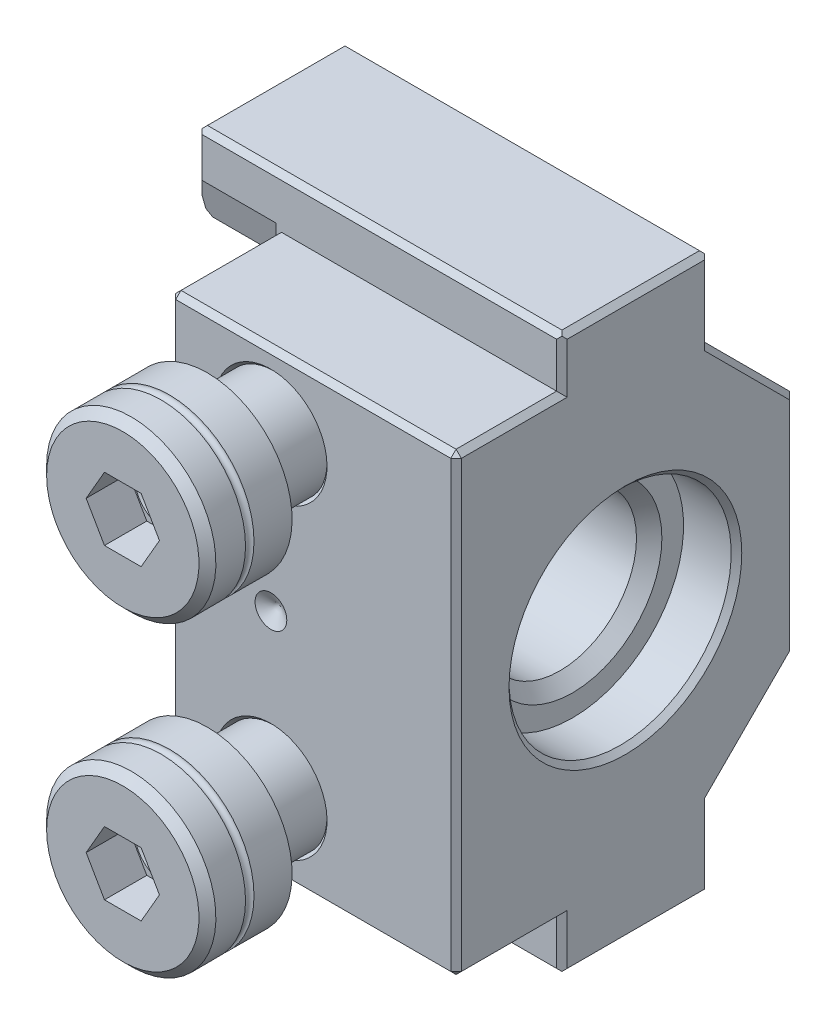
ISO-10303-21;
HEADER;
FILE_DESCRIPTION(('STEP AP214'),'2;1');
FILE_NAME('part.step','',(''),(''),'','','');
FILE_SCHEMA(('AUTOMOTIVE_DESIGN { 1 0 10303 214 1 1 1 1 }'));
ENDSEC;
DATA;
#1=APPLICATION_CONTEXT('core data for automotive mechanical design processes');
#2=APPLICATION_PROTOCOL_DEFINITION('international standard','automotive_design',2000,#1);
#3=PRODUCT_CONTEXT('',#1,'mechanical');
#4=PRODUCT('Part','Part','',(#3));
#5=PRODUCT_RELATED_PRODUCT_CATEGORY('part','',(#4));
#6=PRODUCT_DEFINITION_FORMATION('','',#4);
#7=PRODUCT_DEFINITION_CONTEXT('part definition',#1,'design');
#8=PRODUCT_DEFINITION('design','',#6,#7);
#9=PRODUCT_DEFINITION_SHAPE('','',#8);
#10=(LENGTH_UNIT() NAMED_UNIT(*) SI_UNIT(.MILLI.,.METRE.));
#11=(NAMED_UNIT(*) PLANE_ANGLE_UNIT() SI_UNIT($,.RADIAN.));
#12=(NAMED_UNIT(*) SI_UNIT($,.STERADIAN.) SOLID_ANGLE_UNIT());
#13=UNCERTAINTY_MEASURE_WITH_UNIT(LENGTH_MEASURE(1.E-05),#10,'distance_accuracy_value','');
#14=(GEOMETRIC_REPRESENTATION_CONTEXT(3) GLOBAL_UNCERTAINTY_ASSIGNED_CONTEXT((#13)) GLOBAL_UNIT_ASSIGNED_CONTEXT((#10,
#11,#12)) REPRESENTATION_CONTEXT('',''));
#15=CARTESIAN_POINT('',(0.,0.,0.));
#16=DIRECTION('',(0.,0.,1.));
#17=DIRECTION('',(1.,0.,0.));
#18=AXIS2_PLACEMENT_3D('',#15,#16,#17);
#19=CARTESIAN_POINT('',(-17.5,14.5,15.7));
#20=DIRECTION('',(0.,0.,1.));
#21=DIRECTION('',(0.,1.,0.));
#22=AXIS2_PLACEMENT_3D('',#19,#20,#21);
#23=CONICAL_SURFACE('',#22,5.,0.785398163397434);
#24=CARTESIAN_POINT('',(-17.5,14.5,16.));
#25=DIRECTION('',(0.,0.,-1.));
#26=DIRECTION('',(0.,-1.,0.));
#27=AXIS2_PLACEMENT_3D('',#24,#25,#26);
#28=CIRCLE('',#27,5.3);
#29=CARTESIAN_POINT('',(-17.5,9.2,16.));
#30=VERTEX_POINT('',#29);
#31=EDGE_CURVE('E792',#30,#30,#28,.T.);
#32=ORIENTED_EDGE('',*,*,#31,.F.);
#33=EDGE_LOOP('',(#32));
#34=FACE_BOUND('',#33,.T.);
#35=CARTESIAN_POINT('',(-17.5,14.5,15.7));
#36=DIRECTION('',(0.,0.,-1.));
#37=DIRECTION('',(0.,-1.,0.));
#38=AXIS2_PLACEMENT_3D('',#35,#36,#37);
#39=CIRCLE('',#38,5.);
#40=CARTESIAN_POINT('',(-17.5,9.5,15.7));
#41=VERTEX_POINT('',#40);
#42=EDGE_CURVE('E799',#41,#41,#39,.F.);
#43=ORIENTED_EDGE('',*,*,#42,.F.);
#44=EDGE_LOOP('',(#43));
#45=FACE_BOUND('',#44,.T.);
#46=ADVANCED_FACE('F15',(#34,#45),#23,.F.);
#47=CARTESIAN_POINT('',(-27.,21.5,16.));
#48=DIRECTION('',(0.,0.,-1.));
#49=DIRECTION('',(0.,-1.,0.));
#50=AXIS2_PLACEMENT_3D('',#47,#48,#49);
#51=PLANE('',#50);
#52=DIRECTION('',(-1.,0.,0.));
#53=VECTOR('',#52,1.);
#54=CARTESIAN_POINT('',(-27.,21.,16.));
#55=LINE('',#54,#53);
#56=CARTESIAN_POINT('',(-0.5,21.,16.));
#57=VERTEX_POINT('',#56);
#58=CARTESIAN_POINT('',(-26.5,21.,16.));
#59=VERTEX_POINT('',#58);
#60=EDGE_CURVE('E436',#57,#59,#55,.T.);
#61=ORIENTED_EDGE('',*,*,#60,.T.);
#62=DIRECTION('',(0.,-1.,0.));
#63=VECTOR('',#62,1.);
#64=CARTESIAN_POINT('',(-26.5,-21.5,16.));
#65=LINE('',#64,#63);
#66=CARTESIAN_POINT('',(-26.5,-21.,16.));
#67=VERTEX_POINT('',#66);
#68=EDGE_CURVE('E440',#59,#67,#65,.T.);
#69=ORIENTED_EDGE('',*,*,#68,.T.);
#70=DIRECTION('',(1.,0.,0.));
#71=VECTOR('',#70,1.);
#72=CARTESIAN_POINT('',(-27.,-21.,16.));
#73=LINE('',#72,#71);
#74=CARTESIAN_POINT('',(-0.5,-21.,16.));
#75=VERTEX_POINT('',#74);
#76=EDGE_CURVE('E438',#67,#75,#73,.T.);
#77=ORIENTED_EDGE('',*,*,#76,.T.);
#78=DIRECTION('',(0.,1.,0.));
#79=VECTOR('',#78,1.);
#80=CARTESIAN_POINT('',(-0.5,21.5,16.));
#81=LINE('',#80,#79);
#82=EDGE_CURVE('E434',#75,#57,#81,.T.);
#83=ORIENTED_EDGE('',*,*,#82,.T.);
#84=EDGE_LOOP('',(#61,#69,#77,#83));
#85=FACE_BOUND('',#84,.T.);
#86=CARTESIAN_POINT('',(-17.5,-14.5,16.));
#87=DIRECTION('',(0.,0.,-1.));
#88=DIRECTION('',(0.,-1.,0.));
#89=AXIS2_PLACEMENT_3D('',#86,#87,#88);
#90=CIRCLE('',#89,5.3);
#91=CARTESIAN_POINT('',(-17.5,-19.8,16.));
#92=VERTEX_POINT('',#91);
#93=EDGE_CURVE('E795',#92,#92,#90,.T.);
#94=ORIENTED_EDGE('',*,*,#93,.T.);
#95=EDGE_LOOP('',(#94));
#96=FACE_BOUND('',#95,.T.);
#97=ORIENTED_EDGE('',*,*,#31,.T.);
#98=EDGE_LOOP('',(#97));
#99=FACE_BOUND('',#98,.T.);
#100=CARTESIAN_POINT('',(-17.5,0.,16.));
#101=DIRECTION('',(0.,0.,1.));
#102=DIRECTION('',(1.,0.,0.));
#103=AXIS2_PLACEMENT_3D('',#100,#101,#102);
#104=CIRCLE('',#103,1.5);
#105=CARTESIAN_POINT('',(-16.,0.,16.));
#106=VERTEX_POINT('',#105);
#107=EDGE_CURVE('E675',#106,#106,#104,.T.);
#108=ORIENTED_EDGE('',*,*,#107,.F.);
#109=EDGE_LOOP('',(#108));
#110=FACE_BOUND('',#109,.T.);
#111=ADVANCED_FACE('F922',(#85,#96,#99,#110),#51,.F.);
#112=CARTESIAN_POINT('',(-27.,21.5,15.5));
#113=DIRECTION('',(0.,-0.707106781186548,-0.707106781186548));
#114=DIRECTION('',(0.,-0.707106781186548,0.707106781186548));
#115=AXIS2_PLACEMENT_3D('',#112,#113,#114);
#116=PLANE('',#115);
#117=DIRECTION('',(0.,-0.707106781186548,0.707106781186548));
#118=VECTOR('',#117,1.);
#119=CARTESIAN_POINT('',(-26.5,21.5,15.5));
#120=LINE('',#119,#118);
#121=CARTESIAN_POINT('',(-26.5,21.5,15.5));
#122=VERTEX_POINT('',#121);
#123=EDGE_CURVE('E478',#122,#59,#120,.T.);
#124=ORIENTED_EDGE('',*,*,#123,.T.);
#125=ORIENTED_EDGE('',*,*,#60,.F.);
#126=DIRECTION('',(0.,0.707106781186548,-0.707106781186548));
#127=VECTOR('',#126,1.);
#128=CARTESIAN_POINT('',(-0.5,21.5,15.5));
#129=LINE('',#128,#127);
#130=CARTESIAN_POINT('',(-0.5,21.5,15.5));
#131=VERTEX_POINT('',#130);
#132=EDGE_CURVE('E472',#131,#57,#129,.F.);
#133=ORIENTED_EDGE('',*,*,#132,.F.);
#134=DIRECTION('',(1.,0.,0.));
#135=VECTOR('',#134,1.);
#136=CARTESIAN_POINT('',(-27.,21.5,15.5));
#137=LINE('',#136,#135);
#138=EDGE_CURVE('E430',#122,#131,#137,.T.);
#139=ORIENTED_EDGE('',*,*,#138,.F.);
#140=EDGE_LOOP('',(#124,#125,#133,#139));
#141=FACE_BOUND('',#140,.T.);
#142=ADVANCED_FACE('F929',(#141),#116,.F.);
#143=CARTESIAN_POINT('',(-27.,-21.5,15.5));
#144=DIRECTION('',(-0.707106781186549,0.,0.707106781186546));
#145=DIRECTION('',(0.707106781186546,0.,0.707106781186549));
#146=AXIS2_PLACEMENT_3D('',#143,#144,#145);
#147=PLANE('',#146);
#148=DIRECTION('',(-0.707106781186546,0.,-0.707106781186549));
#149=VECTOR('',#148,1.);
#150=CARTESIAN_POINT('',(-27.,-21.,15.5));
#151=LINE('',#150,#149);
#152=CARTESIAN_POINT('',(-27.,-21.,15.5));
#153=VERTEX_POINT('',#152);
#154=EDGE_CURVE('E496',#153,#67,#151,.F.);
#155=ORIENTED_EDGE('',*,*,#154,.T.);
#156=ORIENTED_EDGE('',*,*,#68,.F.);
#157=DIRECTION('',(0.707106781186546,0.,0.707106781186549));
#158=VECTOR('',#157,1.);
#159=CARTESIAN_POINT('',(-26.75,21.,15.75));
#160=LINE('',#159,#158);
#161=CARTESIAN_POINT('',(-27.,21.,15.5));
#162=VERTEX_POINT('',#161);
#163=EDGE_CURVE('E487',#162,#59,#160,.T.);
#164=ORIENTED_EDGE('',*,*,#163,.F.);
#165=DIRECTION('',(0.,1.,0.));
#166=VECTOR('',#165,1.);
#167=CARTESIAN_POINT('',(-27.,21.5,15.5));
#168=LINE('',#167,#166);
#169=EDGE_CURVE('E836',#153,#162,#168,.T.);
#170=ORIENTED_EDGE('',*,*,#169,.F.);
#171=EDGE_LOOP('',(#155,#156,#164,#170));
#172=FACE_BOUND('',#171,.T.);
#173=ADVANCED_FACE('F919',(#172),#147,.T.);
#174=CARTESIAN_POINT('',(-27.,-21.,16.));
#175=DIRECTION('',(0.,0.707106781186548,-0.707106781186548));
#176=DIRECTION('',(0.,-0.707106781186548,-0.707106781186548));
#177=AXIS2_PLACEMENT_3D('',#174,#175,#176);
#178=PLANE('',#177);
#179=DIRECTION('',(0.,-0.707106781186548,-0.707106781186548));
#180=VECTOR('',#179,1.);
#181=CARTESIAN_POINT('',(-26.5,-21.25,15.75));
#182=LINE('',#181,#180);
#183=CARTESIAN_POINT('',(-26.5,-21.5,15.5));
#184=VERTEX_POINT('',#183);
#185=EDGE_CURVE('E499',#67,#184,#182,.T.);
#186=ORIENTED_EDGE('',*,*,#185,.T.);
#187=DIRECTION('',(-1.,0.,0.));
#188=VECTOR('',#187,1.);
#189=CARTESIAN_POINT('',(-27.,-21.5,15.5));
#190=LINE('',#189,#188);
#191=CARTESIAN_POINT('',(-0.5,-21.5,15.5));
#192=VERTEX_POINT('',#191);
#193=EDGE_CURVE('E844',#192,#184,#190,.T.);
#194=ORIENTED_EDGE('',*,*,#193,.F.);
#195=DIRECTION('',(0.,0.707106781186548,0.707106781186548));
#196=VECTOR('',#195,1.);
#197=CARTESIAN_POINT('',(-0.5,-21.,16.));
#198=LINE('',#197,#196);
#199=EDGE_CURVE('E490',#75,#192,#198,.F.);
#200=ORIENTED_EDGE('',*,*,#199,.F.);
#201=ORIENTED_EDGE('',*,*,#76,.F.);
#202=EDGE_LOOP('',(#186,#194,#200,#201));
#203=FACE_BOUND('',#202,.T.);
#204=ADVANCED_FACE('F912',(#203),#178,.F.);
#205=CARTESIAN_POINT('',(-0.5,21.5,16.));
#206=DIRECTION('',(-0.707106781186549,0.,-0.707106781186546));
#207=DIRECTION('',(-0.707106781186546,0.,0.707106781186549));
#208=AXIS2_PLACEMENT_3D('',#205,#206,#207);
#209=PLANE('',#208);
#210=DIRECTION('',(0.707106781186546,0.,-0.707106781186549));
#211=VECTOR('',#210,1.);
#212=CARTESIAN_POINT('',(-0.5,-21.,16.));
#213=LINE('',#212,#211);
#214=CARTESIAN_POINT('',(0.,-21.,15.5));
#215=VERTEX_POINT('',#214);
#216=EDGE_CURVE('E481',#75,#215,#213,.T.);
#217=ORIENTED_EDGE('',*,*,#216,.T.);
#218=DIRECTION('',(0.,-1.,0.));
#219=VECTOR('',#218,1.);
#220=CARTESIAN_POINT('',(0.,-21.5,15.5));
#221=LINE('',#220,#219);
#222=CARTESIAN_POINT('',(0.,21.,15.5));
#223=VERTEX_POINT('',#222);
#224=EDGE_CURVE('E824',#223,#215,#221,.T.);
#225=ORIENTED_EDGE('',*,*,#224,.F.);
#226=DIRECTION('',(-0.707106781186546,0.,0.707106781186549));
#227=VECTOR('',#226,1.);
#228=CARTESIAN_POINT('',(-0.25,21.,15.75));
#229=LINE('',#228,#227);
#230=EDGE_CURVE('E475',#57,#223,#229,.F.);
#231=ORIENTED_EDGE('',*,*,#230,.F.);
#232=ORIENTED_EDGE('',*,*,#82,.F.);
#233=EDGE_LOOP('',(#217,#225,#231,#232));
#234=FACE_BOUND('',#233,.T.);
#235=ADVANCED_FACE('F935',(#234),#209,.F.);
#236=CARTESIAN_POINT('',(-17.5,-14.5,15.7));
#237=DIRECTION('',(0.,0.,1.));
#238=DIRECTION('',(0.,1.,0.));
#239=AXIS2_PLACEMENT_3D('',#236,#237,#238);
#240=CONICAL_SURFACE('',#239,5.,0.785398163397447);
#241=ORIENTED_EDGE('',*,*,#93,.F.);
#242=EDGE_LOOP('',(#241));
#243=FACE_BOUND('',#242,.T.);
#244=CARTESIAN_POINT('',(-17.5,-14.5,15.7));
#245=DIRECTION('',(0.,0.,1.));
#246=DIRECTION('',(0.,-1.,0.));
#247=AXIS2_PLACEMENT_3D('',#244,#245,#246);
#248=CIRCLE('',#247,5.);
#249=CARTESIAN_POINT('',(-17.5,-19.5,15.7));
#250=VERTEX_POINT('',#249);
#251=EDGE_CURVE('E1220',#250,#250,#248,.F.);
#252=ORIENTED_EDGE('',*,*,#251,.T.);
#253=EDGE_LOOP('',(#252));
#254=FACE_BOUND('',#253,.T.);
#255=ADVANCED_FACE('F1300',(#243,#254),#240,.F.);
#256=CARTESIAN_POINT('',(-17.5,0.,15.1339745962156));
#257=DIRECTION('',(0.,0.,1.));
#258=DIRECTION('',(1.,0.,0.));
#259=AXIS2_PLACEMENT_3D('',#256,#257,#258);
#260=CONICAL_SURFACE('',#259,0.,1.04719755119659);
#261=ORIENTED_EDGE('',*,*,#107,.T.);
#262=EDGE_LOOP('',(#261));
#263=FACE_BOUND('',#262,.T.);
#264=CARTESIAN_POINT('',(-17.5,0.,15.1339745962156));
#265=VERTEX_POINT('',#264);
#266=VERTEX_LOOP('',#265);
#267=FACE_BOUND('',#266,.T.);
#268=ADVANCED_FACE('F1296',(#263,#267),#260,.F.);
#269=CARTESIAN_POINT('',(-26.5,21.5,15.5));
#270=DIRECTION('',(-0.577350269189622,0.577350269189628,0.577350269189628));
#271=DIRECTION('',(0.,0.707106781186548,-0.707106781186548));
#272=AXIS2_PLACEMENT_3D('',#269,#270,#271);
#273=PLANE('',#272);
#274=DIRECTION('',(-0.707106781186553,-0.707106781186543,0.));
#275=VECTOR('',#274,1.);
#276=CARTESIAN_POINT('',(-26.5,21.5,15.5));
#277=LINE('',#276,#275);
#278=EDGE_CURVE('E484',#122,#162,#277,.T.);
#279=ORIENTED_EDGE('',*,*,#278,.T.);
#280=ORIENTED_EDGE('',*,*,#163,.T.);
#281=ORIENTED_EDGE('',*,*,#123,.F.);
#282=EDGE_LOOP('',(#279,#280,#281));
#283=FACE_BOUND('',#282,.T.);
#284=ADVANCED_FACE('F1299',(#283),#273,.T.);
#285=CARTESIAN_POINT('',(-0.5,21.5,15.5));
#286=DIRECTION('',(0.577350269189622,0.577350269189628,0.577350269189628));
#287=DIRECTION('',(0.,0.707106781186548,-0.707106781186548));
#288=AXIS2_PLACEMENT_3D('',#285,#286,#287);
#289=PLANE('',#288);
#290=ORIENTED_EDGE('',*,*,#132,.T.);
#291=ORIENTED_EDGE('',*,*,#230,.T.);
#292=DIRECTION('',(0.707106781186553,-0.707106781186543,0.));
#293=VECTOR('',#292,1.);
#294=CARTESIAN_POINT('',(-0.5,21.5,15.5));
#295=LINE('',#294,#293);
#296=EDGE_CURVE('E469',#131,#223,#295,.T.);
#297=ORIENTED_EDGE('',*,*,#296,.F.);
#298=EDGE_LOOP('',(#290,#291,#297));
#299=FACE_BOUND('',#298,.T.);
#300=ADVANCED_FACE('F937',(#299),#289,.T.);
#301=CARTESIAN_POINT('',(-27.,21.5,16.));
#302=DIRECTION('',(0.,-1.,0.));
#303=DIRECTION('',(0.,0.,1.));
#304=AXIS2_PLACEMENT_3D('',#301,#302,#303);
#305=PLANE('',#304);
#306=DIRECTION('',(1.,0.,0.));
#307=VECTOR('',#306,1.);
#308=CARTESIAN_POINT('',(-27.,21.5,6.));
#309=LINE('',#308,#307);
#310=CARTESIAN_POINT('',(-26.5,21.5,6.));
#311=VERTEX_POINT('',#310);
#312=CARTESIAN_POINT('',(-0.5,21.5,6.));
#313=VERTEX_POINT('',#312);
#314=EDGE_CURVE('E416',#311,#313,#309,.T.);
#315=ORIENTED_EDGE('',*,*,#314,.F.);
#316=DIRECTION('',(0.,0.,1.));
#317=VECTOR('',#316,1.);
#318=CARTESIAN_POINT('',(-26.5,21.5,16.));
#319=LINE('',#318,#317);
#320=EDGE_CURVE('E432',#311,#122,#319,.T.);
#321=ORIENTED_EDGE('',*,*,#320,.T.);
#322=ORIENTED_EDGE('',*,*,#138,.T.);
#323=DIRECTION('',(0.,0.,-1.));
#324=VECTOR('',#323,1.);
#325=CARTESIAN_POINT('',(-0.5,21.5,16.));
#326=LINE('',#325,#324);
#327=EDGE_CURVE('E428',#131,#313,#326,.T.);
#328=ORIENTED_EDGE('',*,*,#327,.T.);
#329=EDGE_LOOP('',(#315,#321,#322,#328));
#330=FACE_BOUND('',#329,.T.);
#331=ADVANCED_FACE('F945',(#330),#305,.F.);
#332=CARTESIAN_POINT('',(-27.,-21.,15.5));
#333=DIRECTION('',(-0.577350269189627,-0.577350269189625,0.577350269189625));
#334=DIRECTION('',(0.707106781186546,-0.707106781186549,0.));
#335=AXIS2_PLACEMENT_3D('',#332,#333,#334);
#336=PLANE('',#335);
#337=ORIENTED_EDGE('',*,*,#154,.F.);
#338=DIRECTION('',(0.707106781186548,-0.707106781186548,0.));
#339=VECTOR('',#338,1.);
#340=CARTESIAN_POINT('',(-27.,-21.,15.5));
#341=LINE('',#340,#339);
#342=EDGE_CURVE('E505',#153,#184,#341,.T.);
#343=ORIENTED_EDGE('',*,*,#342,.T.);
#344=ORIENTED_EDGE('',*,*,#185,.F.);
#345=EDGE_LOOP('',(#337,#343,#344));
#346=FACE_BOUND('',#345,.T.);
#347=ADVANCED_FACE('F916',(#346),#336,.T.);
#348=CARTESIAN_POINT('',(-27.,-21.5,-16.));
#349=DIRECTION('',(-1.,0.,0.));
#350=DIRECTION('',(0.,-1.,0.));
#351=AXIS2_PLACEMENT_3D('',#348,#349,#350);
#352=PLANE('',#351);
#353=DIRECTION('',(0.,0.,-1.));
#354=VECTOR('',#353,1.);
#355=CARTESIAN_POINT('',(-27.,21.,6.));
#356=LINE('',#355,#354);
#357=CARTESIAN_POINT('',(-27.,21.,6.));
#358=VERTEX_POINT('',#357);
#359=EDGE_CURVE('E697',#162,#358,#356,.T.);
#360=ORIENTED_EDGE('',*,*,#359,.T.);
#361=DIRECTION('',(0.,1.,0.));
#362=VECTOR('',#361,1.);
#363=CARTESIAN_POINT('',(-27.,18.5,6.));
#364=LINE('',#363,#362);
#365=CARTESIAN_POINT('',(-27.,22.,6.));
#366=VERTEX_POINT('',#365);
#367=EDGE_CURVE('E629',#358,#366,#364,.T.);
#368=ORIENTED_EDGE('',*,*,#367,.T.);
#369=DIRECTION('',(0.,-0.961261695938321,-0.275637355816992));
#370=VECTOR('',#369,1.);
#371=CARTESIAN_POINT('',(-27.,22.,6.));
#372=LINE('',#371,#370);
#373=CARTESIAN_POINT('',(-27.,18.5,4.9963911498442));
#374=VERTEX_POINT('',#373);
#375=EDGE_CURVE('E631',#366,#374,#372,.T.);
#376=ORIENTED_EDGE('',*,*,#375,.T.);
#377=DIRECTION('',(0.,0.,1.));
#378=VECTOR('',#377,1.);
#379=CARTESIAN_POINT('',(-27.,18.5,6.));
#380=LINE('',#379,#378);
#381=CARTESIAN_POINT('',(-27.,18.5,-7.5));
#382=VERTEX_POINT('',#381);
#383=EDGE_CURVE('E685',#382,#374,#380,.T.);
#384=ORIENTED_EDGE('',*,*,#383,.F.);
#385=DIRECTION('',(0.,-0.707106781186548,0.707106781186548));
#386=VECTOR('',#385,1.);
#387=CARTESIAN_POINT('',(-27.,18.5,-7.5));
#388=LINE('',#387,#386);
#389=CARTESIAN_POINT('',(-27.,19.,-8.));
#390=VERTEX_POINT('',#389);
#391=EDGE_CURVE('E387',#382,#390,#388,.F.);
#392=ORIENTED_EDGE('',*,*,#391,.T.);
#393=DIRECTION('',(0.,1.,0.));
#394=VECTOR('',#393,1.);
#395=CARTESIAN_POINT('',(-27.,-21.5,-8.));
#396=LINE('',#395,#394);
#397=CARTESIAN_POINT('',(-27.,18.5,-8.));
#398=VERTEX_POINT('',#397);
#399=EDGE_CURVE('E377',#398,#390,#396,.T.);
#400=ORIENTED_EDGE('',*,*,#399,.F.);
#401=DIRECTION('',(0.,0.707106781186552,0.707106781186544));
#402=VECTOR('',#401,1.);
#403=CARTESIAN_POINT('',(-27.,-5.50000000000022,-32.));
#404=LINE('',#403,#402);
#405=CARTESIAN_POINT('',(-27.,10.5,-16.));
#406=VERTEX_POINT('',#405);
#407=EDGE_CURVE('E384',#406,#398,#404,.T.);
#408=ORIENTED_EDGE('',*,*,#407,.F.);
#409=DIRECTION('',(0.,-1.,0.));
#410=VECTOR('',#409,1.);
#411=CARTESIAN_POINT('',(-27.,21.5,-16.));
#412=LINE('',#411,#410);
#413=CARTESIAN_POINT('',(-27.,-10.5,-16.));
#414=VERTEX_POINT('',#413);
#415=EDGE_CURVE('E724',#406,#414,#412,.T.);
#416=ORIENTED_EDGE('',*,*,#415,.T.);
#417=DIRECTION('',(0.,0.707106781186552,-0.707106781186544));
#418=VECTOR('',#417,1.);
#419=CARTESIAN_POINT('',(-27.,-16.,-10.5));
#420=LINE('',#419,#418);
#421=CARTESIAN_POINT('',(-27.,-18.5,-8.));
#422=VERTEX_POINT('',#421);
#423=EDGE_CURVE('E412',#422,#414,#420,.T.);
#424=ORIENTED_EDGE('',*,*,#423,.F.);
#425=DIRECTION('',(0.,1.,0.));
#426=VECTOR('',#425,1.);
#427=CARTESIAN_POINT('',(-27.,-21.5,-8.));
#428=LINE('',#427,#426);
#429=CARTESIAN_POINT('',(-27.,-19.,-8.));
#430=VERTEX_POINT('',#429);
#431=EDGE_CURVE('E555',#430,#422,#428,.T.);
#432=ORIENTED_EDGE('',*,*,#431,.F.);
#433=DIRECTION('',(0.,-0.707106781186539,-0.707106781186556));
#434=VECTOR('',#433,1.);
#435=CARTESIAN_POINT('',(-27.,-19.,-8.));
#436=LINE('',#435,#434);
#437=CARTESIAN_POINT('',(-27.,-18.5,-7.5));
#438=VERTEX_POINT('',#437);
#439=EDGE_CURVE('E597',#430,#438,#436,.F.);
#440=ORIENTED_EDGE('',*,*,#439,.T.);
#441=DIRECTION('',(0.,0.,-1.));
#442=VECTOR('',#441,1.);
#443=CARTESIAN_POINT('',(-27.,-18.5,6.));
#444=LINE('',#443,#442);
#445=CARTESIAN_POINT('',(-27.,-18.5,4.9963911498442));
#446=VERTEX_POINT('',#445);
#447=EDGE_CURVE('E682',#446,#438,#444,.T.);
#448=ORIENTED_EDGE('',*,*,#447,.F.);
#449=DIRECTION('',(0.,-0.961261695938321,0.275637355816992));
#450=VECTOR('',#449,1.);
#451=CARTESIAN_POINT('',(-27.,-22.,6.));
#452=LINE('',#451,#450);
#453=CARTESIAN_POINT('',(-27.,-22.,6.));
#454=VERTEX_POINT('',#453);
#455=EDGE_CURVE('E645',#446,#454,#452,.T.);
#456=ORIENTED_EDGE('',*,*,#455,.T.);
#457=DIRECTION('',(0.,1.,0.));
#458=VECTOR('',#457,1.);
#459=CARTESIAN_POINT('',(-27.,-18.5,6.));
#460=LINE('',#459,#458);
#461=CARTESIAN_POINT('',(-27.,-21.,6.));
#462=VERTEX_POINT('',#461);
#463=EDGE_CURVE('E643',#454,#462,#460,.T.);
#464=ORIENTED_EDGE('',*,*,#463,.T.);
#465=DIRECTION('',(0.,0.,1.));
#466=VECTOR('',#465,1.);
#467=CARTESIAN_POINT('',(-27.,-21.,16.));
#468=LINE('',#467,#466);
#469=EDGE_CURVE('E839',#462,#153,#468,.T.);
#470=ORIENTED_EDGE('',*,*,#469,.T.);
#471=ORIENTED_EDGE('',*,*,#169,.T.);
#472=EDGE_LOOP('',(#360,#368,#376,#384,#392,#400,#408,#416,#424,#432,#440,#448,#456,#464,#470,#471));
#473=FACE_BOUND('',#472,.T.);
#474=CARTESIAN_POINT('',(-27.,0.,0.));
#475=DIRECTION('',(-1.,0.,0.));
#476=DIRECTION('',(0.,-1.,0.));
#477=AXIS2_PLACEMENT_3D('',#474,#475,#476);
#478=CIRCLE('',#477,13.5);
#479=CARTESIAN_POINT('',(-27.,-13.5,0.));
#480=VERTEX_POINT('',#479);
#481=EDGE_CURVE('E798',#480,#480,#478,.F.);
#482=ORIENTED_EDGE('',*,*,#481,.T.);
#483=EDGE_LOOP('',(#482));
#484=FACE_BOUND('',#483,.T.);
#485=ADVANCED_FACE('F380',(#473,#484),#352,.T.);
#486=CARTESIAN_POINT('',(-27.,-21.5,16.));
#487=DIRECTION('',(0.,1.,0.));
#488=DIRECTION('',(0.,0.,-1.));
#489=AXIS2_PLACEMENT_3D('',#486,#487,#488);
#490=PLANE('',#489);
#491=ORIENTED_EDGE('',*,*,#193,.T.);
#492=DIRECTION('',(0.,0.,-1.));
#493=VECTOR('',#492,1.);
#494=CARTESIAN_POINT('',(-26.5,-21.5,6.));
#495=LINE('',#494,#493);
#496=CARTESIAN_POINT('',(-26.5,-21.5,6.));
#497=VERTEX_POINT('',#496);
#498=EDGE_CURVE('E426',#184,#497,#495,.T.);
#499=ORIENTED_EDGE('',*,*,#498,.T.);
#500=DIRECTION('',(1.,0.,0.));
#501=VECTOR('',#500,1.);
#502=CARTESIAN_POINT('',(-27.,-21.5,6.));
#503=LINE('',#502,#501);
#504=CARTESIAN_POINT('',(-0.5,-21.5,6.));
#505=VERTEX_POINT('',#504);
#506=EDGE_CURVE('E425',#497,#505,#503,.T.);
#507=ORIENTED_EDGE('',*,*,#506,.T.);
#508=DIRECTION('',(0.,0.,1.));
#509=VECTOR('',#508,1.);
#510=CARTESIAN_POINT('',(-0.5,-21.5,16.));
#511=LINE('',#510,#509);
#512=EDGE_CURVE('E841',#505,#192,#511,.T.);
#513=ORIENTED_EDGE('',*,*,#512,.T.);
#514=EDGE_LOOP('',(#491,#499,#507,#513));
#515=FACE_BOUND('',#514,.T.);
#516=ADVANCED_FACE('F849',(#515),#490,.F.);
#517=CARTESIAN_POINT('',(-0.5,-21.,16.));
#518=DIRECTION('',(0.577350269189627,-0.577350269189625,0.577350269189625));
#519=DIRECTION('',(0.707106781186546,0.707106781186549,0.));
#520=AXIS2_PLACEMENT_3D('',#517,#518,#519);
#521=PLANE('',#520);
#522=ORIENTED_EDGE('',*,*,#199,.T.);
#523=DIRECTION('',(-0.707106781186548,-0.707106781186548,0.));
#524=VECTOR('',#523,1.);
#525=CARTESIAN_POINT('',(-0.25,-21.25,15.5));
#526=LINE('',#525,#524);
#527=EDGE_CURVE('E493',#192,#215,#526,.F.);
#528=ORIENTED_EDGE('',*,*,#527,.T.);
#529=ORIENTED_EDGE('',*,*,#216,.F.);
#530=EDGE_LOOP('',(#522,#528,#529));
#531=FACE_BOUND('',#530,.T.);
#532=ADVANCED_FACE('F1341',(#531),#521,.T.);
#533=CARTESIAN_POINT('',(0.,-21.5,-16.));
#534=DIRECTION('',(-1.,0.,0.));
#535=DIRECTION('',(0.,-1.,0.));
#536=AXIS2_PLACEMENT_3D('',#533,#534,#535);
#537=PLANE('',#536);
#538=CARTESIAN_POINT('',(0.,0.,0.));
#539=DIRECTION('',(-1.,0.,0.));
#540=DIRECTION('',(0.,-1.,0.));
#541=AXIS2_PLACEMENT_3D('',#538,#539,#540);
#542=CIRCLE('',#541,11.);
#543=CARTESIAN_POINT('',(0.,-11.,0.));
#544=VERTEX_POINT('',#543);
#545=EDGE_CURVE('E789',#544,#544,#542,.T.);
#546=ORIENTED_EDGE('',*,*,#545,.T.);
#547=EDGE_LOOP('',(#546));
#548=FACE_BOUND('',#547,.T.);
#549=DIRECTION('',(0.,0.707106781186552,0.707106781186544));
#550=VECTOR('',#549,1.);
#551=CARTESIAN_POINT('',(0.,-5.85355339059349,-31.6464466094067));
#552=LINE('',#551,#550);
#553=CARTESIAN_POINT('',(0.,10.2928932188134,-15.5));
#554=VERTEX_POINT('',#553);
#555=CARTESIAN_POINT('',(0.,18.2928932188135,-7.5));
#556=VERTEX_POINT('',#555);
#557=EDGE_CURVE('E580',#554,#556,#552,.T.);
#558=ORIENTED_EDGE('',*,*,#557,.T.);
#559=DIRECTION('',(0.,1.,0.));
#560=VECTOR('',#559,1.);
#561=CARTESIAN_POINT('',(0.,-21.5,-7.5));
#562=LINE('',#561,#560);
#563=CARTESIAN_POINT('',(0.,25.75,-7.5));
#564=VERTEX_POINT('',#563);
#565=EDGE_CURVE('E582',#556,#564,#562,.T.);
#566=ORIENTED_EDGE('',*,*,#565,.T.);
#567=DIRECTION('',(0.,0.,1.));
#568=VECTOR('',#567,1.);
#569=CARTESIAN_POINT('',(0.,25.75,-16.));
#570=LINE('',#569,#568);
#571=CARTESIAN_POINT('',(0.,25.75,5.5));
#572=VERTEX_POINT('',#571);
#573=EDGE_CURVE('E830',#564,#572,#570,.T.);
#574=ORIENTED_EDGE('',*,*,#573,.T.);
#575=DIRECTION('',(0.,-1.,0.));
#576=VECTOR('',#575,1.);
#577=CARTESIAN_POINT('',(0.,-21.5,5.5));
#578=LINE('',#577,#576);
#579=CARTESIAN_POINT('',(0.,21.,5.5));
#580=VERTEX_POINT('',#579);
#581=EDGE_CURVE('E828',#572,#580,#578,.T.);
#582=ORIENTED_EDGE('',*,*,#581,.T.);
#583=DIRECTION('',(0.,0.,1.));
#584=VECTOR('',#583,1.);
#585=CARTESIAN_POINT('',(0.,21.,-16.));
#586=LINE('',#585,#584);
#587=EDGE_CURVE('E826',#580,#223,#586,.T.);
#588=ORIENTED_EDGE('',*,*,#587,.T.);
#589=ORIENTED_EDGE('',*,*,#224,.T.);
#590=DIRECTION('',(0.,0.,-1.));
#591=VECTOR('',#590,1.);
#592=CARTESIAN_POINT('',(0.,-21.,-16.));
#593=LINE('',#592,#591);
#594=CARTESIAN_POINT('',(0.,-21.,5.5));
#595=VERTEX_POINT('',#594);
#596=EDGE_CURVE('E822',#215,#595,#593,.T.);
#597=ORIENTED_EDGE('',*,*,#596,.T.);
#598=DIRECTION('',(0.,-1.,0.));
#599=VECTOR('',#598,1.);
#600=CARTESIAN_POINT('',(0.,-21.5,5.5));
#601=LINE('',#600,#599);
#602=CARTESIAN_POINT('',(0.,-25.75,5.5));
#603=VERTEX_POINT('',#602);
#604=EDGE_CURVE('E820',#595,#603,#601,.T.);
#605=ORIENTED_EDGE('',*,*,#604,.T.);
#606=DIRECTION('',(0.,0.,-1.));
#607=VECTOR('',#606,1.);
#608=CARTESIAN_POINT('',(0.,-25.75,-16.));
#609=LINE('',#608,#607);
#610=CARTESIAN_POINT('',(0.,-25.75,-7.5));
#611=VERTEX_POINT('',#610);
#612=EDGE_CURVE('E817',#603,#611,#609,.T.);
#613=ORIENTED_EDGE('',*,*,#612,.T.);
#614=DIRECTION('',(0.,1.,0.));
#615=VECTOR('',#614,1.);
#616=CARTESIAN_POINT('',(0.,-21.5,-7.5));
#617=LINE('',#616,#615);
#618=CARTESIAN_POINT('',(0.,-18.2928932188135,-7.5));
#619=VERTEX_POINT('',#618);
#620=EDGE_CURVE('E574',#611,#619,#617,.T.);
#621=ORIENTED_EDGE('',*,*,#620,.T.);
#622=DIRECTION('',(0.,0.707106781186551,-0.707106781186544));
#623=VECTOR('',#622,1.);
#624=CARTESIAN_POINT('',(0.,-15.6464466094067,-10.1464466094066));
#625=LINE('',#624,#623);
#626=CARTESIAN_POINT('',(0.,-10.2928932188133,-15.5));
#627=VERTEX_POINT('',#626);
#628=EDGE_CURVE('E576',#619,#627,#625,.T.);
#629=ORIENTED_EDGE('',*,*,#628,.T.);
#630=DIRECTION('',(0.,1.,0.));
#631=VECTOR('',#630,1.);
#632=CARTESIAN_POINT('',(0.,-21.5,-15.5));
#633=LINE('',#632,#631);
#634=EDGE_CURVE('E578',#627,#554,#633,.T.);
#635=ORIENTED_EDGE('',*,*,#634,.T.);
#636=EDGE_LOOP('',(#558,#566,#574,#582,#588,#589,#597,#605,#613,#621,#629,#635));
#637=FACE_BOUND('',#636,.T.);
#638=ADVANCED_FACE('F898',(#548,#637),#537,.F.);
#639=CARTESIAN_POINT('',(-17.5,-14.5,0.));
#640=DIRECTION('',(0.,0.,1.));
#641=DIRECTION('',(0.,1.,0.));
#642=AXIS2_PLACEMENT_3D('',#639,#640,#641);
#643=CYLINDRICAL_SURFACE('',#642,5.);
#644=ORIENTED_EDGE('',*,*,#251,.F.);
#645=EDGE_LOOP('',(#644));
#646=FACE_BOUND('',#645,.T.);
#647=CARTESIAN_POINT('',(-17.5,-14.5,21.36));
#648=DIRECTION('',(0.,0.,1.));
#649=DIRECTION('',(0.,1.,0.));
#650=AXIS2_PLACEMENT_3D('',#647,#648,#649);
#651=CIRCLE('',#650,5.);
#652=CARTESIAN_POINT('',(-17.5,-9.5,21.36));
#653=VERTEX_POINT('',#652);
#654=EDGE_CURVE('E1204',#653,#653,#651,.F.);
#655=ORIENTED_EDGE('',*,*,#654,.T.);
#656=EDGE_LOOP('',(#655));
#657=FACE_BOUND('',#656,.T.);
#658=ADVANCED_FACE('F1061',(#646,#657),#643,.T.);
#659=CARTESIAN_POINT('',(-27.,21.,-16.));
#660=DIRECTION('',(-0.707106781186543,0.707106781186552,0.));
#661=DIRECTION('',(-0.707106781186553,-0.707106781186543,0.));
#662=AXIS2_PLACEMENT_3D('',#659,#660,#661);
#663=PLANE('',#662);
#664=DIRECTION('',(0.707106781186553,0.707106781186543,0.));
#665=VECTOR('',#664,1.);
#666=CARTESIAN_POINT('',(-24.375,23.625,6.));
#667=LINE('',#666,#665);
#668=EDGE_CURVE('E459',#358,#311,#667,.T.);
#669=ORIENTED_EDGE('',*,*,#668,.F.);
#670=ORIENTED_EDGE('',*,*,#359,.F.);
#671=ORIENTED_EDGE('',*,*,#278,.F.);
#672=ORIENTED_EDGE('',*,*,#320,.F.);
#673=EDGE_LOOP('',(#669,#670,#671,#672));
#674=FACE_BOUND('',#673,.T.);
#675=ADVANCED_FACE('F1064',(#674),#663,.T.);
#676=CARTESIAN_POINT('',(-0.5,21.5,16.));
#677=DIRECTION('',(-0.707106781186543,-0.707106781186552,0.));
#678=DIRECTION('',(0.707106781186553,-0.707106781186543,0.));
#679=AXIS2_PLACEMENT_3D('',#676,#677,#678);
#680=PLANE('',#679);
#681=ORIENTED_EDGE('',*,*,#296,.T.);
#682=ORIENTED_EDGE('',*,*,#587,.F.);
#683=DIRECTION('',(-0.577350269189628,0.57735026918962,0.577350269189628));
#684=VECTOR('',#683,1.);
#685=CARTESIAN_POINT('',(-2.08333333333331,23.0833333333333,7.58333333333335));
#686=LINE('',#685,#684);
#687=EDGE_CURVE('E465',#313,#580,#686,.F.);
#688=ORIENTED_EDGE('',*,*,#687,.F.);
#689=ORIENTED_EDGE('',*,*,#327,.F.);
#690=EDGE_LOOP('',(#681,#682,#688,#689));
#691=FACE_BOUND('',#690,.T.);
#692=ADVANCED_FACE('F942',(#691),#680,.F.);
#693=CARTESIAN_POINT('',(-27.,26.25,6.));
#694=DIRECTION('',(0.,0.,-1.));
#695=DIRECTION('',(0.,-1.,0.));
#696=AXIS2_PLACEMENT_3D('',#693,#694,#695);
#697=PLANE('',#696);
#698=DIRECTION('',(-1.,0.,0.));
#699=VECTOR('',#698,1.);
#700=CARTESIAN_POINT('',(-27.,25.75,6.));
#701=LINE('',#700,#699);
#702=CARTESIAN_POINT('',(-0.5,25.75,6.));
#703=VERTEX_POINT('',#702);
#704=CARTESIAN_POINT('',(-34.,25.75,6.));
#705=VERTEX_POINT('',#704);
#706=EDGE_CURVE('E740',#703,#705,#701,.T.);
#707=ORIENTED_EDGE('',*,*,#706,.T.);
#708=DIRECTION('',(0.,-1.,0.));
#709=VECTOR('',#708,1.);
#710=CARTESIAN_POINT('',(-34.,26.25,6.));
#711=LINE('',#710,#709);
#712=CARTESIAN_POINT('',(-34.,22.,6.));
#713=VERTEX_POINT('',#712);
#714=EDGE_CURVE('E551',#705,#713,#711,.T.);
#715=ORIENTED_EDGE('',*,*,#714,.T.);
#716=DIRECTION('',(-1.,0.,0.));
#717=VECTOR('',#716,1.);
#718=CARTESIAN_POINT('',(-27.,22.,6.));
#719=LINE('',#718,#717);
#720=EDGE_CURVE('E634',#366,#713,#719,.T.);
#721=ORIENTED_EDGE('',*,*,#720,.F.);
#722=ORIENTED_EDGE('',*,*,#367,.F.);
#723=ORIENTED_EDGE('',*,*,#668,.T.);
#724=ORIENTED_EDGE('',*,*,#314,.T.);
#725=DIRECTION('',(0.,1.,0.));
#726=VECTOR('',#725,1.);
#727=CARTESIAN_POINT('',(-0.5,26.25,6.));
#728=LINE('',#727,#726);
#729=EDGE_CURVE('E443',#313,#703,#728,.T.);
#730=ORIENTED_EDGE('',*,*,#729,.T.);
#731=EDGE_LOOP('',(#707,#715,#721,#722,#723,#724,#730));
#732=FACE_BOUND('',#731,.T.);
#733=ADVANCED_FACE('F701',(#732),#697,.F.);
#734=CARTESIAN_POINT('',(-27.,-21.,-16.));
#735=DIRECTION('',(-0.707106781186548,-0.707106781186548,0.));
#736=DIRECTION('',(0.707106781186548,-0.707106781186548,0.));
#737=AXIS2_PLACEMENT_3D('',#734,#735,#736);
#738=PLANE('',#737);
#739=DIRECTION('',(-0.707106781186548,0.707106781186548,0.));
#740=VECTOR('',#739,1.);
#741=CARTESIAN_POINT('',(-24.375,-23.625,6.));
#742=LINE('',#741,#740);
#743=EDGE_CURVE('E456',#497,#462,#742,.T.);
#744=ORIENTED_EDGE('',*,*,#743,.F.);
#745=ORIENTED_EDGE('',*,*,#498,.F.);
#746=ORIENTED_EDGE('',*,*,#342,.F.);
#747=ORIENTED_EDGE('',*,*,#469,.F.);
#748=EDGE_LOOP('',(#744,#745,#746,#747));
#749=FACE_BOUND('',#748,.T.);
#750=ADVANCED_FACE('F859',(#749),#738,.T.);
#751=CARTESIAN_POINT('',(-27.,22.,6.));
#752=DIRECTION('',(0.,0.275637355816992,-0.961261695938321));
#753=DIRECTION('',(0.,-0.961261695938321,-0.275637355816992));
#754=AXIS2_PLACEMENT_3D('',#751,#752,#753);
#755=PLANE('',#754);
#756=DIRECTION('',(0.,-0.961261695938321,-0.275637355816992));
#757=VECTOR('',#756,1.);
#758=CARTESIAN_POINT('',(-34.5,22.,6.));
#759=LINE('',#758,#757);
#760=CARTESIAN_POINT('',(-34.5,20.2562927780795,5.5));
#761=VERTEX_POINT('',#760);
#762=CARTESIAN_POINT('',(-34.5,19.,5.1397638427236));
#763=VERTEX_POINT('',#762);
#764=EDGE_CURVE('E612',#761,#763,#759,.T.);
#765=ORIENTED_EDGE('',*,*,#764,.T.);
#766=DIRECTION('',(-0.693005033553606,0.693005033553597,0.198715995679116));
#767=VECTOR('',#766,1.);
#768=CARTESIAN_POINT('',(-34.6184641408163,19.1184641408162,5.17373288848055));
#769=LINE('',#768,#767);
#770=CARTESIAN_POINT('',(-34.,18.5,4.9963911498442));
#771=VERTEX_POINT('',#770);
#772=EDGE_CURVE('E540',#763,#771,#769,.F.);
#773=ORIENTED_EDGE('',*,*,#772,.T.);
#774=DIRECTION('',(-1.,0.,0.));
#775=VECTOR('',#774,1.);
#776=CARTESIAN_POINT('',(-27.,18.5,4.9963911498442));
#777=LINE('',#776,#775);
#778=EDGE_CURVE('E637',#374,#771,#777,.T.);
#779=ORIENTED_EDGE('',*,*,#778,.F.);
#780=ORIENTED_EDGE('',*,*,#375,.F.);
#781=ORIENTED_EDGE('',*,*,#720,.T.);
#782=DIRECTION('',(0.265727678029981,0.926702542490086,0.265727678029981));
#783=VECTOR('',#782,1.);
#784=CARTESIAN_POINT('',(-33.0240465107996,25.4035542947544,6.9759534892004));
#785=LINE('',#784,#783);
#786=EDGE_CURVE('E538',#713,#761,#785,.F.);
#787=ORIENTED_EDGE('',*,*,#786,.T.);
#788=EDGE_LOOP('',(#765,#773,#779,#780,#781,#787));
#789=FACE_BOUND('',#788,.T.);
#790=ADVANCED_FACE('F694',(#789),#755,.F.);
#791=CARTESIAN_POINT('',(-34.5,18.5,6.));
#792=DIRECTION('',(0.,1.,0.));
#793=DIRECTION('',(0.,0.,-1.));
#794=AXIS2_PLACEMENT_3D('',#791,#792,#793);
#795=PLANE('',#794);
#796=DIRECTION('',(0.,0.,-1.));
#797=VECTOR('',#796,1.);
#798=CARTESIAN_POINT('',(-34.,18.5,6.));
#799=LINE('',#798,#797);
#800=CARTESIAN_POINT('',(-34.,18.5,-7.5));
#801=VERTEX_POINT('',#800);
#802=EDGE_CURVE('E542',#771,#801,#799,.T.);
#803=ORIENTED_EDGE('',*,*,#802,.T.);
#804=DIRECTION('',(1.,0.,0.));
#805=VECTOR('',#804,1.);
#806=CARTESIAN_POINT('',(-34.5,18.5,-7.5));
#807=LINE('',#806,#805);
#808=EDGE_CURVE('E566',#801,#382,#807,.T.);
#809=ORIENTED_EDGE('',*,*,#808,.T.);
#810=ORIENTED_EDGE('',*,*,#383,.T.);
#811=ORIENTED_EDGE('',*,*,#778,.T.);
#812=EDGE_LOOP('',(#803,#809,#810,#811));
#813=FACE_BOUND('',#812,.T.);
#814=ADVANCED_FACE('F689',(#813),#795,.F.);
#815=CARTESIAN_POINT('',(-34.5,18.5,-7.5));
#816=DIRECTION('',(0.,0.707106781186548,0.707106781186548));
#817=DIRECTION('',(0.,0.707106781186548,-0.707106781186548));
#818=AXIS2_PLACEMENT_3D('',#815,#816,#817);
#819=PLANE('',#818);
#820=DIRECTION('',(-0.577350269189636,-0.57735026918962,0.577350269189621));
#821=VECTOR('',#820,1.);
#822=CARTESIAN_POINT('',(-31.9166666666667,21.0833333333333,-10.0833333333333));
#823=LINE('',#822,#821);
#824=CARTESIAN_POINT('',(-34.,19.,-8.));
#825=VERTEX_POINT('',#824);
#826=CARTESIAN_POINT('',(-34.25,18.75,-7.75));
#827=VERTEX_POINT('',#826);
#828=EDGE_CURVE('E390',#825,#827,#823,.T.);
#829=ORIENTED_EDGE('',*,*,#828,.F.);
#830=DIRECTION('',(-1.,0.,0.));
#831=VECTOR('',#830,1.);
#832=CARTESIAN_POINT('',(-27.,19.,-8.));
#833=LINE('',#832,#831);
#834=EDGE_CURVE('E391',#390,#825,#833,.T.);
#835=ORIENTED_EDGE('',*,*,#834,.F.);
#836=ORIENTED_EDGE('',*,*,#391,.F.);
#837=ORIENTED_EDGE('',*,*,#808,.F.);
#838=DIRECTION('',(0.577350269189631,-0.577350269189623,0.577350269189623));
#839=VECTOR('',#838,1.);
#840=CARTESIAN_POINT('',(-29.8333333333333,14.3333333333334,-3.33333333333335));
#841=LINE('',#840,#839);
#842=EDGE_CURVE('E572',#827,#801,#841,.T.);
#843=ORIENTED_EDGE('',*,*,#842,.F.);
#844=EDGE_LOOP('',(#829,#835,#836,#837,#843));
#845=FACE_BOUND('',#844,.T.);
#846=ADVANCED_FACE('F981',(#845),#819,.F.);
#847=CARTESIAN_POINT('',(-27.,26.25,-8.));
#848=DIRECTION('',(0.,0.,1.));
#849=DIRECTION('',(0.,1.,0.));
#850=AXIS2_PLACEMENT_3D('',#847,#848,#849);
#851=PLANE('',#850);
#852=DIRECTION('',(-1.,0.,0.));
#853=VECTOR('',#852,1.);
#854=CARTESIAN_POINT('',(11.5,18.5,-8.));
#855=LINE('',#854,#853);
#856=CARTESIAN_POINT('',(-0.5,18.5,-8.));
#857=VERTEX_POINT('',#856);
#858=EDGE_CURVE('E395',#857,#398,#855,.T.);
#859=ORIENTED_EDGE('',*,*,#858,.T.);
#860=ORIENTED_EDGE('',*,*,#399,.T.);
#861=ORIENTED_EDGE('',*,*,#834,.T.);
#862=DIRECTION('',(0.,1.,0.));
#863=VECTOR('',#862,1.);
#864=CARTESIAN_POINT('',(-34.,26.25,-8.));
#865=LINE('',#864,#863);
#866=CARTESIAN_POINT('',(-34.,25.75,-8.));
#867=VERTEX_POINT('',#866);
#868=EDGE_CURVE('E730',#825,#867,#865,.T.);
#869=ORIENTED_EDGE('',*,*,#868,.T.);
#870=DIRECTION('',(1.,0.,0.));
#871=VECTOR('',#870,1.);
#872=CARTESIAN_POINT('',(-27.,25.75,-8.));
#873=LINE('',#872,#871);
#874=CARTESIAN_POINT('',(-0.5,25.75,-8.));
#875=VERTEX_POINT('',#874);
#876=EDGE_CURVE('E726',#867,#875,#873,.T.);
#877=ORIENTED_EDGE('',*,*,#876,.T.);
#878=DIRECTION('',(0.,-1.,0.));
#879=VECTOR('',#878,1.);
#880=CARTESIAN_POINT('',(-0.5,26.25,-8.));
#881=LINE('',#880,#879);
#882=EDGE_CURVE('E399',#875,#857,#881,.T.);
#883=ORIENTED_EDGE('',*,*,#882,.T.);
#884=EDGE_LOOP('',(#859,#860,#861,#869,#877,#883));
#885=FACE_BOUND('',#884,.T.);
#886=ADVANCED_FACE('F396',(#885),#851,.F.);
#887=CARTESIAN_POINT('',(-17.5,14.5,11.));
#888=DIRECTION('',(0.,0.,1.));
#889=DIRECTION('',(0.,1.,0.));
#890=AXIS2_PLACEMENT_3D('',#887,#888,#889);
#891=CYLINDRICAL_SURFACE('',#890,3.4);
#892=CARTESIAN_POINT('',(-17.5,14.5,0.1670000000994));
#893=DIRECTION('',(0.,0.,1.));
#894=DIRECTION('',(-1.,0.,0.));
#895=AXIS2_PLACEMENT_3D('',#892,#893,#894);
#896=CIRCLE('',#895,3.4);
#897=CARTESIAN_POINT('',(-20.9,14.5,0.1670000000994));
#898=VERTEX_POINT('',#897);
#899=EDGE_CURVE('E9',#898,#898,#896,.F.);
#900=ORIENTED_EDGE('',*,*,#899,.F.);
#901=EDGE_LOOP('',(#900));
#902=FACE_BOUND('',#901,.T.);
#903=CARTESIAN_POINT('',(-17.5,14.5,-4.5));
#904=DIRECTION('',(0.,0.,1.));
#905=DIRECTION('',(0.,1.,0.));
#906=AXIS2_PLACEMENT_3D('',#903,#904,#905);
#907=CIRCLE('',#906,3.4);
#908=CARTESIAN_POINT('',(-17.5,17.9,-4.5));
#909=VERTEX_POINT('',#908);
#910=EDGE_CURVE('E666',#909,#909,#907,.T.);
#911=ORIENTED_EDGE('',*,*,#910,.F.);
#912=EDGE_LOOP('',(#911));
#913=FACE_BOUND('',#912,.T.);
#914=ADVANCED_FACE('F1328',(#902,#913),#891,.F.);
#915=CARTESIAN_POINT('',(-17.5,14.5,-4.5));
#916=DIRECTION('',(0.,0.,1.));
#917=DIRECTION('',(0.,1.,0.));
#918=AXIS2_PLACEMENT_3D('',#915,#916,#917);
#919=CONICAL_SURFACE('',#918,3.4,1.02974425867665);
#920=CARTESIAN_POINT('',(-17.5,14.5,-5.0107315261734));
#921=DIRECTION('',(0.,0.,1.));
#922=DIRECTION('',(0.,1.,0.));
#923=AXIS2_PLACEMENT_3D('',#920,#921,#922);
#924=CIRCLE('',#923,2.55);
#925=CARTESIAN_POINT('',(-17.5,17.05,-5.0107315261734));
#926=VERTEX_POINT('',#925);
#927=EDGE_CURVE('E19',#926,#926,#924,.F.);
#928=ORIENTED_EDGE('',*,*,#927,.T.);
#929=EDGE_LOOP('',(#928));
#930=FACE_BOUND('',#929,.T.);
#931=ORIENTED_EDGE('',*,*,#910,.T.);
#932=EDGE_LOOP('',(#931));
#933=FACE_BOUND('',#932,.T.);
#934=ADVANCED_FACE('F1290',(#930,#933),#919,.F.);
#935=CARTESIAN_POINT('',(-17.5,14.5,16.));
#936=DIRECTION('',(0.,0.,1.));
#937=DIRECTION('',(0.,1.,0.));
#938=AXIS2_PLACEMENT_3D('',#935,#936,#937);
#939=CYLINDRICAL_SURFACE('',#938,2.55);
#940=ORIENTED_EDGE('',*,*,#927,.F.);
#941=EDGE_LOOP('',(#940));
#942=FACE_BOUND('',#941,.T.);
#943=CARTESIAN_POINT('',(-17.5,14.5,-12.));
#944=DIRECTION('',(0.,-0.707106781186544,0.707106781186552));
#945=DIRECTION('',(0.,0.707106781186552,0.707106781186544));
#946=AXIS2_PLACEMENT_3D('',#943,#944,#945);
#947=ELLIPSE('',#946,3.60624458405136,2.55);
#948=CARTESIAN_POINT('',(-17.5,17.05,-9.45000000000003));
#949=VERTEX_POINT('',#948);
#950=EDGE_CURVE('E615',#949,#949,#947,.T.);
#951=ORIENTED_EDGE('',*,*,#950,.F.);
#952=EDGE_LOOP('',(#951));
#953=FACE_BOUND('',#952,.T.);
#954=ADVANCED_FACE('F1319',(#942,#953),#939,.F.);
#955=CARTESIAN_POINT('',(11.5,18.5,-8.));
#956=DIRECTION('',(0.,-0.707106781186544,0.707106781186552));
#957=DIRECTION('',(0.,0.707106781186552,0.707106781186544));
#958=AXIS2_PLACEMENT_3D('',#955,#956,#957);
#959=PLANE('',#958);
#960=ORIENTED_EDGE('',*,*,#950,.T.);
#961=EDGE_LOOP('',(#960));
#962=FACE_BOUND('',#961,.T.);
#963=ORIENTED_EDGE('',*,*,#858,.F.);
#964=DIRECTION('',(0.,-0.707106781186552,-0.707106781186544));
#965=VECTOR('',#964,1.);
#966=CARTESIAN_POINT('',(-0.5,18.5,-8.));
#967=LINE('',#966,#965);
#968=CARTESIAN_POINT('',(-0.5,10.5,-16.));
#969=VERTEX_POINT('',#968);
#970=EDGE_CURVE('E588',#857,#969,#967,.T.);
#971=ORIENTED_EDGE('',*,*,#970,.T.);
#972=DIRECTION('',(-1.,0.,0.));
#973=VECTOR('',#972,1.);
#974=CARTESIAN_POINT('',(11.5,10.5,-16.));
#975=LINE('',#974,#973);
#976=EDGE_CURVE('E401',#969,#406,#975,.T.);
#977=ORIENTED_EDGE('',*,*,#976,.T.);
#978=ORIENTED_EDGE('',*,*,#407,.T.);
#979=EDGE_LOOP('',(#963,#971,#977,#978));
#980=FACE_BOUND('',#979,.T.);
#981=ADVANCED_FACE('F403',(#962,#980),#959,.F.);
#982=CARTESIAN_POINT('',(-27.,21.5,-16.));
#983=DIRECTION('',(0.,0.,1.));
#984=DIRECTION('',(0.,1.,0.));
#985=AXIS2_PLACEMENT_3D('',#982,#983,#984);
#986=PLANE('',#985);
#987=ORIENTED_EDGE('',*,*,#976,.F.);
#988=DIRECTION('',(0.,-1.,0.));
#989=VECTOR('',#988,1.);
#990=CARTESIAN_POINT('',(-0.5,21.5,-16.));
#991=LINE('',#990,#989);
#992=CARTESIAN_POINT('',(-0.5,-10.5,-16.));
#993=VERTEX_POINT('',#992);
#994=EDGE_CURVE('E590',#969,#993,#991,.T.);
#995=ORIENTED_EDGE('',*,*,#994,.T.);
#996=DIRECTION('',(-1.,0.,0.));
#997=VECTOR('',#996,1.);
#998=CARTESIAN_POINT('',(11.5,-10.5,-16.));
#999=LINE('',#998,#997);
#1000=EDGE_CURVE('E408',#993,#414,#999,.T.);
#1001=ORIENTED_EDGE('',*,*,#1000,.T.);
#1002=ORIENTED_EDGE('',*,*,#415,.F.);
#1003=EDGE_LOOP('',(#987,#995,#1001,#1002));
#1004=FACE_BOUND('',#1003,.T.);
#1005=ADVANCED_FACE('F995',(#1004),#986,.F.);
#1006=CARTESIAN_POINT('',(11.5,-18.5,-8.));
#1007=DIRECTION('',(0.,0.707106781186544,0.707106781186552));
#1008=DIRECTION('',(0.,0.707106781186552,-0.707106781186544));
#1009=AXIS2_PLACEMENT_3D('',#1006,#1007,#1008);
#1010=PLANE('',#1009);
#1011=CARTESIAN_POINT('',(-17.5,-14.5,-12.));
#1012=DIRECTION('',(0.,0.707106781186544,0.707106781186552));
#1013=DIRECTION('',(0.,-0.707106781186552,0.707106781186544));
#1014=AXIS2_PLACEMENT_3D('',#1011,#1012,#1013);
#1015=ELLIPSE('',#1014,3.60624458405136,2.55);
#1016=CARTESIAN_POINT('',(-17.5,-17.05,-9.45000000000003));
#1017=VERTEX_POINT('',#1016);
#1018=EDGE_CURVE('E613',#1017,#1017,#1015,.T.);
#1019=ORIENTED_EDGE('',*,*,#1018,.T.);
#1020=EDGE_LOOP('',(#1019));
#1021=FACE_BOUND('',#1020,.T.);
#1022=ORIENTED_EDGE('',*,*,#1000,.F.);
#1023=DIRECTION('',(0.,-0.707106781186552,0.707106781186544));
#1024=VECTOR('',#1023,1.);
#1025=CARTESIAN_POINT('',(-0.5,-18.5,-8.));
#1026=LINE('',#1025,#1024);
#1027=CARTESIAN_POINT('',(-0.5,-18.5,-8.));
#1028=VERTEX_POINT('',#1027);
#1029=EDGE_CURVE('E592',#993,#1028,#1026,.T.);
#1030=ORIENTED_EDGE('',*,*,#1029,.T.);
#1031=DIRECTION('',(-1.,0.,0.));
#1032=VECTOR('',#1031,1.);
#1033=CARTESIAN_POINT('',(11.5,-18.5,-8.));
#1034=LINE('',#1033,#1032);
#1035=EDGE_CURVE('E405',#1028,#422,#1034,.T.);
#1036=ORIENTED_EDGE('',*,*,#1035,.T.);
#1037=ORIENTED_EDGE('',*,*,#423,.T.);
#1038=EDGE_LOOP('',(#1022,#1030,#1036,#1037));
#1039=FACE_BOUND('',#1038,.T.);
#1040=ADVANCED_FACE('F1005',(#1021,#1039),#1010,.F.);
#1041=CARTESIAN_POINT('',(-27.,-26.25,-8.));
#1042=DIRECTION('',(0.,0.,1.));
#1043=DIRECTION('',(0.,1.,0.));
#1044=AXIS2_PLACEMENT_3D('',#1041,#1042,#1043);
#1045=PLANE('',#1044);
#1046=DIRECTION('',(0.,1.,0.));
#1047=VECTOR('',#1046,1.);
#1048=CARTESIAN_POINT('',(-34.,-18.5,-8.));
#1049=LINE('',#1048,#1047);
#1050=CARTESIAN_POINT('',(-34.,-25.75,-8.));
#1051=VERTEX_POINT('',#1050);
#1052=CARTESIAN_POINT('',(-34.,-19.,-8.));
#1053=VERTEX_POINT('',#1052);
#1054=EDGE_CURVE('E749',#1051,#1053,#1049,.T.);
#1055=ORIENTED_EDGE('',*,*,#1054,.T.);
#1056=DIRECTION('',(1.,0.,0.));
#1057=VECTOR('',#1056,1.);
#1058=CARTESIAN_POINT('',(-27.,-19.,-8.));
#1059=LINE('',#1058,#1057);
#1060=EDGE_CURVE('E557',#1053,#430,#1059,.T.);
#1061=ORIENTED_EDGE('',*,*,#1060,.T.);
#1062=ORIENTED_EDGE('',*,*,#431,.T.);
#1063=ORIENTED_EDGE('',*,*,#1035,.F.);
#1064=DIRECTION('',(0.,-1.,0.));
#1065=VECTOR('',#1064,1.);
#1066=CARTESIAN_POINT('',(-0.5,-26.25,-8.));
#1067=LINE('',#1066,#1065);
#1068=CARTESIAN_POINT('',(-0.5,-25.75,-8.));
#1069=VERTEX_POINT('',#1068);
#1070=EDGE_CURVE('E553',#1028,#1069,#1067,.T.);
#1071=ORIENTED_EDGE('',*,*,#1070,.T.);
#1072=DIRECTION('',(-1.,0.,0.));
#1073=VECTOR('',#1072,1.);
#1074=CARTESIAN_POINT('',(-27.,-25.75,-8.));
#1075=LINE('',#1074,#1073);
#1076=EDGE_CURVE('E747',#1069,#1051,#1075,.T.);
#1077=ORIENTED_EDGE('',*,*,#1076,.T.);
#1078=EDGE_LOOP('',(#1055,#1061,#1062,#1063,#1071,#1077));
#1079=FACE_BOUND('',#1078,.T.);
#1080=ADVANCED_FACE('F1008',(#1079),#1045,.F.);
#1081=CARTESIAN_POINT('',(-27.,-19.,-8.));
#1082=DIRECTION('',(0.,-0.707106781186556,0.707106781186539));
#1083=DIRECTION('',(0.,0.707106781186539,0.707106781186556));
#1084=AXIS2_PLACEMENT_3D('',#1081,#1082,#1083);
#1085=PLANE('',#1084);
#1086=DIRECTION('',(0.577350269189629,0.577350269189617,0.577350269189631));
#1087=VECTOR('',#1086,1.);
#1088=CARTESIAN_POINT('',(-29.8333333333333,-14.3333333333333,-3.33333333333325));
#1089=LINE('',#1088,#1087);
#1090=CARTESIAN_POINT('',(-34.,-18.5,-7.5));
#1091=VERTEX_POINT('',#1090);
#1092=CARTESIAN_POINT('',(-34.25,-18.75,-7.75));
#1093=VERTEX_POINT('',#1092);
#1094=EDGE_CURVE('E562',#1091,#1093,#1089,.F.);
#1095=ORIENTED_EDGE('',*,*,#1094,.F.);
#1096=DIRECTION('',(-1.,0.,0.));
#1097=VECTOR('',#1096,1.);
#1098=CARTESIAN_POINT('',(-34.5,-18.5,-7.5));
#1099=LINE('',#1098,#1097);
#1100=EDGE_CURVE('E560',#438,#1091,#1099,.T.);
#1101=ORIENTED_EDGE('',*,*,#1100,.F.);
#1102=ORIENTED_EDGE('',*,*,#439,.F.);
#1103=ORIENTED_EDGE('',*,*,#1060,.F.);
#1104=DIRECTION('',(-0.577350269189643,0.57735026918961,0.577350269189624));
#1105=VECTOR('',#1104,1.);
#1106=CARTESIAN_POINT('',(-34.5,-18.5,-7.5));
#1107=LINE('',#1106,#1105);
#1108=EDGE_CURVE('E564',#1093,#1053,#1107,.F.);
#1109=ORIENTED_EDGE('',*,*,#1108,.F.);
#1110=EDGE_LOOP('',(#1095,#1101,#1102,#1103,#1109));
#1111=FACE_BOUND('',#1110,.T.);
#1112=ADVANCED_FACE('F1018',(#1111),#1085,.F.);
#1113=CARTESIAN_POINT('',(-34.5,-18.5,6.));
#1114=DIRECTION('',(0.,-1.,0.));
#1115=DIRECTION('',(0.,0.,1.));
#1116=AXIS2_PLACEMENT_3D('',#1113,#1114,#1115);
#1117=PLANE('',#1116);
#1118=ORIENTED_EDGE('',*,*,#447,.T.);
#1119=ORIENTED_EDGE('',*,*,#1100,.T.);
#1120=DIRECTION('',(0.,0.,1.));
#1121=VECTOR('',#1120,1.);
#1122=CARTESIAN_POINT('',(-34.,-18.5,4.9963911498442));
#1123=LINE('',#1122,#1121);
#1124=CARTESIAN_POINT('',(-34.,-18.5,4.9963911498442));
#1125=VERTEX_POINT('',#1124);
#1126=EDGE_CURVE('E530',#1091,#1125,#1123,.T.);
#1127=ORIENTED_EDGE('',*,*,#1126,.T.);
#1128=DIRECTION('',(-1.,0.,0.));
#1129=VECTOR('',#1128,1.);
#1130=CARTESIAN_POINT('',(-27.,-18.5,4.9963911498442));
#1131=LINE('',#1130,#1129);
#1132=EDGE_CURVE('E648',#446,#1125,#1131,.T.);
#1133=ORIENTED_EDGE('',*,*,#1132,.F.);
#1134=EDGE_LOOP('',(#1118,#1119,#1127,#1133));
#1135=FACE_BOUND('',#1134,.T.);
#1136=ADVANCED_FACE('F1015',(#1135),#1117,.F.);
#1137=CARTESIAN_POINT('',(-27.,-22.,6.));
#1138=DIRECTION('',(0.,-0.275637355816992,-0.961261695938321));
#1139=DIRECTION('',(0.,-0.961261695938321,0.275637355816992));
#1140=AXIS2_PLACEMENT_3D('',#1137,#1138,#1139);
#1141=PLANE('',#1140);
#1142=DIRECTION('',(0.,-0.961261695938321,0.275637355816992));
#1143=VECTOR('',#1142,1.);
#1144=CARTESIAN_POINT('',(-34.5,-22.,6.));
#1145=LINE('',#1144,#1143);
#1146=CARTESIAN_POINT('',(-34.5,-19.,5.1397638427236));
#1147=VERTEX_POINT('',#1146);
#1148=CARTESIAN_POINT('',(-34.5,-20.2562927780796,5.5));
#1149=VERTEX_POINT('',#1148);
#1150=EDGE_CURVE('E640',#1147,#1149,#1145,.T.);
#1151=ORIENTED_EDGE('',*,*,#1150,.T.);
#1152=DIRECTION('',(0.265727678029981,-0.926702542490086,0.265727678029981));
#1153=VECTOR('',#1152,1.);
#1154=CARTESIAN_POINT('',(-34.9324880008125,-18.748027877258,5.06751199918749));
#1155=LINE('',#1154,#1153);
#1156=CARTESIAN_POINT('',(-34.,-22.,6.));
#1157=VERTEX_POINT('',#1156);
#1158=EDGE_CURVE('E519',#1149,#1157,#1155,.T.);
#1159=ORIENTED_EDGE('',*,*,#1158,.T.);
#1160=DIRECTION('',(-1.,0.,0.));
#1161=VECTOR('',#1160,1.);
#1162=CARTESIAN_POINT('',(-27.,-22.,6.));
#1163=LINE('',#1162,#1161);
#1164=EDGE_CURVE('E466',#454,#1157,#1163,.T.);
#1165=ORIENTED_EDGE('',*,*,#1164,.F.);
#1166=ORIENTED_EDGE('',*,*,#455,.F.);
#1167=ORIENTED_EDGE('',*,*,#1132,.T.);
#1168=DIRECTION('',(-0.693005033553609,-0.693005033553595,0.198715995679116));
#1169=VECTOR('',#1168,1.);
#1170=CARTESIAN_POINT('',(-34.6184641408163,-19.1184641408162,5.17373288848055));
#1171=LINE('',#1170,#1169);
#1172=EDGE_CURVE('E517',#1125,#1147,#1171,.T.);
#1173=ORIENTED_EDGE('',*,*,#1172,.T.);
#1174=EDGE_LOOP('',(#1151,#1159,#1165,#1166,#1167,#1173));
#1175=FACE_BOUND('',#1174,.T.);
#1176=ADVANCED_FACE('F1031',(#1175),#1141,.F.);
#1177=CARTESIAN_POINT('',(-27.,-26.25,6.));
#1178=DIRECTION('',(0.,0.,-1.));
#1179=DIRECTION('',(0.,-1.,0.));
#1180=AXIS2_PLACEMENT_3D('',#1177,#1178,#1179);
#1181=PLANE('',#1180);
#1182=ORIENTED_EDGE('',*,*,#1164,.T.);
#1183=DIRECTION('',(0.,-1.,0.));
#1184=VECTOR('',#1183,1.);
#1185=CARTESIAN_POINT('',(-34.,-25.75,6.));
#1186=LINE('',#1185,#1184);
#1187=CARTESIAN_POINT('',(-34.,-25.75,6.));
#1188=VERTEX_POINT('',#1187);
#1189=EDGE_CURVE('E521',#1157,#1188,#1186,.T.);
#1190=ORIENTED_EDGE('',*,*,#1189,.T.);
#1191=DIRECTION('',(1.,0.,0.));
#1192=VECTOR('',#1191,1.);
#1193=CARTESIAN_POINT('',(-27.,-25.75,6.));
#1194=LINE('',#1193,#1192);
#1195=CARTESIAN_POINT('',(-0.5,-25.75,6.));
#1196=VERTEX_POINT('',#1195);
#1197=EDGE_CURVE('E759',#1188,#1196,#1194,.T.);
#1198=ORIENTED_EDGE('',*,*,#1197,.T.);
#1199=DIRECTION('',(0.,1.,0.));
#1200=VECTOR('',#1199,1.);
#1201=CARTESIAN_POINT('',(-0.5,-26.25,6.));
#1202=LINE('',#1201,#1200);
#1203=EDGE_CURVE('E445',#1196,#505,#1202,.T.);
#1204=ORIENTED_EDGE('',*,*,#1203,.T.);
#1205=ORIENTED_EDGE('',*,*,#506,.F.);
#1206=ORIENTED_EDGE('',*,*,#743,.T.);
#1207=ORIENTED_EDGE('',*,*,#463,.F.);
#1208=EDGE_LOOP('',(#1182,#1190,#1198,#1204,#1205,#1206,#1207));
#1209=FACE_BOUND('',#1208,.T.);
#1210=ADVANCED_FACE('F855',(#1209),#1181,.F.);
#1211=CARTESIAN_POINT('',(-26.,0.,0.));
#1212=DIRECTION('',(-1.,0.,0.));
#1213=DIRECTION('',(0.,-1.,0.));
#1214=AXIS2_PLACEMENT_3D('',#1211,#1212,#1213);
#1215=CONICAL_SURFACE('',#1214,12.5,0.78539816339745);
#1216=ORIENTED_EDGE('',*,*,#481,.F.);
#1217=EDGE_LOOP('',(#1216));
#1218=FACE_BOUND('',#1217,.T.);
#1219=CARTESIAN_POINT('',(-26.,0.,0.));
#1220=DIRECTION('',(-1.,0.,0.));
#1221=DIRECTION('',(0.,-1.,0.));
#1222=AXIS2_PLACEMENT_3D('',#1219,#1220,#1221);
#1223=CIRCLE('',#1222,12.5);
#1224=CARTESIAN_POINT('',(-26.,-12.5,0.));
#1225=VERTEX_POINT('',#1224);
#1226=EDGE_CURVE('E511',#1225,#1225,#1223,.T.);
#1227=ORIENTED_EDGE('',*,*,#1226,.F.);
#1228=EDGE_LOOP('',(#1227));
#1229=FACE_BOUND('',#1228,.T.);
#1230=ADVANCED_FACE('F1040',(#1218,#1229),#1215,.F.);
#1231=CARTESIAN_POINT('',(-0.5,-21.5,16.));
#1232=DIRECTION('',(-0.707106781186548,0.707106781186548,0.));
#1233=DIRECTION('',(-0.707106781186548,-0.707106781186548,0.));
#1234=AXIS2_PLACEMENT_3D('',#1231,#1232,#1233);
#1235=PLANE('',#1234);
#1236=DIRECTION('',(-0.577350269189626,-0.577350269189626,0.577350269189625));
#1237=VECTOR('',#1236,1.);
#1238=CARTESIAN_POINT('',(-3.8333333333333,-24.8333333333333,9.33333333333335));
#1239=LINE('',#1238,#1237);
#1240=EDGE_CURVE('E502',#505,#595,#1239,.F.);
#1241=ORIENTED_EDGE('',*,*,#1240,.T.);
#1242=ORIENTED_EDGE('',*,*,#596,.F.);
#1243=ORIENTED_EDGE('',*,*,#527,.F.);
#1244=ORIENTED_EDGE('',*,*,#512,.F.);
#1245=EDGE_LOOP('',(#1241,#1242,#1243,#1244));
#1246=FACE_BOUND('',#1245,.T.);
#1247=ADVANCED_FACE('F909',(#1246),#1235,.F.);
#1248=CARTESIAN_POINT('',(-0.5,0.,0.));
#1249=DIRECTION('',(1.,0.,0.));
#1250=DIRECTION('',(0.,1.,0.));
#1251=AXIS2_PLACEMENT_3D('',#1248,#1249,#1250);
#1252=CONICAL_SURFACE('',#1251,10.5,0.785398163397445);
#1253=ORIENTED_EDGE('',*,*,#545,.F.);
#1254=EDGE_LOOP('',(#1253));
#1255=FACE_BOUND('',#1254,.T.);
#1256=CARTESIAN_POINT('',(-0.5,0.,0.));
#1257=DIRECTION('',(-1.,0.,0.));
#1258=DIRECTION('',(0.,-1.,0.));
#1259=AXIS2_PLACEMENT_3D('',#1256,#1257,#1258);
#1260=CIRCLE('',#1259,10.5);
#1261=CARTESIAN_POINT('',(-0.5,-10.5,0.));
#1262=VERTEX_POINT('',#1261);
#1263=EDGE_CURVE('E786',#1262,#1262,#1260,.F.);
#1264=ORIENTED_EDGE('',*,*,#1263,.F.);
#1265=EDGE_LOOP('',(#1264));
#1266=FACE_BOUND('',#1265,.T.);
#1267=ADVANCED_FACE('F1378',(#1255,#1266),#1252,.F.);
#1268=CARTESIAN_POINT('',(0.,-5.85355339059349,-31.6464466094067));
#1269=DIRECTION('',(-0.707106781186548,-0.5,0.5));
#1270=DIRECTION('',(0.577350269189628,0.,0.816496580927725));
#1271=AXIS2_PLACEMENT_3D('',#1268,#1269,#1270);
#1272=PLANE('',#1271);
#1273=DIRECTION('',(0.678598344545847,-0.281084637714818,0.678598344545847));
#1274=VECTOR('',#1273,1.);
#1275=CARTESIAN_POINT('',(-2.598179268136,11.3690943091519,-18.098179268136));
#1276=LINE('',#1275,#1274);
#1277=EDGE_CURVE('E603',#554,#969,#1276,.F.);
#1278=ORIENTED_EDGE('',*,*,#1277,.T.);
#1279=ORIENTED_EDGE('',*,*,#970,.F.);
#1280=DIRECTION('',(0.678598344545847,-0.281084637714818,0.678598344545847));
#1281=VECTOR('',#1280,1.);
#1282=CARTESIAN_POINT('',(-1.97826266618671,19.1123164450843,-9.4782626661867));
#1283=LINE('',#1282,#1281);
#1284=EDGE_CURVE('E601',#556,#857,#1283,.F.);
#1285=ORIENTED_EDGE('',*,*,#1284,.F.);
#1286=ORIENTED_EDGE('',*,*,#557,.F.);
#1287=EDGE_LOOP('',(#1278,#1279,#1285,#1286));
#1288=FACE_BOUND('',#1287,.T.);
#1289=ADVANCED_FACE('F991',(#1288),#1272,.F.);
#1290=CARTESIAN_POINT('',(-0.5,26.25,-8.));
#1291=DIRECTION('',(-0.707106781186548,0.,0.707106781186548));
#1292=DIRECTION('',(0.707106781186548,0.,0.707106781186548));
#1293=AXIS2_PLACEMENT_3D('',#1290,#1291,#1292);
#1294=PLANE('',#1293);
#1295=DIRECTION('',(-0.577350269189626,0.577350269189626,-0.577350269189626));
#1296=VECTOR('',#1295,1.);
#1297=CARTESIAN_POINT('',(-0.5,26.25,-8.));
#1298=LINE('',#1297,#1296);
#1299=CARTESIAN_POINT('',(-0.25,26.,-7.75));
#1300=VERTEX_POINT('',#1299);
#1301=EDGE_CURVE('E584',#564,#1300,#1298,.T.);
#1302=ORIENTED_EDGE('',*,*,#1301,.F.);
#1303=ORIENTED_EDGE('',*,*,#565,.F.);
#1304=ORIENTED_EDGE('',*,*,#1284,.T.);
#1305=ORIENTED_EDGE('',*,*,#882,.F.);
#1306=DIRECTION('',(-0.577350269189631,-0.577350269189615,-0.577350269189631));
#1307=VECTOR('',#1306,1.);
#1308=CARTESIAN_POINT('',(-9.3333333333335,16.9166666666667,-16.8333333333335));
#1309=LINE('',#1308,#1307);
#1310=EDGE_CURVE('E586',#1300,#875,#1309,.T.);
#1311=ORIENTED_EDGE('',*,*,#1310,.F.);
#1312=EDGE_LOOP('',(#1302,#1303,#1304,#1305,#1311));
#1313=FACE_BOUND('',#1312,.T.);
#1314=ADVANCED_FACE('F985',(#1313),#1294,.F.);
#1315=CARTESIAN_POINT('',(-0.5,26.25,-8.));
#1316=DIRECTION('',(-0.707106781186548,-0.707106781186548,0.));
#1317=DIRECTION('',(0.707106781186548,-0.707106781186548,0.));
#1318=AXIS2_PLACEMENT_3D('',#1315,#1316,#1317);
#1319=PLANE('',#1318);
#1320=ORIENTED_EDGE('',*,*,#573,.F.);
#1321=ORIENTED_EDGE('',*,*,#1301,.T.);
#1322=DIRECTION('',(0.57735026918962,-0.577350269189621,-0.577350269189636));
#1323=VECTOR('',#1322,1.);
#1324=CARTESIAN_POINT('',(-9.,34.75,1.));
#1325=LINE('',#1324,#1323);
#1326=CARTESIAN_POINT('',(-0.5,26.25,-7.5));
#1327=VERTEX_POINT('',#1326);
#1328=EDGE_CURVE('E814',#1327,#1300,#1325,.T.);
#1329=ORIENTED_EDGE('',*,*,#1328,.F.);
#1330=DIRECTION('',(0.,0.,-1.));
#1331=VECTOR('',#1330,1.);
#1332=CARTESIAN_POINT('',(-0.5,26.25,-8.));
#1333=LINE('',#1332,#1331);
#1334=CARTESIAN_POINT('',(-0.5,26.25,5.5));
#1335=VERTEX_POINT('',#1334);
#1336=EDGE_CURVE('E811',#1335,#1327,#1333,.T.);
#1337=ORIENTED_EDGE('',*,*,#1336,.F.);
#1338=DIRECTION('',(-0.57735026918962,0.577350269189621,-0.577350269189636));
#1339=VECTOR('',#1338,1.);
#1340=CARTESIAN_POINT('',(-9.33333333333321,35.0833333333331,-3.3333333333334));
#1341=LINE('',#1340,#1339);
#1342=CARTESIAN_POINT('',(-0.25,26.,5.75));
#1343=VERTEX_POINT('',#1342);
#1344=EDGE_CURVE('E834',#1343,#1335,#1341,.T.);
#1345=ORIENTED_EDGE('',*,*,#1344,.F.);
#1346=DIRECTION('',(-0.577350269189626,0.577350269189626,0.577350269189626));
#1347=VECTOR('',#1346,1.);
#1348=CARTESIAN_POINT('',(-0.5,26.25,6.));
#1349=LINE('',#1348,#1347);
#1350=EDGE_CURVE('E462',#1343,#572,#1349,.F.);
#1351=ORIENTED_EDGE('',*,*,#1350,.T.);
#1352=EDGE_LOOP('',(#1320,#1321,#1329,#1337,#1345,#1351));
#1353=FACE_BOUND('',#1352,.T.);
#1354=ADVANCED_FACE('F959',(#1353),#1319,.F.);
#1355=CARTESIAN_POINT('',(-0.5,26.25,6.));
#1356=DIRECTION('',(-0.707106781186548,0.,-0.707106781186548));
#1357=DIRECTION('',(-0.707106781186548,0.,0.707106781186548));
#1358=AXIS2_PLACEMENT_3D('',#1355,#1356,#1357);
#1359=PLANE('',#1358);
#1360=ORIENTED_EDGE('',*,*,#687,.T.);
#1361=ORIENTED_EDGE('',*,*,#581,.F.);
#1362=ORIENTED_EDGE('',*,*,#1350,.F.);
#1363=DIRECTION('',(0.577350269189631,0.577350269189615,-0.577350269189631));
#1364=VECTOR('',#1363,1.);
#1365=CARTESIAN_POINT('',(-9.,17.25,14.5));
#1366=LINE('',#1365,#1364);
#1367=EDGE_CURVE('E832',#703,#1343,#1366,.T.);
#1368=ORIENTED_EDGE('',*,*,#1367,.F.);
#1369=ORIENTED_EDGE('',*,*,#729,.F.);
#1370=EDGE_LOOP('',(#1360,#1361,#1362,#1368,#1369));
#1371=FACE_BOUND('',#1370,.T.);
#1372=ADVANCED_FACE('F953',(#1371),#1359,.F.);
#1373=CARTESIAN_POINT('',(-0.5,-26.25,6.));
#1374=DIRECTION('',(-0.707106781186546,0.,-0.707106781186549));
#1375=DIRECTION('',(-0.707106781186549,0.,0.707106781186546));
#1376=AXIS2_PLACEMENT_3D('',#1373,#1374,#1375);
#1377=PLANE('',#1376);
#1378=DIRECTION('',(-0.577350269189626,-0.577350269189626,0.577350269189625));
#1379=VECTOR('',#1378,1.);
#1380=CARTESIAN_POINT('',(4.1666666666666,-21.5833333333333,1.33333333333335));
#1381=LINE('',#1380,#1379);
#1382=CARTESIAN_POINT('',(-0.25,-26.,5.75));
#1383=VERTEX_POINT('',#1382);
#1384=EDGE_CURVE('E508',#1383,#603,#1381,.F.);
#1385=ORIENTED_EDGE('',*,*,#1384,.T.);
#1386=ORIENTED_EDGE('',*,*,#604,.F.);
#1387=ORIENTED_EDGE('',*,*,#1240,.F.);
#1388=ORIENTED_EDGE('',*,*,#1203,.F.);
#1389=DIRECTION('',(-0.577350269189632,0.577350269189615,0.57735026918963));
#1390=VECTOR('',#1389,1.);
#1391=CARTESIAN_POINT('',(-9.3333333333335,-16.9166666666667,14.8333333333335));
#1392=LINE('',#1391,#1390);
#1393=EDGE_CURVE('E449',#1383,#1196,#1392,.T.);
#1394=ORIENTED_EDGE('',*,*,#1393,.F.);
#1395=EDGE_LOOP('',(#1385,#1386,#1387,#1388,#1394));
#1396=FACE_BOUND('',#1395,.T.);
#1397=ADVANCED_FACE('F904',(#1396),#1377,.F.);
#1398=CARTESIAN_POINT('',(-0.5,-26.25,-8.));
#1399=DIRECTION('',(-0.707106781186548,0.707106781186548,0.));
#1400=DIRECTION('',(-0.707106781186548,-0.707106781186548,0.));
#1401=AXIS2_PLACEMENT_3D('',#1398,#1399,#1400);
#1402=PLANE('',#1401);
#1403=DIRECTION('',(-0.57735026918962,-0.577350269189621,0.577350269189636));
#1404=VECTOR('',#1403,1.);
#1405=CARTESIAN_POINT('',(-9.33333333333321,-35.0833333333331,1.33333333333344));
#1406=LINE('',#1405,#1404);
#1407=CARTESIAN_POINT('',(-0.25,-26.,-7.75));
#1408=VERTEX_POINT('',#1407);
#1409=CARTESIAN_POINT('',(-0.5,-26.25,-7.5));
#1410=VERTEX_POINT('',#1409);
#1411=EDGE_CURVE('E454',#1408,#1410,#1406,.T.);
#1412=ORIENTED_EDGE('',*,*,#1411,.F.);
#1413=DIRECTION('',(0.577350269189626,0.577350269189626,0.577350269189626));
#1414=VECTOR('',#1413,1.);
#1415=CARTESIAN_POINT('',(-0.5,-26.25,-8.));
#1416=LINE('',#1415,#1414);
#1417=EDGE_CURVE('E595',#1408,#611,#1416,.T.);
#1418=ORIENTED_EDGE('',*,*,#1417,.T.);
#1419=ORIENTED_EDGE('',*,*,#612,.F.);
#1420=ORIENTED_EDGE('',*,*,#1384,.F.);
#1421=DIRECTION('',(0.577350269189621,0.577350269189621,0.577350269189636));
#1422=VECTOR('',#1421,1.);
#1423=CARTESIAN_POINT('',(-9.,-34.75,-3.));
#1424=LINE('',#1423,#1422);
#1425=CARTESIAN_POINT('',(-0.5,-26.25,5.5));
#1426=VERTEX_POINT('',#1425);
#1427=EDGE_CURVE('E447',#1426,#1383,#1424,.T.);
#1428=ORIENTED_EDGE('',*,*,#1427,.F.);
#1429=DIRECTION('',(0.,0.,1.));
#1430=VECTOR('',#1429,1.);
#1431=CARTESIAN_POINT('',(-0.5,-26.25,-8.));
#1432=LINE('',#1431,#1430);
#1433=EDGE_CURVE('E452',#1410,#1426,#1432,.T.);
#1434=ORIENTED_EDGE('',*,*,#1433,.F.);
#1435=EDGE_LOOP('',(#1412,#1418,#1419,#1420,#1428,#1434));
#1436=FACE_BOUND('',#1435,.T.);
#1437=ADVANCED_FACE('F889',(#1436),#1402,.F.);
#1438=CARTESIAN_POINT('',(-0.5,-26.25,-8.));
#1439=DIRECTION('',(-0.707106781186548,0.,0.707106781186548));
#1440=DIRECTION('',(0.707106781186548,0.,0.707106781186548));
#1441=AXIS2_PLACEMENT_3D('',#1438,#1439,#1440);
#1442=PLANE('',#1441);
#1443=DIRECTION('',(0.577350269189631,-0.577350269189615,0.577350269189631));
#1444=VECTOR('',#1443,1.);
#1445=CARTESIAN_POINT('',(-9.,-17.25,-16.5));
#1446=LINE('',#1445,#1444);
#1447=EDGE_CURVE('E371',#1069,#1408,#1446,.T.);
#1448=ORIENTED_EDGE('',*,*,#1447,.F.);
#1449=ORIENTED_EDGE('',*,*,#1070,.F.);
#1450=DIRECTION('',(0.678598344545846,0.281084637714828,0.678598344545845));
#1451=VECTOR('',#1450,1.);
#1452=CARTESIAN_POINT('',(-0.713884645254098,-18.5885939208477,-8.21388464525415));
#1453=LINE('',#1452,#1451);
#1454=EDGE_CURVE('E610',#619,#1028,#1453,.F.);
#1455=ORIENTED_EDGE('',*,*,#1454,.F.);
#1456=ORIENTED_EDGE('',*,*,#620,.F.);
#1457=ORIENTED_EDGE('',*,*,#1417,.F.);
#1458=EDGE_LOOP('',(#1448,#1449,#1455,#1456,#1457));
#1459=FACE_BOUND('',#1458,.T.);
#1460=ADVANCED_FACE('F17',(#1459),#1442,.F.);
#1461=CARTESIAN_POINT('',(0.,-15.6464466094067,-10.1464466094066));
#1462=DIRECTION('',(-0.707106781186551,0.5,0.5));
#1463=DIRECTION('',(0.577350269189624,0.,0.816496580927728));
#1464=AXIS2_PLACEMENT_3D('',#1461,#1462,#1463);
#1465=PLANE('',#1464);
#1466=ORIENTED_EDGE('',*,*,#1454,.T.);
#1467=ORIENTED_EDGE('',*,*,#1029,.F.);
#1468=DIRECTION('',(0.678598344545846,0.281084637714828,0.678598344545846));
#1469=VECTOR('',#1468,1.);
#1470=CARTESIAN_POINT('',(1.4441325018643,-9.69471395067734,-14.0558674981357));
#1471=LINE('',#1470,#1469);
#1472=EDGE_CURVE('E607',#627,#993,#1471,.F.);
#1473=ORIENTED_EDGE('',*,*,#1472,.F.);
#1474=ORIENTED_EDGE('',*,*,#628,.F.);
#1475=EDGE_LOOP('',(#1466,#1467,#1473,#1474));
#1476=FACE_BOUND('',#1475,.T.);
#1477=ADVANCED_FACE('F1002',(#1476),#1465,.F.);
#1478=CARTESIAN_POINT('',(-0.5,21.5,-16.));
#1479=DIRECTION('',(-0.707106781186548,0.,0.707106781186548));
#1480=DIRECTION('',(0.707106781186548,0.,0.707106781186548));
#1481=AXIS2_PLACEMENT_3D('',#1478,#1479,#1480);
#1482=PLANE('',#1481);
#1483=ORIENTED_EDGE('',*,*,#1472,.T.);
#1484=ORIENTED_EDGE('',*,*,#994,.F.);
#1485=ORIENTED_EDGE('',*,*,#1277,.F.);
#1486=ORIENTED_EDGE('',*,*,#634,.F.);
#1487=EDGE_LOOP('',(#1483,#1484,#1485,#1486));
#1488=FACE_BOUND('',#1487,.T.);
#1489=ADVANCED_FACE('F998',(#1488),#1482,.F.);
#1490=CARTESIAN_POINT('',(-17.5,-14.5,21.3599999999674));
#1491=DIRECTION('',(0.,0.,-1.));
#1492=DIRECTION('',(0.,-1.,0.));
#1493=AXIS2_PLACEMENT_3D('',#1490,#1491,#1492);
#1494=CONICAL_SURFACE('',#1493,4.99999999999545,1.0471975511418);
#1495=CARTESIAN_POINT('',(-17.5,-14.5,21.4754700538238));
#1496=DIRECTION('',(0.,0.,-1.));
#1497=DIRECTION('',(0.,-1.,0.));
#1498=AXIS2_PLACEMENT_3D('',#1495,#1496,#1497);
#1499=CIRCLE('',#1498,4.79999999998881);
#1500=CARTESIAN_POINT('',(-17.5,-19.2999999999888,21.4754700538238));
#1501=VERTEX_POINT('',#1500);
#1502=EDGE_CURVE('E1205',#1501,#1501,#1499,.T.);
#1503=ORIENTED_EDGE('',*,*,#1502,.T.);
#1504=EDGE_LOOP('',(#1503));
#1505=FACE_BOUND('',#1504,.T.);
#1506=ORIENTED_EDGE('',*,*,#654,.F.);
#1507=EDGE_LOOP('',(#1506));
#1508=FACE_BOUND('',#1507,.T.);
#1509=ADVANCED_FACE('F1066',(#1505,#1508),#1494,.T.);
#1510=CARTESIAN_POINT('',(-27.,26.25,5.5));
#1511=DIRECTION('',(0.,-0.707106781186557,-0.707106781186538));
#1512=DIRECTION('',(0.,-0.707106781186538,0.707106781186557));
#1513=AXIS2_PLACEMENT_3D('',#1510,#1511,#1512);
#1514=PLANE('',#1513);
#1515=DIRECTION('',(0.577350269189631,0.577350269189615,-0.577350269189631));
#1516=VECTOR('',#1515,1.);
#1517=CARTESIAN_POINT('',(-34.5,25.75,6.));
#1518=LINE('',#1517,#1516);
#1519=CARTESIAN_POINT('',(-34.25,26.,5.75));
#1520=VERTEX_POINT('',#1519);
#1521=CARTESIAN_POINT('',(-34.,26.25,5.5));
#1522=VERTEX_POINT('',#1521);
#1523=EDGE_CURVE('E686',#1520,#1522,#1518,.T.);
#1524=ORIENTED_EDGE('',*,*,#1523,.F.);
#1525=DIRECTION('',(0.577350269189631,-0.577350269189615,0.577350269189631));
#1526=VECTOR('',#1525,1.);
#1527=CARTESIAN_POINT('',(-32.,23.75,8.));
#1528=LINE('',#1527,#1526);
#1529=EDGE_CURVE('E549',#1520,#705,#1528,.T.);
#1530=ORIENTED_EDGE('',*,*,#1529,.T.);
#1531=ORIENTED_EDGE('',*,*,#706,.F.);
#1532=ORIENTED_EDGE('',*,*,#1367,.T.);
#1533=ORIENTED_EDGE('',*,*,#1344,.T.);
#1534=DIRECTION('',(1.,0.,0.));
#1535=VECTOR('',#1534,1.);
#1536=CARTESIAN_POINT('',(-27.,26.25,5.5));
#1537=LINE('',#1536,#1535);
#1538=EDGE_CURVE('E735',#1522,#1335,#1537,.T.);
#1539=ORIENTED_EDGE('',*,*,#1538,.F.);
#1540=EDGE_LOOP('',(#1524,#1530,#1531,#1532,#1533,#1539));
#1541=FACE_BOUND('',#1540,.T.);
#1542=ADVANCED_FACE('F951',(#1541),#1514,.F.);
#1543=CARTESIAN_POINT('',(-34.5,26.25,5.5));
#1544=DIRECTION('',(0.707106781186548,0.,-0.707106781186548));
#1545=DIRECTION('',(-0.707106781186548,0.,-0.707106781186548));
#1546=AXIS2_PLACEMENT_3D('',#1543,#1544,#1545);
#1547=PLANE('',#1546);
#1548=ORIENTED_EDGE('',*,*,#786,.F.);
#1549=ORIENTED_EDGE('',*,*,#714,.F.);
#1550=ORIENTED_EDGE('',*,*,#1529,.F.);
#1551=DIRECTION('',(0.577350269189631,0.577350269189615,0.577350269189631));
#1552=VECTOR('',#1551,1.);
#1553=CARTESIAN_POINT('',(-34.3333333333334,25.9166666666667,5.6666666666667));
#1554=LINE('',#1553,#1552);
#1555=CARTESIAN_POINT('',(-34.5,25.75,5.5));
#1556=VERTEX_POINT('',#1555);
#1557=EDGE_CURVE('E547',#1556,#1520,#1554,.T.);
#1558=ORIENTED_EDGE('',*,*,#1557,.F.);
#1559=DIRECTION('',(0.,1.,0.));
#1560=VECTOR('',#1559,1.);
#1561=CARTESIAN_POINT('',(-34.5,26.25,5.5));
#1562=LINE('',#1561,#1560);
#1563=EDGE_CURVE('E532',#761,#1556,#1562,.T.);
#1564=ORIENTED_EDGE('',*,*,#1563,.F.);
#1565=EDGE_LOOP('',(#1548,#1549,#1550,#1558,#1564));
#1566=FACE_BOUND('',#1565,.T.);
#1567=ADVANCED_FACE('F708',(#1566),#1547,.F.);
#1568=CARTESIAN_POINT('',(-34.5,26.25,6.));
#1569=DIRECTION('',(1.,0.,0.));
#1570=DIRECTION('',(0.,1.,0.));
#1571=AXIS2_PLACEMENT_3D('',#1568,#1569,#1570);
#1572=PLANE('',#1571);
#1573=DIRECTION('',(0.,-1.,0.));
#1574=VECTOR('',#1573,1.);
#1575=CARTESIAN_POINT('',(-34.5,26.25,-7.5));
#1576=LINE('',#1575,#1574);
#1577=CARTESIAN_POINT('',(-34.5,25.75,-7.5));
#1578=VERTEX_POINT('',#1577);
#1579=CARTESIAN_POINT('',(-34.5,19.,-7.5));
#1580=VERTEX_POINT('',#1579);
#1581=EDGE_CURVE('E723',#1578,#1580,#1576,.T.);
#1582=ORIENTED_EDGE('',*,*,#1581,.T.);
#1583=DIRECTION('',(0.,0.,1.));
#1584=VECTOR('',#1583,1.);
#1585=CARTESIAN_POINT('',(-34.5,19.,6.));
#1586=LINE('',#1585,#1584);
#1587=EDGE_CURVE('E535',#1580,#763,#1586,.T.);
#1588=ORIENTED_EDGE('',*,*,#1587,.T.);
#1589=ORIENTED_EDGE('',*,*,#764,.F.);
#1590=ORIENTED_EDGE('',*,*,#1563,.T.);
#1591=DIRECTION('',(0.,0.,-1.));
#1592=VECTOR('',#1591,1.);
#1593=CARTESIAN_POINT('',(-34.5,25.75,6.));
#1594=LINE('',#1593,#1592);
#1595=EDGE_CURVE('E714',#1556,#1578,#1594,.T.);
#1596=ORIENTED_EDGE('',*,*,#1595,.T.);
#1597=EDGE_LOOP('',(#1582,#1588,#1589,#1590,#1596));
#1598=FACE_BOUND('',#1597,.T.);
#1599=ADVANCED_FACE('F713',(#1598),#1572,.F.);
#1600=CARTESIAN_POINT('',(-34.5,19.,6.));
#1601=DIRECTION('',(0.707106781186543,0.707106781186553,0.));
#1602=DIRECTION('',(-0.707106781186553,0.707106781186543,0.));
#1603=AXIS2_PLACEMENT_3D('',#1600,#1601,#1602);
#1604=PLANE('',#1603);
#1605=DIRECTION('',(-0.577350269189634,0.577350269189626,0.577350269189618));
#1606=VECTOR('',#1605,1.);
#1607=CARTESIAN_POINT('',(-36.9166666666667,21.4166666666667,-5.08333333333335));
#1608=LINE('',#1607,#1606);
#1609=EDGE_CURVE('E545',#827,#1580,#1608,.T.);
#1610=ORIENTED_EDGE('',*,*,#1609,.F.);
#1611=ORIENTED_EDGE('',*,*,#842,.T.);
#1612=ORIENTED_EDGE('',*,*,#802,.F.);
#1613=ORIENTED_EDGE('',*,*,#772,.F.);
#1614=ORIENTED_EDGE('',*,*,#1587,.F.);
#1615=EDGE_LOOP('',(#1610,#1611,#1612,#1613,#1614));
#1616=FACE_BOUND('',#1615,.T.);
#1617=ADVANCED_FACE('F977',(#1616),#1604,.F.);
#1618=CARTESIAN_POINT('',(-34.5,26.25,-7.5));
#1619=DIRECTION('',(0.707106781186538,0.,0.707106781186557));
#1620=DIRECTION('',(0.707106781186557,0.,-0.707106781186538));
#1621=AXIS2_PLACEMENT_3D('',#1618,#1619,#1620);
#1622=PLANE('',#1621);
#1623=ORIENTED_EDGE('',*,*,#868,.F.);
#1624=ORIENTED_EDGE('',*,*,#828,.T.);
#1625=ORIENTED_EDGE('',*,*,#1609,.T.);
#1626=ORIENTED_EDGE('',*,*,#1581,.F.);
#1627=DIRECTION('',(0.707106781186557,0.,-0.707106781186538));
#1628=VECTOR('',#1627,1.);
#1629=CARTESIAN_POINT('',(-34.,25.75,-8.));
#1630=LINE('',#1629,#1628);
#1631=EDGE_CURVE('E762',#1578,#867,#1630,.T.);
#1632=ORIENTED_EDGE('',*,*,#1631,.T.);
#1633=EDGE_LOOP('',(#1623,#1624,#1625,#1626,#1632));
#1634=FACE_BOUND('',#1633,.T.);
#1635=ADVANCED_FACE('F973',(#1634),#1622,.F.);
#1636=CARTESIAN_POINT('',(-27.,25.75,-8.));
#1637=DIRECTION('',(0.,-0.707106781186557,0.707106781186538));
#1638=DIRECTION('',(0.,0.707106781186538,0.707106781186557));
#1639=AXIS2_PLACEMENT_3D('',#1636,#1637,#1638);
#1640=PLANE('',#1639);
#1641=ORIENTED_EDGE('',*,*,#1328,.T.);
#1642=ORIENTED_EDGE('',*,*,#1310,.T.);
#1643=ORIENTED_EDGE('',*,*,#876,.F.);
#1644=DIRECTION('',(0.,0.707106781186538,0.707106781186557));
#1645=VECTOR('',#1644,1.);
#1646=CARTESIAN_POINT('',(-34.,25.75,-8.));
#1647=LINE('',#1646,#1645);
#1648=CARTESIAN_POINT('',(-34.,26.25,-7.5));
#1649=VERTEX_POINT('',#1648);
#1650=EDGE_CURVE('E767',#1649,#867,#1647,.F.);
#1651=ORIENTED_EDGE('',*,*,#1650,.F.);
#1652=DIRECTION('',(-1.,0.,0.));
#1653=VECTOR('',#1652,1.);
#1654=CARTESIAN_POINT('',(-27.,26.25,-7.5));
#1655=LINE('',#1654,#1653);
#1656=EDGE_CURVE('E738',#1327,#1649,#1655,.T.);
#1657=ORIENTED_EDGE('',*,*,#1656,.F.);
#1658=EDGE_LOOP('',(#1641,#1642,#1643,#1651,#1657));
#1659=FACE_BOUND('',#1658,.T.);
#1660=ADVANCED_FACE('F967',(#1659),#1640,.F.);
#1661=CARTESIAN_POINT('',(-17.5,-14.5,16.));
#1662=DIRECTION('',(0.,0.,1.));
#1663=DIRECTION('',(0.,1.,0.));
#1664=AXIS2_PLACEMENT_3D('',#1661,#1662,#1663);
#1665=CYLINDRICAL_SURFACE('',#1664,2.55);
#1666=ORIENTED_EDGE('',*,*,#1018,.F.);
#1667=EDGE_LOOP('',(#1666));
#1668=FACE_BOUND('',#1667,.T.);
#1669=CARTESIAN_POINT('',(-17.5,-14.5,-5.01073152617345));
#1670=DIRECTION('',(0.,0.,1.));
#1671=DIRECTION('',(0.,1.,0.));
#1672=AXIS2_PLACEMENT_3D('',#1669,#1670,#1671);
#1673=CIRCLE('',#1672,2.55);
#1674=CARTESIAN_POINT('',(-17.5,-11.95,-5.01073152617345));
#1675=VERTEX_POINT('',#1674);
#1676=EDGE_CURVE('E604',#1675,#1675,#1673,.F.);
#1677=ORIENTED_EDGE('',*,*,#1676,.F.);
#1678=EDGE_LOOP('',(#1677));
#1679=FACE_BOUND('',#1678,.T.);
#1680=ADVANCED_FACE('F1360',(#1668,#1679),#1665,.F.);
#1681=CARTESIAN_POINT('',(-34.5,-18.5,-7.5));
#1682=DIRECTION('',(-0.707106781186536,0.,-0.707106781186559));
#1683=DIRECTION('',(-0.707106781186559,0.,0.707106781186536));
#1684=AXIS2_PLACEMENT_3D('',#1681,#1682,#1683);
#1685=PLANE('',#1684);
#1686=DIRECTION('',(0.577350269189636,0.577350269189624,-0.577350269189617));
#1687=VECTOR('',#1686,1.);
#1688=CARTESIAN_POINT('',(-34.3333333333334,-18.8333333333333,-7.66666666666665));
#1689=LINE('',#1688,#1687);
#1690=CARTESIAN_POINT('',(-34.5,-19.,-7.5));
#1691=VERTEX_POINT('',#1690);
#1692=EDGE_CURVE('E527',#1691,#1093,#1689,.T.);
#1693=ORIENTED_EDGE('',*,*,#1692,.T.);
#1694=ORIENTED_EDGE('',*,*,#1108,.T.);
#1695=ORIENTED_EDGE('',*,*,#1054,.F.);
#1696=DIRECTION('',(0.707106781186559,0.,-0.707106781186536));
#1697=VECTOR('',#1696,1.);
#1698=CARTESIAN_POINT('',(-34.5,-25.75,-7.5));
#1699=LINE('',#1698,#1697);
#1700=CARTESIAN_POINT('',(-34.5,-25.75,-7.5));
#1701=VERTEX_POINT('',#1700);
#1702=EDGE_CURVE('E681',#1051,#1701,#1699,.F.);
#1703=ORIENTED_EDGE('',*,*,#1702,.T.);
#1704=DIRECTION('',(0.,-1.,0.));
#1705=VECTOR('',#1704,1.);
#1706=CARTESIAN_POINT('',(-34.5,-26.25,-7.5));
#1707=LINE('',#1706,#1705);
#1708=EDGE_CURVE('E745',#1691,#1701,#1707,.T.);
#1709=ORIENTED_EDGE('',*,*,#1708,.F.);
#1710=EDGE_LOOP('',(#1693,#1694,#1695,#1703,#1709));
#1711=FACE_BOUND('',#1710,.T.);
#1712=ADVANCED_FACE('F1026',(#1711),#1685,.T.);
#1713=CARTESIAN_POINT('',(-27.,-26.25,-7.5));
#1714=DIRECTION('',(0.,0.707106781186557,0.707106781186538));
#1715=DIRECTION('',(0.,0.707106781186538,-0.707106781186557));
#1716=AXIS2_PLACEMENT_3D('',#1713,#1714,#1715);
#1717=PLANE('',#1716);
#1718=ORIENTED_EDGE('',*,*,#1076,.F.);
#1719=ORIENTED_EDGE('',*,*,#1447,.T.);
#1720=ORIENTED_EDGE('',*,*,#1411,.T.);
#1721=DIRECTION('',(1.,0.,0.));
#1722=VECTOR('',#1721,1.);
#1723=CARTESIAN_POINT('',(-27.,-26.25,-7.5));
#1724=LINE('',#1723,#1722);
#1725=CARTESIAN_POINT('',(-34.,-26.25,-7.5));
#1726=VERTEX_POINT('',#1725);
#1727=EDGE_CURVE('E756',#1726,#1410,#1724,.T.);
#1728=ORIENTED_EDGE('',*,*,#1727,.F.);
#1729=DIRECTION('',(0.,0.707106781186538,-0.707106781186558));
#1730=VECTOR('',#1729,1.);
#1731=CARTESIAN_POINT('',(-34.,-26.,-7.75));
#1732=LINE('',#1731,#1730);
#1733=EDGE_CURVE('E773',#1051,#1726,#1732,.F.);
#1734=ORIENTED_EDGE('',*,*,#1733,.F.);
#1735=EDGE_LOOP('',(#1718,#1719,#1720,#1728,#1734));
#1736=FACE_BOUND('',#1735,.T.);
#1737=ADVANCED_FACE('F885',(#1736),#1717,.F.);
#1738=CARTESIAN_POINT('',(-34.5,-19.,6.));
#1739=DIRECTION('',(-0.70710678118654,0.707106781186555,0.));
#1740=DIRECTION('',(-0.707106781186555,-0.70710678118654,0.));
#1741=AXIS2_PLACEMENT_3D('',#1738,#1739,#1740);
#1742=PLANE('',#1741);
#1743=ORIENTED_EDGE('',*,*,#1126,.F.);
#1744=ORIENTED_EDGE('',*,*,#1094,.T.);
#1745=ORIENTED_EDGE('',*,*,#1692,.F.);
#1746=DIRECTION('',(0.,0.,-1.));
#1747=VECTOR('',#1746,1.);
#1748=CARTESIAN_POINT('',(-34.5,-19.,-7.5));
#1749=LINE('',#1748,#1747);
#1750=EDGE_CURVE('E461',#1147,#1691,#1749,.T.);
#1751=ORIENTED_EDGE('',*,*,#1750,.F.);
#1752=ORIENTED_EDGE('',*,*,#1172,.F.);
#1753=EDGE_LOOP('',(#1743,#1744,#1745,#1751,#1752));
#1754=FACE_BOUND('',#1753,.T.);
#1755=ADVANCED_FACE('F1021',(#1754),#1742,.T.);
#1756=CARTESIAN_POINT('',(-34.5,-18.5,6.));
#1757=DIRECTION('',(-1.,0.,0.));
#1758=DIRECTION('',(0.,-1.,0.));
#1759=AXIS2_PLACEMENT_3D('',#1756,#1757,#1758);
#1760=PLANE('',#1759);
#1761=DIRECTION('',(0.,0.,1.));
#1762=VECTOR('',#1761,1.);
#1763=CARTESIAN_POINT('',(-34.5,-25.75,6.));
#1764=LINE('',#1763,#1762);
#1765=CARTESIAN_POINT('',(-34.5,-25.75,5.5));
#1766=VERTEX_POINT('',#1765);
#1767=EDGE_CURVE('E742',#1701,#1766,#1764,.T.);
#1768=ORIENTED_EDGE('',*,*,#1767,.T.);
#1769=DIRECTION('',(0.,1.,0.));
#1770=VECTOR('',#1769,1.);
#1771=CARTESIAN_POINT('',(-34.5,-22.,5.5));
#1772=LINE('',#1771,#1770);
#1773=EDGE_CURVE('E514',#1766,#1149,#1772,.T.);
#1774=ORIENTED_EDGE('',*,*,#1773,.T.);
#1775=ORIENTED_EDGE('',*,*,#1150,.F.);
#1776=ORIENTED_EDGE('',*,*,#1750,.T.);
#1777=ORIENTED_EDGE('',*,*,#1708,.T.);
#1778=EDGE_LOOP('',(#1768,#1774,#1775,#1776,#1777));
#1779=FACE_BOUND('',#1778,.T.);
#1780=ADVANCED_FACE('F1029',(#1779),#1760,.T.);
#1781=CARTESIAN_POINT('',(-34.5,-18.5,5.5));
#1782=DIRECTION('',(-0.707106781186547,0.,0.707106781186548));
#1783=DIRECTION('',(0.707106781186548,0.,0.707106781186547));
#1784=AXIS2_PLACEMENT_3D('',#1781,#1782,#1783);
#1785=PLANE('',#1784);
#1786=DIRECTION('',(0.577350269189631,0.577350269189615,0.577350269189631));
#1787=VECTOR('',#1786,1.);
#1788=CARTESIAN_POINT('',(-31.6666666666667,-23.4166666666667,8.33333333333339));
#1789=LINE('',#1788,#1787);
#1790=CARTESIAN_POINT('',(-34.25,-26.,5.75));
#1791=VERTEX_POINT('',#1790);
#1792=EDGE_CURVE('E523',#1188,#1791,#1789,.F.);
#1793=ORIENTED_EDGE('',*,*,#1792,.F.);
#1794=ORIENTED_EDGE('',*,*,#1189,.F.);
#1795=ORIENTED_EDGE('',*,*,#1158,.F.);
#1796=ORIENTED_EDGE('',*,*,#1773,.F.);
#1797=DIRECTION('',(-0.577350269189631,0.577350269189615,-0.577350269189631));
#1798=VECTOR('',#1797,1.);
#1799=CARTESIAN_POINT('',(-34.3333333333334,-25.9166666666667,5.6666666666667));
#1800=LINE('',#1799,#1798);
#1801=EDGE_CURVE('E525',#1791,#1766,#1800,.T.);
#1802=ORIENTED_EDGE('',*,*,#1801,.F.);
#1803=EDGE_LOOP('',(#1793,#1794,#1795,#1796,#1802));
#1804=FACE_BOUND('',#1803,.T.);
#1805=ADVANCED_FACE('F868',(#1804),#1785,.T.);
#1806=CARTESIAN_POINT('',(-27.,-25.75,6.));
#1807=DIRECTION('',(0.,0.707106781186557,-0.707106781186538));
#1808=DIRECTION('',(0.,-0.707106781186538,-0.707106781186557));
#1809=AXIS2_PLACEMENT_3D('',#1806,#1807,#1808);
#1810=PLANE('',#1809);
#1811=ORIENTED_EDGE('',*,*,#1197,.F.);
#1812=ORIENTED_EDGE('',*,*,#1792,.T.);
#1813=DIRECTION('',(-0.577350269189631,0.577350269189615,0.577350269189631));
#1814=VECTOR('',#1813,1.);
#1815=CARTESIAN_POINT('',(-32.,-28.25,3.5));
#1816=LINE('',#1815,#1814);
#1817=CARTESIAN_POINT('',(-34.,-26.25,5.5));
#1818=VERTEX_POINT('',#1817);
#1819=EDGE_CURVE('E765',#1818,#1791,#1816,.T.);
#1820=ORIENTED_EDGE('',*,*,#1819,.F.);
#1821=DIRECTION('',(-1.,0.,0.));
#1822=VECTOR('',#1821,1.);
#1823=CARTESIAN_POINT('',(-27.,-26.25,5.5));
#1824=LINE('',#1823,#1822);
#1825=EDGE_CURVE('E752',#1426,#1818,#1824,.T.);
#1826=ORIENTED_EDGE('',*,*,#1825,.F.);
#1827=ORIENTED_EDGE('',*,*,#1427,.T.);
#1828=ORIENTED_EDGE('',*,*,#1393,.T.);
#1829=EDGE_LOOP('',(#1811,#1812,#1820,#1826,#1827,#1828));
#1830=FACE_BOUND('',#1829,.T.);
#1831=ADVANCED_FACE('F873',(#1830),#1810,.F.);
#1832=CARTESIAN_POINT('',(-26.,0.,0.));
#1833=DIRECTION('',(-1.,0.,0.));
#1834=DIRECTION('',(0.,-1.,0.));
#1835=AXIS2_PLACEMENT_3D('',#1832,#1833,#1834);
#1836=PLANE('',#1835);
#1837=CARTESIAN_POINT('',(-26.,0.,0.));
#1838=DIRECTION('',(-1.,0.,0.));
#1839=DIRECTION('',(0.,-1.,0.));
#1840=AXIS2_PLACEMENT_3D('',#1837,#1838,#1839);
#1841=CIRCLE('',#1840,8.45);
#1842=CARTESIAN_POINT('',(-26.,-8.45,0.));
#1843=VERTEX_POINT('',#1842);
#1844=EDGE_CURVE('E805',#1843,#1843,#1841,.F.);
#1845=ORIENTED_EDGE('',*,*,#1844,.T.);
#1846=EDGE_LOOP('',(#1845));
#1847=FACE_BOUND('',#1846,.T.);
#1848=ORIENTED_EDGE('',*,*,#1226,.T.);
#1849=EDGE_LOOP('',(#1848));
#1850=FACE_BOUND('',#1849,.T.);
#1851=ADVANCED_FACE('F1309',(#1847,#1850),#1836,.T.);
#1852=CARTESIAN_POINT('',(-5.,0.,0.));
#1853=DIRECTION('',(1.,0.,0.));
#1854=DIRECTION('',(0.,1.,0.));
#1855=AXIS2_PLACEMENT_3D('',#1852,#1853,#1854);
#1856=CYLINDRICAL_SURFACE('',#1855,10.5);
#1857=ORIENTED_EDGE('',*,*,#1263,.T.);
#1858=EDGE_LOOP('',(#1857));
#1859=FACE_BOUND('',#1858,.T.);
#1860=CARTESIAN_POINT('',(-5.,0.,0.));
#1861=DIRECTION('',(1.,0.,0.));
#1862=DIRECTION('',(0.,1.,0.));
#1863=AXIS2_PLACEMENT_3D('',#1860,#1861,#1862);
#1864=CIRCLE('',#1863,10.5);
#1865=CARTESIAN_POINT('',(-5.,10.5,0.));
#1866=VERTEX_POINT('',#1865);
#1867=EDGE_CURVE('E678',#1866,#1866,#1864,.T.);
#1868=ORIENTED_EDGE('',*,*,#1867,.F.);
#1869=EDGE_LOOP('',(#1868));
#1870=FACE_BOUND('',#1869,.T.);
#1871=ADVANCED_FACE('F1306',(#1859,#1870),#1856,.F.);
#1872=CARTESIAN_POINT('',(-27.,26.25,-8.));
#1873=DIRECTION('',(0.,-1.,0.));
#1874=DIRECTION('',(1.,0.,0.));
#1875=AXIS2_PLACEMENT_3D('',#1872,#1873,#1874);
#1876=PLANE('',#1875);
#1877=ORIENTED_EDGE('',*,*,#1538,.T.);
#1878=ORIENTED_EDGE('',*,*,#1336,.T.);
#1879=ORIENTED_EDGE('',*,*,#1656,.T.);
#1880=DIRECTION('',(0.,0.,1.));
#1881=VECTOR('',#1880,1.);
#1882=CARTESIAN_POINT('',(-34.,26.25,-8.));
#1883=LINE('',#1882,#1881);
#1884=EDGE_CURVE('E732',#1649,#1522,#1883,.T.);
#1885=ORIENTED_EDGE('',*,*,#1884,.T.);
#1886=EDGE_LOOP('',(#1877,#1878,#1879,#1885));
#1887=FACE_BOUND('',#1886,.T.);
#1888=ADVANCED_FACE('F962',(#1887),#1876,.F.);
#1889=CARTESIAN_POINT('',(-27.,-26.25,-8.));
#1890=DIRECTION('',(0.,1.,0.));
#1891=DIRECTION('',(-1.,0.,0.));
#1892=AXIS2_PLACEMENT_3D('',#1889,#1890,#1891);
#1893=PLANE('',#1892);
#1894=ORIENTED_EDGE('',*,*,#1727,.T.);
#1895=ORIENTED_EDGE('',*,*,#1433,.T.);
#1896=ORIENTED_EDGE('',*,*,#1825,.T.);
#1897=DIRECTION('',(0.,0.,-1.));
#1898=VECTOR('',#1897,1.);
#1899=CARTESIAN_POINT('',(-34.,-26.25,-8.));
#1900=LINE('',#1899,#1898);
#1901=EDGE_CURVE('E754',#1818,#1726,#1900,.T.);
#1902=ORIENTED_EDGE('',*,*,#1901,.T.);
#1903=EDGE_LOOP('',(#1894,#1895,#1896,#1902));
#1904=FACE_BOUND('',#1903,.T.);
#1905=ADVANCED_FACE('F882',(#1904),#1893,.F.);
#1906=CARTESIAN_POINT('',(-17.5,-14.5,0.));
#1907=DIRECTION('',(0.,0.,1.));
#1908=DIRECTION('',(0.,1.,0.));
#1909=AXIS2_PLACEMENT_3D('',#1906,#1907,#1908);
#1910=CYLINDRICAL_SURFACE('',#1909,4.8);
#1911=CARTESIAN_POINT('',(-17.5,-14.5,21.676));
#1912=DIRECTION('',(0.,0.,1.));
#1913=DIRECTION('',(0.,1.,0.));
#1914=AXIS2_PLACEMENT_3D('',#1911,#1912,#1913);
#1915=CIRCLE('',#1914,4.8);
#1916=CARTESIAN_POINT('',(-17.5,-9.7,21.676));
#1917=VERTEX_POINT('',#1916);
#1918=EDGE_CURVE('E1209',#1917,#1917,#1915,.F.);
#1919=ORIENTED_EDGE('',*,*,#1918,.T.);
#1920=EDGE_LOOP('',(#1919));
#1921=FACE_BOUND('',#1920,.T.);
#1922=ORIENTED_EDGE('',*,*,#1502,.F.);
#1923=EDGE_LOOP('',(#1922));
#1924=FACE_BOUND('',#1923,.T.);
#1925=ADVANCED_FACE('F1078',(#1921,#1924),#1910,.T.);
#1926=CARTESIAN_POINT('',(-34.5,25.75,6.));
#1927=DIRECTION('',(0.707106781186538,-0.707106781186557,0.));
#1928=DIRECTION('',(0.707106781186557,0.707106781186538,0.));
#1929=AXIS2_PLACEMENT_3D('',#1926,#1927,#1928);
#1930=PLANE('',#1929);
#1931=ORIENTED_EDGE('',*,*,#1595,.F.);
#1932=ORIENTED_EDGE('',*,*,#1557,.T.);
#1933=ORIENTED_EDGE('',*,*,#1523,.T.);
#1934=ORIENTED_EDGE('',*,*,#1884,.F.);
#1935=DIRECTION('',(-0.707106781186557,-0.707106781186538,0.));
#1936=VECTOR('',#1935,1.);
#1937=CARTESIAN_POINT('',(-34.25,26.,-7.5));
#1938=LINE('',#1937,#1936);
#1939=EDGE_CURVE('E721',#1578,#1649,#1938,.F.);
#1940=ORIENTED_EDGE('',*,*,#1939,.F.);
#1941=EDGE_LOOP('',(#1931,#1932,#1933,#1934,#1940));
#1942=FACE_BOUND('',#1941,.T.);
#1943=ADVANCED_FACE('F717',(#1942),#1930,.F.);
#1944=CARTESIAN_POINT('',(-34.,25.75,-8.));
#1945=DIRECTION('',(-0.57735026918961,0.577350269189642,-0.577350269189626));
#1946=DIRECTION('',(0.,-0.707106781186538,-0.707106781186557));
#1947=AXIS2_PLACEMENT_3D('',#1944,#1945,#1946);
#1948=PLANE('',#1947);
#1949=ORIENTED_EDGE('',*,*,#1939,.T.);
#1950=ORIENTED_EDGE('',*,*,#1650,.T.);
#1951=ORIENTED_EDGE('',*,*,#1631,.F.);
#1952=EDGE_LOOP('',(#1949,#1950,#1951));
#1953=FACE_BOUND('',#1952,.T.);
#1954=ADVANCED_FACE('F969',(#1953),#1948,.T.);
#1955=CARTESIAN_POINT('',(-17.5,-14.5,-4.5));
#1956=DIRECTION('',(0.,0.,1.));
#1957=DIRECTION('',(0.,1.,0.));
#1958=AXIS2_PLACEMENT_3D('',#1955,#1956,#1957);
#1959=CONICAL_SURFACE('',#1958,3.4,1.02974425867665);
#1960=ORIENTED_EDGE('',*,*,#1676,.T.);
#1961=EDGE_LOOP('',(#1960));
#1962=FACE_BOUND('',#1961,.T.);
#1963=CARTESIAN_POINT('',(-17.5,-14.5,-4.5));
#1964=DIRECTION('',(0.,0.,1.));
#1965=DIRECTION('',(0.,1.,0.));
#1966=AXIS2_PLACEMENT_3D('',#1963,#1964,#1965);
#1967=CIRCLE('',#1966,3.4);
#1968=CARTESIAN_POINT('',(-17.5,-11.1,-4.5));
#1969=VERTEX_POINT('',#1968);
#1970=EDGE_CURVE('E660',#1969,#1969,#1967,.T.);
#1971=ORIENTED_EDGE('',*,*,#1970,.T.);
#1972=EDGE_LOOP('',(#1971));
#1973=FACE_BOUND('',#1972,.T.);
#1974=ADVANCED_FACE('F1355',(#1962,#1973),#1959,.F.);
#1975=CARTESIAN_POINT('',(-34.5,-25.75,-7.5));
#1976=DIRECTION('',(-0.577350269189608,-0.577350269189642,-0.577350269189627));
#1977=DIRECTION('',(0.,-0.707106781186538,0.707106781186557));
#1978=AXIS2_PLACEMENT_3D('',#1975,#1976,#1977);
#1979=PLANE('',#1978);
#1980=ORIENTED_EDGE('',*,*,#1733,.T.);
#1981=DIRECTION('',(-0.707106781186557,0.707106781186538,0.));
#1982=VECTOR('',#1981,1.);
#1983=CARTESIAN_POINT('',(-34.5,-25.75,-7.5));
#1984=LINE('',#1983,#1982);
#1985=EDGE_CURVE('E776',#1726,#1701,#1984,.T.);
#1986=ORIENTED_EDGE('',*,*,#1985,.T.);
#1987=ORIENTED_EDGE('',*,*,#1702,.F.);
#1988=EDGE_LOOP('',(#1980,#1986,#1987));
#1989=FACE_BOUND('',#1988,.T.);
#1990=ADVANCED_FACE('F1365',(#1989),#1979,.T.);
#1991=CARTESIAN_POINT('',(-34.5,-25.75,6.));
#1992=DIRECTION('',(-0.707106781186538,-0.707106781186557,0.));
#1993=DIRECTION('',(0.707106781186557,-0.707106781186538,0.));
#1994=AXIS2_PLACEMENT_3D('',#1991,#1992,#1993);
#1995=PLANE('',#1994);
#1996=ORIENTED_EDGE('',*,*,#1819,.T.);
#1997=ORIENTED_EDGE('',*,*,#1801,.T.);
#1998=ORIENTED_EDGE('',*,*,#1767,.F.);
#1999=ORIENTED_EDGE('',*,*,#1985,.F.);
#2000=ORIENTED_EDGE('',*,*,#1901,.F.);
#2001=EDGE_LOOP('',(#1996,#1997,#1998,#1999,#2000));
#2002=FACE_BOUND('',#2001,.T.);
#2003=ADVANCED_FACE('F877',(#2002),#1995,.T.);
#2004=CARTESIAN_POINT('',(-26.,0.,0.));
#2005=DIRECTION('',(-1.,0.,0.));
#2006=DIRECTION('',(0.,-1.,0.));
#2007=AXIS2_PLACEMENT_3D('',#2004,#2005,#2006);
#2008=CONICAL_SURFACE('',#2007,8.45,0.785398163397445);
#2009=CARTESIAN_POINT('',(-24.8,0.,0.));
#2010=DIRECTION('',(-1.,0.,0.));
#2011=DIRECTION('',(0.,-1.,0.));
#2012=AXIS2_PLACEMENT_3D('',#2009,#2010,#2011);
#2013=CIRCLE('',#2012,7.25);
#2014=CARTESIAN_POINT('',(-24.8,-7.25,0.));
#2015=VERTEX_POINT('',#2014);
#2016=EDGE_CURVE('E808',#2015,#2015,#2013,.T.);
#2017=ORIENTED_EDGE('',*,*,#2016,.F.);
#2018=EDGE_LOOP('',(#2017));
#2019=FACE_BOUND('',#2018,.T.);
#2020=ORIENTED_EDGE('',*,*,#1844,.F.);
#2021=EDGE_LOOP('',(#2020));
#2022=FACE_BOUND('',#2021,.T.);
#2023=ADVANCED_FACE('F1304',(#2019,#2022),#2008,.F.);
#2024=CARTESIAN_POINT('',(-5.,0.,0.));
#2025=DIRECTION('',(1.,0.,0.));
#2026=DIRECTION('',(0.,1.,0.));
#2027=AXIS2_PLACEMENT_3D('',#2024,#2025,#2026);
#2028=PLANE('',#2027);
#2029=CARTESIAN_POINT('',(-5.,0.,0.));
#2030=DIRECTION('',(1.,0.,0.));
#2031=DIRECTION('',(0.,1.,0.));
#2032=AXIS2_PLACEMENT_3D('',#2029,#2030,#2031);
#2033=CIRCLE('',#2032,8.45);
#2034=CARTESIAN_POINT('',(-5.,8.45,0.));
#2035=VERTEX_POINT('',#2034);
#2036=EDGE_CURVE('E761',#2035,#2035,#2033,.F.);
#2037=ORIENTED_EDGE('',*,*,#2036,.T.);
#2038=EDGE_LOOP('',(#2037));
#2039=FACE_BOUND('',#2038,.T.);
#2040=ORIENTED_EDGE('',*,*,#1867,.T.);
#2041=EDGE_LOOP('',(#2040));
#2042=FACE_BOUND('',#2041,.T.);
#2043=ADVANCED_FACE('F1092',(#2039,#2042),#2028,.T.);
#2044=CARTESIAN_POINT('',(-17.5,-14.5,21.676));
#2045=DIRECTION('',(0.,0.,-1.));
#2046=DIRECTION('',(0.,-1.,0.));
#2047=AXIS2_PLACEMENT_3D('',#2044,#2045,#2046);
#2048=TOROIDAL_SURFACE('',#2047,5.124,0.324);
#2049=CARTESIAN_POINT('',(-17.5,-14.5,22.));
#2050=DIRECTION('',(0.,0.,-1.));
#2051=DIRECTION('',(0.,-1.,0.));
#2052=AXIS2_PLACEMENT_3D('',#2049,#2050,#2051);
#2053=CIRCLE('',#2052,5.124);
#2054=CARTESIAN_POINT('',(-17.5,-19.624,22.));
#2055=VERTEX_POINT('',#2054);
#2056=EDGE_CURVE('E1105',#2055,#2055,#2053,.F.);
#2057=ORIENTED_EDGE('',*,*,#2056,.F.);
#2058=EDGE_LOOP('',(#2057));
#2059=FACE_BOUND('',#2058,.T.);
#2060=ORIENTED_EDGE('',*,*,#1918,.F.);
#2061=EDGE_LOOP('',(#2060));
#2062=FACE_BOUND('',#2061,.T.);
#2063=ADVANCED_FACE('F1086',(#2059,#2062),#2048,.F.);
#2064=CARTESIAN_POINT('',(-17.5,-14.5,11.));
#2065=DIRECTION('',(0.,0.,1.));
#2066=DIRECTION('',(0.,1.,0.));
#2067=AXIS2_PLACEMENT_3D('',#2064,#2065,#2066);
#2068=CYLINDRICAL_SURFACE('',#2067,3.4);
#2069=CARTESIAN_POINT('',(-17.5,-14.5,0.1670000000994));
#2070=DIRECTION('',(0.,0.,1.));
#2071=DIRECTION('',(-1.,0.,0.));
#2072=AXIS2_PLACEMENT_3D('',#2069,#2070,#2071);
#2073=CIRCLE('',#2072,3.4);
#2074=CARTESIAN_POINT('',(-20.9,-14.5,0.1670000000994));
#2075=VERTEX_POINT('',#2074);
#2076=EDGE_CURVE('E626',#2075,#2075,#2073,.F.);
#2077=ORIENTED_EDGE('',*,*,#2076,.F.);
#2078=EDGE_LOOP('',(#2077));
#2079=FACE_BOUND('',#2078,.T.);
#2080=ORIENTED_EDGE('',*,*,#1970,.F.);
#2081=EDGE_LOOP('',(#2080));
#2082=FACE_BOUND('',#2081,.T.);
#2083=ADVANCED_FACE('F1091',(#2079,#2082),#2068,.F.);
#2084=CARTESIAN_POINT('',(6.5,0.,0.));
#2085=DIRECTION('',(-1.,0.,0.));
#2086=DIRECTION('',(0.,-1.,0.));
#2087=AXIS2_PLACEMENT_3D('',#2084,#2085,#2086);
#2088=CYLINDRICAL_SURFACE('',#2087,7.25);
#2089=ORIENTED_EDGE('',*,*,#2016,.T.);
#2090=EDGE_LOOP('',(#2089));
#2091=FACE_BOUND('',#2090,.T.);
#2092=CARTESIAN_POINT('',(-6.2,0.,0.));
#2093=DIRECTION('',(1.,0.,0.));
#2094=DIRECTION('',(0.,1.,0.));
#2095=AXIS2_PLACEMENT_3D('',#2092,#2093,#2094);
#2096=CIRCLE('',#2095,7.25);
#2097=CARTESIAN_POINT('',(-6.2,7.25,0.));
#2098=VERTEX_POINT('',#2097);
#2099=EDGE_CURVE('E783',#2098,#2098,#2096,.T.);
#2100=ORIENTED_EDGE('',*,*,#2099,.T.);
#2101=EDGE_LOOP('',(#2100));
#2102=FACE_BOUND('',#2101,.T.);
#2103=ADVANCED_FACE('F1333',(#2091,#2102),#2088,.F.);
#2104=CARTESIAN_POINT('',(-5.,0.,0.));
#2105=DIRECTION('',(1.,0.,0.));
#2106=DIRECTION('',(0.,1.,0.));
#2107=AXIS2_PLACEMENT_3D('',#2104,#2105,#2106);
#2108=CONICAL_SURFACE('',#2107,8.45,0.785398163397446);
#2109=ORIENTED_EDGE('',*,*,#2099,.F.);
#2110=EDGE_LOOP('',(#2109));
#2111=FACE_BOUND('',#2110,.T.);
#2112=ORIENTED_EDGE('',*,*,#2036,.F.);
#2113=EDGE_LOOP('',(#2112));
#2114=FACE_BOUND('',#2113,.T.);
#2115=ADVANCED_FACE('F1119',(#2111,#2114),#2108,.F.);
#2116=CARTESIAN_POINT('',(-25.5,-14.5,22.));
#2117=DIRECTION('',(0.,0.,1.));
#2118=DIRECTION('',(0.,1.,0.));
#2119=AXIS2_PLACEMENT_3D('',#2116,#2117,#2118);
#2120=PLANE('',#2119);
#2121=CARTESIAN_POINT('',(-17.5,-14.5,22.));
#2122=DIRECTION('',(0.,0.,1.));
#2123=DIRECTION('',(0.,1.,0.));
#2124=AXIS2_PLACEMENT_3D('',#2121,#2122,#2123);
#2125=CIRCLE('',#2124,8.00000000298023);
#2126=CARTESIAN_POINT('',(-17.5,-6.49999999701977,22.));
#2127=VERTEX_POINT('',#2126);
#2128=EDGE_CURVE('E1210',#2127,#2127,#2125,.T.);
#2129=ORIENTED_EDGE('',*,*,#2128,.F.);
#2130=EDGE_LOOP('',(#2129));
#2131=FACE_BOUND('',#2130,.T.);
#2132=ORIENTED_EDGE('',*,*,#2056,.T.);
#2133=EDGE_LOOP('',(#2132));
#2134=FACE_BOUND('',#2133,.T.);
#2135=ADVANCED_FACE('F1109',(#2131,#2134),#2120,.F.);
#2136=CARTESIAN_POINT('',(-17.5,-14.5,0.767000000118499));
#2137=DIRECTION('',(0.,0.,1.));
#2138=DIRECTION('',(0.,1.,0.));
#2139=AXIS2_PLACEMENT_3D('',#2136,#2137,#2138);
#2140=CONICAL_SURFACE('',#2139,4.0000000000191,0.785398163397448);
#2141=CARTESIAN_POINT('',(-17.5,-14.5,8.65280069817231E-12));
#2142=DIRECTION('',(0.,0.,1.));
#2143=DIRECTION('',(0.,1.,0.));
#2144=AXIS2_PLACEMENT_3D('',#2141,#2142,#2143);
#2145=CIRCLE('',#2144,3.23299999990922);
#2146=CARTESIAN_POINT('',(-17.5,-11.2670000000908,8.65279125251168E-12));
#2147=VERTEX_POINT('',#2146);
#2148=EDGE_CURVE('E1144',#2147,#2147,#2145,.T.);
#2149=ORIENTED_EDGE('',*,*,#2148,.T.);
#2150=EDGE_LOOP('',(#2149));
#2151=FACE_BOUND('',#2150,.T.);
#2152=ORIENTED_EDGE('',*,*,#2076,.T.);
#2153=EDGE_LOOP('',(#2152));
#2154=FACE_BOUND('',#2153,.T.);
#2155=ADVANCED_FACE('F1118',(#2151,#2154),#2140,.T.);
#2156=CARTESIAN_POINT('',(-17.5,-14.5,0.));
#2157=DIRECTION('',(0.,0.,1.));
#2158=DIRECTION('',(0.,1.,0.));
#2159=AXIS2_PLACEMENT_3D('',#2156,#2157,#2158);
#2160=CYLINDRICAL_SURFACE('',#2159,8.00000000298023);
#2161=CARTESIAN_POINT('',(-17.5,-14.5,25.6));
#2162=DIRECTION('',(0.,0.,1.));
#2163=DIRECTION('',(0.,1.,0.));
#2164=AXIS2_PLACEMENT_3D('',#2161,#2162,#2163);
#2165=CIRCLE('',#2164,8.00000000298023);
#2166=CARTESIAN_POINT('',(-17.5,-6.49999999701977,25.6));
#2167=VERTEX_POINT('',#2166);
#2168=EDGE_CURVE('E1213',#2167,#2167,#2165,.F.);
#2169=ORIENTED_EDGE('',*,*,#2168,.T.);
#2170=EDGE_LOOP('',(#2169));
#2171=FACE_BOUND('',#2170,.T.);
#2172=ORIENTED_EDGE('',*,*,#2128,.T.);
#2173=EDGE_LOOP('',(#2172));
#2174=FACE_BOUND('',#2173,.T.);
#2175=ADVANCED_FACE('F1121',(#2171,#2174),#2160,.T.);
#2176=CARTESIAN_POINT('',(-20.733,-14.5,0.));
#2177=DIRECTION('',(0.,0.,1.));
#2178=DIRECTION('',(0.,1.,0.));
#2179=AXIS2_PLACEMENT_3D('',#2176,#2177,#2178);
#2180=PLANE('',#2179);
#2181=ORIENTED_EDGE('',*,*,#2148,.F.);
#2182=EDGE_LOOP('',(#2181));
#2183=FACE_BOUND('',#2182,.T.);
#2184=ADVANCED_FACE('F1124',(#2183),#2180,.F.);
#2185=CARTESIAN_POINT('',(-17.5,-14.5,26.));
#2186=DIRECTION('',(0.,0.,-1.));
#2187=DIRECTION('',(0.,-1.,0.));
#2188=AXIS2_PLACEMENT_3D('',#2185,#2186,#2187);
#2189=TOROIDAL_SURFACE('',#2188,8.,0.4);
#2190=CARTESIAN_POINT('',(-17.5,-14.5,26.4));
#2191=DIRECTION('',(0.,0.,-1.));
#2192=DIRECTION('',(0.,-1.,0.));
#2193=AXIS2_PLACEMENT_3D('',#2190,#2191,#2192);
#2194=CIRCLE('',#2193,8.);
#2195=CARTESIAN_POINT('',(-17.5,-22.5,26.4));
#2196=VERTEX_POINT('',#2195);
#2197=EDGE_CURVE('E1141',#2196,#2196,#2194,.F.);
#2198=ORIENTED_EDGE('',*,*,#2197,.F.);
#2199=EDGE_LOOP('',(#2198));
#2200=FACE_BOUND('',#2199,.T.);
#2201=ORIENTED_EDGE('',*,*,#2168,.F.);
#2202=EDGE_LOOP('',(#2201));
#2203=FACE_BOUND('',#2202,.T.);
#2204=ADVANCED_FACE('F1129',(#2200,#2203),#2189,.F.);
#2205=CARTESIAN_POINT('',(-17.5,-14.5,0.));
#2206=DIRECTION('',(0.,0.,1.));
#2207=DIRECTION('',(0.,1.,0.));
#2208=AXIS2_PLACEMENT_3D('',#2205,#2206,#2207);
#2209=CYLINDRICAL_SURFACE('',#2208,8.);
#2210=CARTESIAN_POINT('',(-17.5,-14.5,29.2));
#2211=DIRECTION('',(0.,0.,1.));
#2212=DIRECTION('',(0.,1.,0.));
#2213=AXIS2_PLACEMENT_3D('',#2210,#2211,#2212);
#2214=CIRCLE('',#2213,8.);
#2215=CARTESIAN_POINT('',(-17.5,-6.5,29.2));
#2216=VERTEX_POINT('',#2215);
#2217=EDGE_CURVE('E1145',#2216,#2216,#2214,.F.);
#2218=ORIENTED_EDGE('',*,*,#2217,.T.);
#2219=EDGE_LOOP('',(#2218));
#2220=FACE_BOUND('',#2219,.T.);
#2221=ORIENTED_EDGE('',*,*,#2197,.T.);
#2222=EDGE_LOOP('',(#2221));
#2223=FACE_BOUND('',#2222,.T.);
#2224=ADVANCED_FACE('F1133',(#2220,#2223),#2209,.T.);
#2225=CARTESIAN_POINT('',(-17.5,-14.5,29.2));
#2226=DIRECTION('',(0.,0.,-1.));
#2227=DIRECTION('',(-1.,0.,0.));
#2228=AXIS2_PLACEMENT_3D('',#2225,#2226,#2227);
#2229=CONICAL_SURFACE('',#2228,8.,0.785398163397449);
#2230=CARTESIAN_POINT('',(-17.5,-14.5,30.));
#2231=DIRECTION('',(0.,0.,-1.));
#2232=DIRECTION('',(-1.,0.,0.));
#2233=AXIS2_PLACEMENT_3D('',#2230,#2231,#2232);
#2234=CIRCLE('',#2233,7.2);
#2235=CARTESIAN_POINT('',(-24.7,-14.5,30.));
#2236=VERTEX_POINT('',#2235);
#2237=EDGE_CURVE('E1150',#2236,#2236,#2234,.T.);
#2238=ORIENTED_EDGE('',*,*,#2237,.T.);
#2239=EDGE_LOOP('',(#2238));
#2240=FACE_BOUND('',#2239,.T.);
#2241=ORIENTED_EDGE('',*,*,#2217,.F.);
#2242=EDGE_LOOP('',(#2241));
#2243=FACE_BOUND('',#2242,.T.);
#2244=ADVANCED_FACE('F2100',(#2240,#2243),#2229,.T.);
#2245=CARTESIAN_POINT('',(-20.38,-14.5,30.));
#2246=DIRECTION('',(0.,0.,-1.));
#2247=DIRECTION('',(0.,-1.,0.));
#2248=AXIS2_PLACEMENT_3D('',#2245,#2246,#2247);
#2249=PLANE('',#2248);
#2250=DIRECTION('',(-1.,0.,0.));
#2251=VECTOR('',#2250,1.);
#2252=CARTESIAN_POINT('',(-20.38,-11.5,30.));
#2253=LINE('',#2252,#2251);
#2254=CARTESIAN_POINT('',(-15.7679491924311,-11.5,30.));
#2255=VERTEX_POINT('',#2254);
#2256=CARTESIAN_POINT('',(-19.2320508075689,-11.5,30.));
#2257=VERTEX_POINT('',#2256);
#2258=EDGE_CURVE('E1156',#2255,#2257,#2253,.T.);
#2259=ORIENTED_EDGE('',*,*,#2258,.F.);
#2260=DIRECTION('',(-0.5,0.86602540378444,0.));
#2261=VECTOR('',#2260,1.);
#2262=CARTESIAN_POINT('',(-14.0358983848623,-14.5,30.));
#2263=LINE('',#2262,#2261);
#2264=CARTESIAN_POINT('',(-14.0358983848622,-14.5,30.));
#2265=VERTEX_POINT('',#2264);
#2266=EDGE_CURVE('E1158',#2265,#2255,#2263,.T.);
#2267=ORIENTED_EDGE('',*,*,#2266,.F.);
#2268=DIRECTION('',(0.5,0.86602540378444,0.));
#2269=VECTOR('',#2268,1.);
#2270=CARTESIAN_POINT('',(-15.7679491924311,-17.5,30.));
#2271=LINE('',#2270,#2269);
#2272=CARTESIAN_POINT('',(-15.7679491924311,-17.5,30.));
#2273=VERTEX_POINT('',#2272);
#2274=EDGE_CURVE('E1160',#2273,#2265,#2271,.T.);
#2275=ORIENTED_EDGE('',*,*,#2274,.F.);
#2276=DIRECTION('',(-1.,0.,0.));
#2277=VECTOR('',#2276,1.);
#2278=CARTESIAN_POINT('',(-20.38,-17.5,30.));
#2279=LINE('',#2278,#2277);
#2280=CARTESIAN_POINT('',(-19.2320508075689,-17.5,30.));
#2281=VERTEX_POINT('',#2280);
#2282=EDGE_CURVE('E1162',#2281,#2273,#2279,.F.);
#2283=ORIENTED_EDGE('',*,*,#2282,.F.);
#2284=DIRECTION('',(0.5,-0.86602540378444,0.));
#2285=VECTOR('',#2284,1.);
#2286=CARTESIAN_POINT('',(-20.9641016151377,-14.5,30.));
#2287=LINE('',#2286,#2285);
#2288=CARTESIAN_POINT('',(-20.9641016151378,-14.5,30.));
#2289=VERTEX_POINT('',#2288);
#2290=EDGE_CURVE('E1164',#2289,#2281,#2287,.T.);
#2291=ORIENTED_EDGE('',*,*,#2290,.F.);
#2292=DIRECTION('',(-0.5,-0.86602540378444,0.));
#2293=VECTOR('',#2292,1.);
#2294=CARTESIAN_POINT('',(-19.2320508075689,-11.5,30.));
#2295=LINE('',#2294,#2293);
#2296=EDGE_CURVE('E1153',#2257,#2289,#2295,.T.);
#2297=ORIENTED_EDGE('',*,*,#2296,.F.);
#2298=EDGE_LOOP('',(#2259,#2267,#2275,#2283,#2291,#2297));
#2299=FACE_BOUND('',#2298,.T.);
#2300=ORIENTED_EDGE('',*,*,#2237,.F.);
#2301=EDGE_LOOP('',(#2300));
#2302=FACE_BOUND('',#2301,.T.);
#2303=ADVANCED_FACE('F2109',(#2299,#2302),#2249,.F.);
#2304=CARTESIAN_POINT('',(-19.2320508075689,-11.5,26.));
#2305=DIRECTION('',(0.,-1.,0.));
#2306=DIRECTION('',(0.,0.,1.));
#2307=AXIS2_PLACEMENT_3D('',#2304,#2305,#2306);
#2308=PLANE('',#2307);
#2309=DIRECTION('',(-1.,0.,0.));
#2310=VECTOR('',#2309,1.);
#2311=CARTESIAN_POINT('',(-19.2320508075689,-11.5,26.));
#2312=LINE('',#2311,#2310);
#2313=CARTESIAN_POINT('',(-19.2320508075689,-11.5,26.));
#2314=VERTEX_POINT('',#2313);
#2315=CARTESIAN_POINT('',(-15.7679491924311,-11.5,26.));
#2316=VERTEX_POINT('',#2315);
#2317=EDGE_CURVE('E1178',#2314,#2316,#2312,.F.);
#2318=ORIENTED_EDGE('',*,*,#2317,.T.);
#2319=DIRECTION('',(0.,0.,1.));
#2320=VECTOR('',#2319,1.);
#2321=CARTESIAN_POINT('',(-15.7679491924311,-11.5,26.));
#2322=LINE('',#2321,#2320);
#2323=EDGE_CURVE('E1175',#2316,#2255,#2322,.T.);
#2324=ORIENTED_EDGE('',*,*,#2323,.T.);
#2325=ORIENTED_EDGE('',*,*,#2258,.T.);
#2326=DIRECTION('',(0.,0.,-1.));
#2327=VECTOR('',#2326,1.);
#2328=CARTESIAN_POINT('',(-19.2320508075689,-11.5,26.));
#2329=LINE('',#2328,#2327);
#2330=EDGE_CURVE('E1166',#2314,#2257,#2329,.F.);
#2331=ORIENTED_EDGE('',*,*,#2330,.F.);
#2332=EDGE_LOOP('',(#2318,#2324,#2325,#2331));
#2333=FACE_BOUND('',#2332,.T.);
#2334=ADVANCED_FACE('F2119',(#2333),#2308,.T.);
#2335=CARTESIAN_POINT('',(-15.7679491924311,-11.5,26.));
#2336=DIRECTION('',(-0.866025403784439,-0.5,0.));
#2337=DIRECTION('',(-0.5,0.866025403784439,0.));
#2338=AXIS2_PLACEMENT_3D('',#2335,#2336,#2337);
#2339=PLANE('',#2338);
#2340=DIRECTION('',(-0.5,0.866025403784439,0.));
#2341=VECTOR('',#2340,1.);
#2342=CARTESIAN_POINT('',(-15.7679491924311,-11.5,26.));
#2343=LINE('',#2342,#2341);
#2344=CARTESIAN_POINT('',(-14.0358983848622,-14.5,26.));
#2345=VERTEX_POINT('',#2344);
#2346=EDGE_CURVE('E1184',#2316,#2345,#2343,.F.);
#2347=ORIENTED_EDGE('',*,*,#2346,.T.);
#2348=DIRECTION('',(0.,0.,-1.));
#2349=VECTOR('',#2348,1.);
#2350=CARTESIAN_POINT('',(-14.0358983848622,-14.5,26.));
#2351=LINE('',#2350,#2349);
#2352=EDGE_CURVE('E1181',#2345,#2265,#2351,.F.);
#2353=ORIENTED_EDGE('',*,*,#2352,.T.);
#2354=ORIENTED_EDGE('',*,*,#2266,.T.);
#2355=ORIENTED_EDGE('',*,*,#2323,.F.);
#2356=EDGE_LOOP('',(#2347,#2353,#2354,#2355));
#2357=FACE_BOUND('',#2356,.T.);
#2358=ADVANCED_FACE('F2145',(#2357),#2339,.T.);
#2359=CARTESIAN_POINT('',(-14.0358983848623,-14.5,26.));
#2360=DIRECTION('',(-0.866025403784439,0.5,0.));
#2361=DIRECTION('',(0.5,0.866025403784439,0.));
#2362=AXIS2_PLACEMENT_3D('',#2359,#2360,#2361);
#2363=PLANE('',#2362);
#2364=DIRECTION('',(0.5,0.866025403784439,0.));
#2365=VECTOR('',#2364,1.);
#2366=CARTESIAN_POINT('',(-14.0358983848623,-14.5,26.));
#2367=LINE('',#2366,#2365);
#2368=CARTESIAN_POINT('',(-15.7679491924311,-17.5,26.));
#2369=VERTEX_POINT('',#2368);
#2370=EDGE_CURVE('E1190',#2345,#2369,#2367,.F.);
#2371=ORIENTED_EDGE('',*,*,#2370,.T.);
#2372=DIRECTION('',(0.,0.,-1.));
#2373=VECTOR('',#2372,1.);
#2374=CARTESIAN_POINT('',(-15.7679491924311,-17.5,26.));
#2375=LINE('',#2374,#2373);
#2376=EDGE_CURVE('E1187',#2369,#2273,#2375,.F.);
#2377=ORIENTED_EDGE('',*,*,#2376,.T.);
#2378=ORIENTED_EDGE('',*,*,#2274,.T.);
#2379=ORIENTED_EDGE('',*,*,#2352,.F.);
#2380=EDGE_LOOP('',(#2371,#2377,#2378,#2379));
#2381=FACE_BOUND('',#2380,.T.);
#2382=ADVANCED_FACE('F2155',(#2381),#2363,.T.);
#2383=CARTESIAN_POINT('',(-15.7679491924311,-17.5,26.));
#2384=DIRECTION('',(0.,1.,0.));
#2385=DIRECTION('',(0.,0.,-1.));
#2386=AXIS2_PLACEMENT_3D('',#2383,#2384,#2385);
#2387=PLANE('',#2386);
#2388=DIRECTION('',(-1.,0.,0.));
#2389=VECTOR('',#2388,1.);
#2390=CARTESIAN_POINT('',(-15.7679491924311,-17.5,26.));
#2391=LINE('',#2390,#2389);
#2392=CARTESIAN_POINT('',(-19.2320508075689,-17.5,26.));
#2393=VERTEX_POINT('',#2392);
#2394=EDGE_CURVE('E1196',#2369,#2393,#2391,.T.);
#2395=ORIENTED_EDGE('',*,*,#2394,.T.);
#2396=DIRECTION('',(0.,0.,-1.));
#2397=VECTOR('',#2396,1.);
#2398=CARTESIAN_POINT('',(-19.2320508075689,-17.5,26.));
#2399=LINE('',#2398,#2397);
#2400=EDGE_CURVE('E1193',#2393,#2281,#2399,.F.);
#2401=ORIENTED_EDGE('',*,*,#2400,.T.);
#2402=ORIENTED_EDGE('',*,*,#2282,.T.);
#2403=ORIENTED_EDGE('',*,*,#2376,.F.);
#2404=EDGE_LOOP('',(#2395,#2401,#2402,#2403));
#2405=FACE_BOUND('',#2404,.T.);
#2406=ADVANCED_FACE('F2165',(#2405),#2387,.T.);
#2407=CARTESIAN_POINT('',(-19.2320508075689,-17.5,26.));
#2408=DIRECTION('',(0.866025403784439,0.5,0.));
#2409=DIRECTION('',(0.5,-0.866025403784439,0.));
#2410=AXIS2_PLACEMENT_3D('',#2407,#2408,#2409);
#2411=PLANE('',#2410);
#2412=DIRECTION('',(0.5,-0.866025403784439,0.));
#2413=VECTOR('',#2412,1.);
#2414=CARTESIAN_POINT('',(-19.2320508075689,-17.5,26.));
#2415=LINE('',#2414,#2413);
#2416=CARTESIAN_POINT('',(-20.9641016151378,-14.5,26.));
#2417=VERTEX_POINT('',#2416);
#2418=EDGE_CURVE('E1199',#2393,#2417,#2415,.F.);
#2419=ORIENTED_EDGE('',*,*,#2418,.T.);
#2420=DIRECTION('',(0.,0.,-1.));
#2421=VECTOR('',#2420,1.);
#2422=CARTESIAN_POINT('',(-20.9641016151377,-14.5,26.));
#2423=LINE('',#2422,#2421);
#2424=EDGE_CURVE('E1172',#2289,#2417,#2423,.T.);
#2425=ORIENTED_EDGE('',*,*,#2424,.F.);
#2426=ORIENTED_EDGE('',*,*,#2290,.T.);
#2427=ORIENTED_EDGE('',*,*,#2400,.F.);
#2428=EDGE_LOOP('',(#2419,#2425,#2426,#2427));
#2429=FACE_BOUND('',#2428,.T.);
#2430=ADVANCED_FACE('F2133',(#2429),#2411,.T.);
#2431=CARTESIAN_POINT('',(-20.9641016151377,-14.5,26.));
#2432=DIRECTION('',(0.866025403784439,-0.5,0.));
#2433=DIRECTION('',(-0.5,-0.866025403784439,0.));
#2434=AXIS2_PLACEMENT_3D('',#2431,#2432,#2433);
#2435=PLANE('',#2434);
#2436=DIRECTION('',(-0.5,-0.866025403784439,0.));
#2437=VECTOR('',#2436,1.);
#2438=CARTESIAN_POINT('',(-20.9641016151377,-14.5,26.));
#2439=LINE('',#2438,#2437);
#2440=EDGE_CURVE('E1169',#2417,#2314,#2439,.F.);
#2441=ORIENTED_EDGE('',*,*,#2440,.T.);
#2442=ORIENTED_EDGE('',*,*,#2330,.T.);
#2443=ORIENTED_EDGE('',*,*,#2296,.T.);
#2444=ORIENTED_EDGE('',*,*,#2424,.T.);
#2445=EDGE_LOOP('',(#2441,#2442,#2443,#2444));
#2446=FACE_BOUND('',#2445,.T.);
#2447=ADVANCED_FACE('F2127',(#2446),#2435,.T.);
#2448=CARTESIAN_POINT('',(-17.5,-14.5,26.));
#2449=DIRECTION('',(0.,0.,-1.));
#2450=DIRECTION('',(0.,-1.,0.));
#2451=AXIS2_PLACEMENT_3D('',#2448,#2449,#2450);
#2452=PLANE('',#2451);
#2453=CARTESIAN_POINT('',(-17.5,-14.5,26.0000000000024));
#2454=DIRECTION('',(0.,0.,1.));
#2455=DIRECTION('',(0.,1.,0.));
#2456=AXIS2_PLACEMENT_3D('',#2453,#2454,#2455);
#2457=CIRCLE('',#2456,2.87999999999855);
#2458=CARTESIAN_POINT('',(-17.5,-11.6200000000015,26.0000000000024));
#2459=VERTEX_POINT('',#2458);
#2460=EDGE_CURVE('E600',#2459,#2459,#2457,.T.);
#2461=ORIENTED_EDGE('',*,*,#2460,.F.);
#2462=EDGE_LOOP('',(#2461));
#2463=FACE_BOUND('',#2462,.T.);
#2464=ORIENTED_EDGE('',*,*,#2418,.F.);
#2465=ORIENTED_EDGE('',*,*,#2394,.F.);
#2466=ORIENTED_EDGE('',*,*,#2370,.F.);
#2467=ORIENTED_EDGE('',*,*,#2346,.F.);
#2468=ORIENTED_EDGE('',*,*,#2317,.F.);
#2469=ORIENTED_EDGE('',*,*,#2440,.F.);
#2470=EDGE_LOOP('',(#2464,#2465,#2466,#2467,#2468,#2469));
#2471=FACE_BOUND('',#2470,.T.);
#2472=ADVANCED_FACE('F2132',(#2463,#2471),#2452,.F.);
#2473=CARTESIAN_POINT('',(-17.5,-14.5,26.0000000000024));
#2474=DIRECTION('',(0.,0.,1.));
#2475=DIRECTION('',(0.,1.,0.));
#2476=AXIS2_PLACEMENT_3D('',#2473,#2474,#2475);
#2477=CONICAL_SURFACE('',#2476,2.87999999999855,1.0471975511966);
#2478=CARTESIAN_POINT('',(-17.5,-14.5,24.3372312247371));
#2479=VERTEX_POINT('',#2478);
#2480=VERTEX_LOOP('',#2479);
#2481=FACE_BOUND('',#2480,.T.);
#2482=ORIENTED_EDGE('',*,*,#2460,.T.);
#2483=EDGE_LOOP('',(#2482));
#2484=FACE_BOUND('',#2483,.T.);
#2485=ADVANCED_FACE('F2073',(#2481,#2484),#2477,.F.);
#2486=CARTESIAN_POINT('',(-20.733,14.5,0.));
#2487=DIRECTION('',(0.,0.,1.));
#2488=DIRECTION('',(0.,1.,0.));
#2489=AXIS2_PLACEMENT_3D('',#2486,#2487,#2488);
#2490=PLANE('',#2489);
#2491=CARTESIAN_POINT('',(-17.5,14.5,8.65280069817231E-12));
#2492=DIRECTION('',(0.,0.,1.));
#2493=DIRECTION('',(0.,1.,0.));
#2494=AXIS2_PLACEMENT_3D('',#2491,#2492,#2493);
#2495=CIRCLE('',#2494,3.23299999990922);
#2496=CARTESIAN_POINT('',(-17.5,17.7329999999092,8.65279125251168E-12));
#2497=VERTEX_POINT('',#2496);
#2498=EDGE_CURVE('E2291',#2497,#2497,#2495,.T.);
#2499=ORIENTED_EDGE('',*,*,#2498,.F.);
#2500=EDGE_LOOP('',(#2499));
#2501=FACE_BOUND('',#2500,.T.);
#2502=ADVANCED_FACE('F2081',(#2501),#2490,.F.);
#2503=CARTESIAN_POINT('',(-17.5,14.5,0.767000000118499));
#2504=DIRECTION('',(0.,0.,1.));
#2505=DIRECTION('',(0.,1.,0.));
#2506=AXIS2_PLACEMENT_3D('',#2503,#2504,#2505);
#2507=CONICAL_SURFACE('',#2506,4.0000000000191,0.785398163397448);
#2508=ORIENTED_EDGE('',*,*,#2498,.T.);
#2509=EDGE_LOOP('',(#2508));
#2510=FACE_BOUND('',#2509,.T.);
#2511=ORIENTED_EDGE('',*,*,#899,.T.);
#2512=EDGE_LOOP('',(#2511));
#2513=FACE_BOUND('',#2512,.T.);
#2514=ADVANCED_FACE('F1388',(#2510,#2513),#2507,.T.);
#2515=CARTESIAN_POINT('',(-17.5,14.5,0.));
#2516=DIRECTION('',(0.,0.,1.));
#2517=DIRECTION('',(0.,1.,0.));
#2518=AXIS2_PLACEMENT_3D('',#2515,#2516,#2517);
#2519=CYLINDRICAL_SURFACE('',#2518,5.);
#2520=CARTESIAN_POINT('',(-17.5,14.5,21.36));
#2521=DIRECTION('',(0.,0.,1.));
#2522=DIRECTION('',(0.,1.,0.));
#2523=AXIS2_PLACEMENT_3D('',#2520,#2521,#2522);
#2524=CIRCLE('',#2523,5.);
#2525=CARTESIAN_POINT('',(-17.5,19.5,21.36));
#2526=VERTEX_POINT('',#2525);
#2527=EDGE_CURVE('E802',#2526,#2526,#2524,.F.);
#2528=ORIENTED_EDGE('',*,*,#2527,.T.);
#2529=EDGE_LOOP('',(#2528));
#2530=FACE_BOUND('',#2529,.T.);
#2531=ORIENTED_EDGE('',*,*,#42,.T.);
#2532=EDGE_LOOP('',(#2531));
#2533=FACE_BOUND('',#2532,.T.);
#2534=ADVANCED_FACE('F2061',(#2530,#2533),#2519,.T.);
#2535=CARTESIAN_POINT('',(-17.5,14.5,21.3599999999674));
#2536=DIRECTION('',(0.,0.,-1.));
#2537=DIRECTION('',(0.,-1.,0.));
#2538=AXIS2_PLACEMENT_3D('',#2535,#2536,#2537);
#2539=CONICAL_SURFACE('',#2538,4.99999999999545,1.0471975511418);
#2540=CARTESIAN_POINT('',(-17.5,14.5,21.4754700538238));
#2541=DIRECTION('',(0.,0.,-1.));
#2542=DIRECTION('',(0.,-1.,0.));
#2543=AXIS2_PLACEMENT_3D('',#2540,#2541,#2542);
#2544=CIRCLE('',#2543,4.79999999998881);
#2545=CARTESIAN_POINT('',(-17.5,9.70000000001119,21.4754700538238));
#2546=VERTEX_POINT('',#2545);
#2547=EDGE_CURVE('E2344',#2546,#2546,#2544,.T.);
#2548=ORIENTED_EDGE('',*,*,#2547,.T.);
#2549=EDGE_LOOP('',(#2548));
#2550=FACE_BOUND('',#2549,.T.);
#2551=ORIENTED_EDGE('',*,*,#2527,.F.);
#2552=EDGE_LOOP('',(#2551));
#2553=FACE_BOUND('',#2552,.T.);
#2554=ADVANCED_FACE('F2051',(#2550,#2553),#2539,.T.);
#2555=CARTESIAN_POINT('',(-17.5,14.5,0.));
#2556=DIRECTION('',(0.,0.,1.));
#2557=DIRECTION('',(0.,1.,0.));
#2558=AXIS2_PLACEMENT_3D('',#2555,#2556,#2557);
#2559=CYLINDRICAL_SURFACE('',#2558,4.8);
#2560=CARTESIAN_POINT('',(-17.5,14.5,21.676));
#2561=DIRECTION('',(0.,0.,1.));
#2562=DIRECTION('',(0.,1.,0.));
#2563=AXIS2_PLACEMENT_3D('',#2560,#2561,#2562);
#2564=CIRCLE('',#2563,4.8);
#2565=CARTESIAN_POINT('',(-17.5,19.3,21.676));
#2566=VERTEX_POINT('',#2565);
#2567=EDGE_CURVE('E2348',#2566,#2566,#2564,.F.);
#2568=ORIENTED_EDGE('',*,*,#2567,.T.);
#2569=EDGE_LOOP('',(#2568));
#2570=FACE_BOUND('',#2569,.T.);
#2571=ORIENTED_EDGE('',*,*,#2547,.F.);
#2572=EDGE_LOOP('',(#2571));
#2573=FACE_BOUND('',#2572,.T.);
#2574=ADVANCED_FACE('F2041',(#2570,#2573),#2559,.T.);
#2575=CARTESIAN_POINT('',(-17.5,14.5,21.676));
#2576=DIRECTION('',(0.,0.,-1.));
#2577=DIRECTION('',(0.,-1.,0.));
#2578=AXIS2_PLACEMENT_3D('',#2575,#2576,#2577);
#2579=TOROIDAL_SURFACE('',#2578,5.124,0.324);
#2580=CARTESIAN_POINT('',(-17.5,14.5,22.));
#2581=DIRECTION('',(0.,0.,-1.));
#2582=DIRECTION('',(0.,-1.,0.));
#2583=AXIS2_PLACEMENT_3D('',#2580,#2581,#2582);
#2584=CIRCLE('',#2583,5.124);
#2585=CARTESIAN_POINT('',(-17.5,9.376,22.));
#2586=VERTEX_POINT('',#2585);
#2587=EDGE_CURVE('E2351',#2586,#2586,#2584,.F.);
#2588=ORIENTED_EDGE('',*,*,#2587,.F.);
#2589=EDGE_LOOP('',(#2588));
#2590=FACE_BOUND('',#2589,.T.);
#2591=ORIENTED_EDGE('',*,*,#2567,.F.);
#2592=EDGE_LOOP('',(#2591));
#2593=FACE_BOUND('',#2592,.T.);
#2594=ADVANCED_FACE('F2031',(#2590,#2593),#2579,.F.);
#2595=CARTESIAN_POINT('',(-25.5,14.5,22.));
#2596=DIRECTION('',(0.,0.,1.));
#2597=DIRECTION('',(0.,1.,0.));
#2598=AXIS2_PLACEMENT_3D('',#2595,#2596,#2597);
#2599=PLANE('',#2598);
#2600=CARTESIAN_POINT('',(-17.5,14.5,22.));
#2601=DIRECTION('',(0.,0.,1.));
#2602=DIRECTION('',(0.,1.,0.));
#2603=AXIS2_PLACEMENT_3D('',#2600,#2601,#2602);
#2604=CIRCLE('',#2603,8.00000000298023);
#2605=CARTESIAN_POINT('',(-17.5,22.5000000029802,22.));
#2606=VERTEX_POINT('',#2605);
#2607=EDGE_CURVE('E2349',#2606,#2606,#2604,.T.);
#2608=ORIENTED_EDGE('',*,*,#2607,.F.);
#2609=EDGE_LOOP('',(#2608));
#2610=FACE_BOUND('',#2609,.T.);
#2611=ORIENTED_EDGE('',*,*,#2587,.T.);
#2612=EDGE_LOOP('',(#2611));
#2613=FACE_BOUND('',#2612,.T.);
#2614=ADVANCED_FACE('F2021',(#2610,#2613),#2599,.F.);
#2615=CARTESIAN_POINT('',(-17.5,14.5,0.));
#2616=DIRECTION('',(0.,0.,1.));
#2617=DIRECTION('',(0.,1.,0.));
#2618=AXIS2_PLACEMENT_3D('',#2615,#2616,#2617);
#2619=CYLINDRICAL_SURFACE('',#2618,8.00000000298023);
#2620=CARTESIAN_POINT('',(-17.5,14.5,25.6));
#2621=DIRECTION('',(0.,0.,1.));
#2622=DIRECTION('',(0.,1.,0.));
#2623=AXIS2_PLACEMENT_3D('',#2620,#2621,#2622);
#2624=CIRCLE('',#2623,8.00000000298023);
#2625=CARTESIAN_POINT('',(-17.5,22.5000000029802,25.6));
#2626=VERTEX_POINT('',#2625);
#2627=EDGE_CURVE('E2352',#2626,#2626,#2624,.F.);
#2628=ORIENTED_EDGE('',*,*,#2627,.T.);
#2629=EDGE_LOOP('',(#2628));
#2630=FACE_BOUND('',#2629,.T.);
#2631=ORIENTED_EDGE('',*,*,#2607,.T.);
#2632=EDGE_LOOP('',(#2631));
#2633=FACE_BOUND('',#2632,.T.);
#2634=ADVANCED_FACE('F2011',(#2630,#2633),#2619,.T.);
#2635=CARTESIAN_POINT('',(-17.5,14.5,26.));
#2636=DIRECTION('',(0.,0.,-1.));
#2637=DIRECTION('',(0.,-1.,0.));
#2638=AXIS2_PLACEMENT_3D('',#2635,#2636,#2637);
#2639=TOROIDAL_SURFACE('',#2638,8.,0.4);
#2640=CARTESIAN_POINT('',(-17.5,14.5,26.4));
#2641=DIRECTION('',(0.,0.,-1.));
#2642=DIRECTION('',(0.,-1.,0.));
#2643=AXIS2_PLACEMENT_3D('',#2640,#2641,#2642);
#2644=CIRCLE('',#2643,8.);
#2645=CARTESIAN_POINT('',(-17.5,6.5,26.4));
#2646=VERTEX_POINT('',#2645);
#2647=EDGE_CURVE('E2288',#2646,#2646,#2644,.F.);
#2648=ORIENTED_EDGE('',*,*,#2647,.F.);
#2649=EDGE_LOOP('',(#2648));
#2650=FACE_BOUND('',#2649,.T.);
#2651=ORIENTED_EDGE('',*,*,#2627,.F.);
#2652=EDGE_LOOP('',(#2651));
#2653=FACE_BOUND('',#2652,.T.);
#2654=ADVANCED_FACE('F2001',(#2650,#2653),#2639,.F.);
#2655=CARTESIAN_POINT('',(-17.5,14.5,0.));
#2656=DIRECTION('',(0.,0.,1.));
#2657=DIRECTION('',(0.,1.,0.));
#2658=AXIS2_PLACEMENT_3D('',#2655,#2656,#2657);
#2659=CYLINDRICAL_SURFACE('',#2658,8.);
#2660=CARTESIAN_POINT('',(-17.5,14.5,29.2));
#2661=DIRECTION('',(0.,0.,1.));
#2662=DIRECTION('',(0.,1.,0.));
#2663=AXIS2_PLACEMENT_3D('',#2660,#2661,#2662);
#2664=CIRCLE('',#2663,8.);
#2665=CARTESIAN_POINT('',(-17.5,22.5,29.2));
#2666=VERTEX_POINT('',#2665);
#2667=EDGE_CURVE('E2292',#2666,#2666,#2664,.F.);
#2668=ORIENTED_EDGE('',*,*,#2667,.T.);
#2669=EDGE_LOOP('',(#2668));
#2670=FACE_BOUND('',#2669,.T.);
#2671=ORIENTED_EDGE('',*,*,#2647,.T.);
#2672=EDGE_LOOP('',(#2671));
#2673=FACE_BOUND('',#2672,.T.);
#2674=ADVANCED_FACE('F1991',(#2670,#2673),#2659,.T.);
#2675=CARTESIAN_POINT('',(-17.5,14.5,29.2));
#2676=DIRECTION('',(0.,0.,-1.));
#2677=DIRECTION('',(-1.,0.,0.));
#2678=AXIS2_PLACEMENT_3D('',#2675,#2676,#2677);
#2679=CONICAL_SURFACE('',#2678,8.,0.785398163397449);
#2680=CARTESIAN_POINT('',(-17.5,14.5,30.));
#2681=DIRECTION('',(0.,0.,-1.));
#2682=DIRECTION('',(-1.,0.,0.));
#2683=AXIS2_PLACEMENT_3D('',#2680,#2681,#2682);
#2684=CIRCLE('',#2683,7.2);
#2685=CARTESIAN_POINT('',(-24.7,14.5,30.));
#2686=VERTEX_POINT('',#2685);
#2687=EDGE_CURVE('E1238',#2686,#2686,#2684,.T.);
#2688=ORIENTED_EDGE('',*,*,#2687,.T.);
#2689=EDGE_LOOP('',(#2688));
#2690=FACE_BOUND('',#2689,.T.);
#2691=ORIENTED_EDGE('',*,*,#2667,.F.);
#2692=EDGE_LOOP('',(#2691));
#2693=FACE_BOUND('',#2692,.T.);
#2694=ADVANCED_FACE('F1981',(#2690,#2693),#2679,.T.);
#2695=CARTESIAN_POINT('',(-20.38,14.5,30.));
#2696=DIRECTION('',(0.,0.,-1.));
#2697=DIRECTION('',(0.,-1.,0.));
#2698=AXIS2_PLACEMENT_3D('',#2695,#2696,#2697);
#2699=PLANE('',#2698);
#2700=DIRECTION('',(-1.,0.,0.));
#2701=VECTOR('',#2700,1.);
#2702=CARTESIAN_POINT('',(-20.38,17.5,30.));
#2703=LINE('',#2702,#2701);
#2704=CARTESIAN_POINT('',(-15.7679491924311,17.5,30.));
#2705=VERTEX_POINT('',#2704);
#2706=CARTESIAN_POINT('',(-19.2320508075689,17.5,30.));
#2707=VERTEX_POINT('',#2706);
#2708=EDGE_CURVE('E35',#2705,#2707,#2703,.T.);
#2709=ORIENTED_EDGE('',*,*,#2708,.F.);
#2710=DIRECTION('',(-0.5,0.86602540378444,0.));
#2711=VECTOR('',#2710,1.);
#2712=CARTESIAN_POINT('',(-14.0358983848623,14.5,30.));
#2713=LINE('',#2712,#2711);
#2714=CARTESIAN_POINT('',(-14.0358983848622,14.5,30.));
#2715=VERTEX_POINT('',#2714);
#2716=EDGE_CURVE('E2303',#2715,#2705,#2713,.T.);
#2717=ORIENTED_EDGE('',*,*,#2716,.F.);
#2718=DIRECTION('',(0.5,0.86602540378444,0.));
#2719=VECTOR('',#2718,1.);
#2720=CARTESIAN_POINT('',(-15.7679491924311,11.5,30.));
#2721=LINE('',#2720,#2719);
#2722=CARTESIAN_POINT('',(-15.7679491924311,11.5,30.));
#2723=VERTEX_POINT('',#2722);
#2724=EDGE_CURVE('E2305',#2723,#2715,#2721,.T.);
#2725=ORIENTED_EDGE('',*,*,#2724,.F.);
#2726=DIRECTION('',(-1.,0.,0.));
#2727=VECTOR('',#2726,1.);
#2728=CARTESIAN_POINT('',(-20.38,11.5,30.));
#2729=LINE('',#2728,#2727);
#2730=CARTESIAN_POINT('',(-19.2320508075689,11.5,30.));
#2731=VERTEX_POINT('',#2730);
#2732=EDGE_CURVE('E2307',#2731,#2723,#2729,.F.);
#2733=ORIENTED_EDGE('',*,*,#2732,.F.);
#2734=DIRECTION('',(0.5,-0.86602540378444,0.));
#2735=VECTOR('',#2734,1.);
#2736=CARTESIAN_POINT('',(-20.9641016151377,14.5,30.));
#2737=LINE('',#2736,#2735);
#2738=CARTESIAN_POINT('',(-20.9641016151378,14.5,30.));
#2739=VERTEX_POINT('',#2738);
#2740=EDGE_CURVE('E2309',#2739,#2731,#2737,.T.);
#2741=ORIENTED_EDGE('',*,*,#2740,.F.);
#2742=DIRECTION('',(-0.5,-0.86602540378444,0.));
#2743=VECTOR('',#2742,1.);
#2744=CARTESIAN_POINT('',(-19.2320508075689,17.5,30.));
#2745=LINE('',#2744,#2743);
#2746=EDGE_CURVE('E2299',#2707,#2739,#2745,.T.);
#2747=ORIENTED_EDGE('',*,*,#2746,.F.);
#2748=EDGE_LOOP('',(#2709,#2717,#2725,#2733,#2741,#2747));
#2749=FACE_BOUND('',#2748,.T.);
#2750=ORIENTED_EDGE('',*,*,#2687,.F.);
#2751=EDGE_LOOP('',(#2750));
#2752=FACE_BOUND('',#2751,.T.);
#2753=ADVANCED_FACE('F1972',(#2749,#2752),#2699,.F.);
#2754=CARTESIAN_POINT('',(-19.2320508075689,17.5,26.));
#2755=DIRECTION('',(0.,-1.,0.));
#2756=DIRECTION('',(0.,0.,1.));
#2757=AXIS2_PLACEMENT_3D('',#2754,#2755,#2756);
#2758=PLANE('',#2757);
#2759=DIRECTION('',(-1.,0.,0.));
#2760=VECTOR('',#2759,1.);
#2761=CARTESIAN_POINT('',(-19.2320508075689,17.5,26.));
#2762=LINE('',#2761,#2760);
#2763=CARTESIAN_POINT('',(-19.2320508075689,17.5,26.));
#2764=VERTEX_POINT('',#2763);
#2765=CARTESIAN_POINT('',(-15.7679491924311,17.5,26.));
#2766=VERTEX_POINT('',#2765);
#2767=EDGE_CURVE('E2321',#2764,#2766,#2762,.F.);
#2768=ORIENTED_EDGE('',*,*,#2767,.T.);
#2769=DIRECTION('',(0.,0.,1.));
#2770=VECTOR('',#2769,1.);
#2771=CARTESIAN_POINT('',(-15.7679491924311,17.5,26.));
#2772=LINE('',#2771,#2770);
#2773=EDGE_CURVE('E2319',#2766,#2705,#2772,.T.);
#2774=ORIENTED_EDGE('',*,*,#2773,.T.);
#2775=ORIENTED_EDGE('',*,*,#2708,.T.);
#2776=DIRECTION('',(0.,0.,-1.));
#2777=VECTOR('',#2776,1.);
#2778=CARTESIAN_POINT('',(-19.2320508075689,17.5,26.));
#2779=LINE('',#2778,#2777);
#2780=EDGE_CURVE('E2311',#2764,#2707,#2779,.F.);
#2781=ORIENTED_EDGE('',*,*,#2780,.F.);
#2782=EDGE_LOOP('',(#2768,#2774,#2775,#2781));
#2783=FACE_BOUND('',#2782,.T.);
#2784=ADVANCED_FACE('F1962',(#2783),#2758,.T.);
#2785=CARTESIAN_POINT('',(-15.7679491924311,17.5,26.));
#2786=DIRECTION('',(-0.866025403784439,-0.5,0.));
#2787=DIRECTION('',(-0.5,0.866025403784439,0.));
#2788=AXIS2_PLACEMENT_3D('',#2785,#2786,#2787);
#2789=PLANE('',#2788);
#2790=DIRECTION('',(-0.5,0.866025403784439,0.));
#2791=VECTOR('',#2790,1.);
#2792=CARTESIAN_POINT('',(-15.7679491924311,17.5,26.));
#2793=LINE('',#2792,#2791);
#2794=CARTESIAN_POINT('',(-14.0358983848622,14.5,26.));
#2795=VERTEX_POINT('',#2794);
#2796=EDGE_CURVE('E2327',#2766,#2795,#2793,.F.);
#2797=ORIENTED_EDGE('',*,*,#2796,.T.);
#2798=DIRECTION('',(0.,0.,-1.));
#2799=VECTOR('',#2798,1.);
#2800=CARTESIAN_POINT('',(-14.0358983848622,14.5,26.));
#2801=LINE('',#2800,#2799);
#2802=EDGE_CURVE('E2324',#2795,#2715,#2801,.F.);
#2803=ORIENTED_EDGE('',*,*,#2802,.T.);
#2804=ORIENTED_EDGE('',*,*,#2716,.T.);
#2805=ORIENTED_EDGE('',*,*,#2773,.F.);
#2806=EDGE_LOOP('',(#2797,#2803,#2804,#2805));
#2807=FACE_BOUND('',#2806,.T.);
#2808=ADVANCED_FACE('F1952',(#2807),#2789,.T.);
#2809=CARTESIAN_POINT('',(-14.0358983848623,14.5,26.));
#2810=DIRECTION('',(-0.866025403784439,0.5,0.));
#2811=DIRECTION('',(0.5,0.866025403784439,0.));
#2812=AXIS2_PLACEMENT_3D('',#2809,#2810,#2811);
#2813=PLANE('',#2812);
#2814=DIRECTION('',(0.5,0.866025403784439,0.));
#2815=VECTOR('',#2814,1.);
#2816=CARTESIAN_POINT('',(-14.0358983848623,14.5,26.));
#2817=LINE('',#2816,#2815);
#2818=CARTESIAN_POINT('',(-15.7679491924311,11.5,26.));
#2819=VERTEX_POINT('',#2818);
#2820=EDGE_CURVE('E2333',#2795,#2819,#2817,.F.);
#2821=ORIENTED_EDGE('',*,*,#2820,.T.);
#2822=DIRECTION('',(0.,0.,-1.));
#2823=VECTOR('',#2822,1.);
#2824=CARTESIAN_POINT('',(-15.7679491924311,11.5,26.));
#2825=LINE('',#2824,#2823);
#2826=EDGE_CURVE('E2330',#2819,#2723,#2825,.F.);
#2827=ORIENTED_EDGE('',*,*,#2826,.T.);
#2828=ORIENTED_EDGE('',*,*,#2724,.T.);
#2829=ORIENTED_EDGE('',*,*,#2802,.F.);
#2830=EDGE_LOOP('',(#2821,#2827,#2828,#2829));
#2831=FACE_BOUND('',#2830,.T.);
#2832=ADVANCED_FACE('F1942',(#2831),#2813,.T.);
#2833=CARTESIAN_POINT('',(-15.7679491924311,11.5,26.));
#2834=DIRECTION('',(0.,1.,0.));
#2835=DIRECTION('',(0.,0.,-1.));
#2836=AXIS2_PLACEMENT_3D('',#2833,#2834,#2835);
#2837=PLANE('',#2836);
#2838=DIRECTION('',(-1.,0.,0.));
#2839=VECTOR('',#2838,1.);
#2840=CARTESIAN_POINT('',(-15.7679491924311,11.5,26.));
#2841=LINE('',#2840,#2839);
#2842=CARTESIAN_POINT('',(-19.2320508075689,11.5,26.));
#2843=VERTEX_POINT('',#2842);
#2844=EDGE_CURVE('E1234',#2819,#2843,#2841,.T.);
#2845=ORIENTED_EDGE('',*,*,#2844,.T.);
#2846=DIRECTION('',(0.,0.,-1.));
#2847=VECTOR('',#2846,1.);
#2848=CARTESIAN_POINT('',(-19.2320508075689,11.5,26.));
#2849=LINE('',#2848,#2847);
#2850=EDGE_CURVE('E2336',#2843,#2731,#2849,.F.);
#2851=ORIENTED_EDGE('',*,*,#2850,.T.);
#2852=ORIENTED_EDGE('',*,*,#2732,.T.);
#2853=ORIENTED_EDGE('',*,*,#2826,.F.);
#2854=EDGE_LOOP('',(#2845,#2851,#2852,#2853));
#2855=FACE_BOUND('',#2854,.T.);
#2856=ADVANCED_FACE('F1933',(#2855),#2837,.T.);
#2857=CARTESIAN_POINT('',(-19.2320508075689,11.5,26.));
#2858=DIRECTION('',(0.866025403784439,0.5,0.));
#2859=DIRECTION('',(0.5,-0.866025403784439,0.));
#2860=AXIS2_PLACEMENT_3D('',#2857,#2858,#2859);
#2861=PLANE('',#2860);
#2862=DIRECTION('',(0.5,-0.866025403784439,0.));
#2863=VECTOR('',#2862,1.);
#2864=CARTESIAN_POINT('',(-19.2320508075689,11.5,26.));
#2865=LINE('',#2864,#2863);
#2866=CARTESIAN_POINT('',(-20.9641016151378,14.5,26.));
#2867=VERTEX_POINT('',#2866);
#2868=EDGE_CURVE('E1231',#2843,#2867,#2865,.F.);
#2869=ORIENTED_EDGE('',*,*,#2868,.T.);
#2870=DIRECTION('',(0.,0.,-1.));
#2871=VECTOR('',#2870,1.);
#2872=CARTESIAN_POINT('',(-20.9641016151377,14.5,26.));
#2873=LINE('',#2872,#2871);
#2874=EDGE_CURVE('E2316',#2739,#2867,#2873,.T.);
#2875=ORIENTED_EDGE('',*,*,#2874,.F.);
#2876=ORIENTED_EDGE('',*,*,#2740,.T.);
#2877=ORIENTED_EDGE('',*,*,#2850,.F.);
#2878=EDGE_LOOP('',(#2869,#2875,#2876,#2877));
#2879=FACE_BOUND('',#2878,.T.);
#2880=ADVANCED_FACE('F1923',(#2879),#2861,.T.);
#2881=CARTESIAN_POINT('',(-20.9641016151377,14.5,26.));
#2882=DIRECTION('',(0.866025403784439,-0.5,0.));
#2883=DIRECTION('',(-0.5,-0.866025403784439,0.));
#2884=AXIS2_PLACEMENT_3D('',#2881,#2882,#2883);
#2885=PLANE('',#2884);
#2886=DIRECTION('',(-0.5,-0.866025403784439,0.));
#2887=VECTOR('',#2886,1.);
#2888=CARTESIAN_POINT('',(-20.9641016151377,14.5,26.));
#2889=LINE('',#2888,#2887);
#2890=EDGE_CURVE('E2313',#2867,#2764,#2889,.F.);
#2891=ORIENTED_EDGE('',*,*,#2890,.T.);
#2892=ORIENTED_EDGE('',*,*,#2780,.T.);
#2893=ORIENTED_EDGE('',*,*,#2746,.T.);
#2894=ORIENTED_EDGE('',*,*,#2874,.T.);
#2895=EDGE_LOOP('',(#2891,#2892,#2893,#2894));
#2896=FACE_BOUND('',#2895,.T.);
#2897=ADVANCED_FACE('F1055',(#2896),#2885,.T.);
#2898=CARTESIAN_POINT('',(-17.5,14.5,26.));
#2899=DIRECTION('',(0.,0.,-1.));
#2900=DIRECTION('',(0.,-1.,0.));
#2901=AXIS2_PLACEMENT_3D('',#2898,#2899,#2900);
#2902=PLANE('',#2901);
#2903=CARTESIAN_POINT('',(-17.5,14.5,26.0000000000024));
#2904=DIRECTION('',(0.,0.,1.));
#2905=DIRECTION('',(0.,1.,0.));
#2906=AXIS2_PLACEMENT_3D('',#2903,#2904,#2905);
#2907=CIRCLE('',#2906,2.87999999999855);
#2908=CARTESIAN_POINT('',(-17.5,17.3799999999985,26.0000000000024));
#2909=VERTEX_POINT('',#2908);
#2910=EDGE_CURVE('E1227',#2909,#2909,#2907,.T.);
#2911=ORIENTED_EDGE('',*,*,#2910,.F.);
#2912=EDGE_LOOP('',(#2911));
#2913=FACE_BOUND('',#2912,.T.);
#2914=ORIENTED_EDGE('',*,*,#2868,.F.);
#2915=ORIENTED_EDGE('',*,*,#2844,.F.);
#2916=ORIENTED_EDGE('',*,*,#2820,.F.);
#2917=ORIENTED_EDGE('',*,*,#2796,.F.);
#2918=ORIENTED_EDGE('',*,*,#2767,.F.);
#2919=ORIENTED_EDGE('',*,*,#2890,.F.);
#2920=EDGE_LOOP('',(#2914,#2915,#2916,#2917,#2918,#2919));
#2921=FACE_BOUND('',#2920,.T.);
#2922=ADVANCED_FACE('F1047',(#2913,#2921),#2902,.F.);
#2923=CARTESIAN_POINT('',(-17.5,14.5,26.0000000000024));
#2924=DIRECTION('',(0.,0.,1.));
#2925=DIRECTION('',(0.,1.,0.));
#2926=AXIS2_PLACEMENT_3D('',#2923,#2924,#2925);
#2927=CONICAL_SURFACE('',#2926,2.87999999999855,1.0471975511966);
#2928=CARTESIAN_POINT('',(-17.5,14.5,24.3372312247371));
#2929=VERTEX_POINT('',#2928);
#2930=VERTEX_LOOP('',#2929);
#2931=FACE_BOUND('',#2930,.T.);
#2932=ORIENTED_EDGE('',*,*,#2910,.T.);
#2933=EDGE_LOOP('',(#2932));
#2934=FACE_BOUND('',#2933,.T.);
#2935=ADVANCED_FACE('F1045',(#2931,#2934),#2927,.F.);
#2936=CLOSED_SHELL('',(#46,#111,#142,#173,#204,#235,#255,#268,#284,#300,#331,#347,#485,#516,
#532,#638,#658,#675,#692,#733,#750,#790,#814,#846,#886,#914,#934,#954,#981,#1005,#1040,#1080,
#1112,#1136,#1176,#1210,#1230,#1247,#1267,#1289,#1314,#1354,#1372,#1397,#1437,#1460,#1477,#1489,
#1509,#1542,#1567,#1599,#1617,#1635,#1660,#1680,#1712,#1737,#1755,#1780,#1805,#1831,#1851,#1871,
#1888,#1905,#1925,#1943,#1954,#1974,#1990,#2003,#2023,#2043,#2063,#2083,#2103,#2115,#2135,#2155,
#2175,#2184,#2204,#2224,#2244,#2303,#2334,#2358,#2382,#2406,#2430,#2447,#2472,#2485,#2502,#2514,
#2534,#2554,#2574,#2594,#2614,#2634,#2654,#2674,#2694,#2753,#2784,#2808,#2832,#2856,#2880,#2897,
#2922,#2935));
#2937=CARTESIAN_POINT('',(-17.5,14.5,0.));
#2938=DIRECTION('',(0.,0.,1.));
#2939=DIRECTION('',(0.,1.,0.));
#2940=AXIS2_PLACEMENT_3D('',#2937,#2938,#2939);
#2941=CYLINDRICAL_SURFACE('',#2940,3.233);
#2942=CARTESIAN_POINT('',(-17.5,14.5,12.));
#2943=DIRECTION('',(0.,0.,1.));
#2944=DIRECTION('',(0.,1.,0.));
#2945=AXIS2_PLACEMENT_3D('',#2942,#2943,#2944);
#2946=CIRCLE('',#2945,3.233);
#2947=CARTESIAN_POINT('',(-17.5,17.733,12.));
#2948=VERTEX_POINT('',#2947);
#2949=EDGE_CURVE('E2345',#2948,#2948,#2946,.F.);
#2950=ORIENTED_EDGE('',*,*,#2949,.T.);
#2951=EDGE_LOOP('',(#2950));
#2952=FACE_BOUND('',#2951,.T.);
#2953=CARTESIAN_POINT('',(-17.5,14.5,10.4375));
#2954=DIRECTION('',(0.,0.,1.));
#2955=DIRECTION('',(0.,1.,0.));
#2956=AXIS2_PLACEMENT_3D('',#2953,#2954,#2955);
#2957=CIRCLE('',#2956,3.233);
#2958=CARTESIAN_POINT('',(-17.5,17.733,10.4375));
#2959=VERTEX_POINT('',#2958);
#2960=EDGE_CURVE('E2384',#2959,#2959,#2957,.T.);
#2961=ORIENTED_EDGE('',*,*,#2960,.T.);
#2962=EDGE_LOOP('',(#2961));
#2963=FACE_BOUND('',#2962,.T.);
#2964=ADVANCED_FACE('F1288',(#2952,#2963),#2941,.T.);
#2965=CARTESIAN_POINT('',(-22.5,14.5,12.));
#2966=DIRECTION('',(0.,0.,1.));
#2967=DIRECTION('',(0.,1.,0.));
#2968=AXIS2_PLACEMENT_3D('',#2965,#2966,#2967);
#2969=PLANE('',#2968);
#2970=CARTESIAN_POINT('',(-17.5,14.5,12.));
#2971=DIRECTION('',(0.,0.,1.));
#2972=DIRECTION('',(0.,1.,0.));
#2973=AXIS2_PLACEMENT_3D('',#2970,#2971,#2972);
#2974=CIRCLE('',#2973,5.);
#2975=CARTESIAN_POINT('',(-17.5,19.5,12.));
#2976=VERTEX_POINT('',#2975);
#2977=EDGE_CURVE('E2341',#2976,#2976,#2974,.T.);
#2978=ORIENTED_EDGE('',*,*,#2977,.F.);
#2979=EDGE_LOOP('',(#2978));
#2980=FACE_BOUND('',#2979,.T.);
#2981=ORIENTED_EDGE('',*,*,#2949,.F.);
#2982=EDGE_LOOP('',(#2981));
#2983=FACE_BOUND('',#2982,.T.);
#2984=ADVANCED_FACE('F1283',(#2980,#2983),#2969,.F.);
#2985=CARTESIAN_POINT('',(-17.5,14.5,9.6704999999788));
#2986=DIRECTION('',(0.,0.,-1.));
#2987=DIRECTION('',(-1.,0.,0.));
#2988=AXIS2_PLACEMENT_3D('',#2985,#2986,#2987);
#2989=CONICAL_SURFACE('',#2988,3.99999999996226,0.785398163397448);
#2990=ORIENTED_EDGE('',*,*,#2960,.F.);
#2991=EDGE_LOOP('',(#2990));
#2992=FACE_BOUND('',#2991,.T.);
#2993=CARTESIAN_POINT('',(-17.5,14.5,10.1852499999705));
#2994=DIRECTION('',(0.,0.,1.));
#2995=DIRECTION('',(-1.,0.,0.));
#2996=AXIS2_PLACEMENT_3D('',#2993,#2994,#2995);
#2997=CIRCLE('',#2996,3.48524999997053);
#2998=CARTESIAN_POINT('',(-20.9852499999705,14.5,10.1852499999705));
#2999=VERTEX_POINT('',#2998);
#3000=EDGE_CURVE('E26',#2999,#2999,#2997,.T.);
#3001=ORIENTED_EDGE('',*,*,#3000,.T.);
#3002=EDGE_LOOP('',(#3001));
#3003=FACE_BOUND('',#3002,.T.);
#3004=ADVANCED_FACE('F1272',(#2992,#3003),#2989,.T.);
#3005=CARTESIAN_POINT('',(-17.5,14.5,11.));
#3006=DIRECTION('',(0.,0.,-1.));
#3007=DIRECTION('',(0.,-1.,0.));
#3008=AXIS2_PLACEMENT_3D('',#3005,#3006,#3007);
#3009=PLANE('',#3008);
#3010=CARTESIAN_POINT('',(-17.5,14.5,11.));
#3011=DIRECTION('',(0.,0.,1.));
#3012=DIRECTION('',(0.,1.,0.));
#3013=AXIS2_PLACEMENT_3D('',#3010,#3011,#3012);
#3014=CIRCLE('',#3013,4.3);
#3015=CARTESIAN_POINT('',(-17.5,18.8,11.));
#3016=VERTEX_POINT('',#3015);
#3017=EDGE_CURVE('E663',#3016,#3016,#3014,.T.);
#3018=ORIENTED_EDGE('',*,*,#3017,.F.);
#3019=EDGE_LOOP('',(#3018));
#3020=FACE_BOUND('',#3019,.T.);
#3021=CARTESIAN_POINT('',(-17.5,14.5,11.));
#3022=DIRECTION('',(0.,0.,1.));
#3023=DIRECTION('',(0.,-1.,0.));
#3024=AXIS2_PLACEMENT_3D('',#3021,#3022,#3023);
#3025=CIRCLE('',#3024,5.);
#3026=CARTESIAN_POINT('',(-17.5,9.5,11.));
#3027=VERTEX_POINT('',#3026);
#3028=EDGE_CURVE('E669',#3027,#3027,#3025,.T.);
#3029=ORIENTED_EDGE('',*,*,#3028,.T.);
#3030=EDGE_LOOP('',(#3029));
#3031=FACE_BOUND('',#3030,.T.);
#3032=ADVANCED_FACE('F1269',(#3020,#3031),#3009,.F.);
#3033=CARTESIAN_POINT('',(-17.5,14.5,11.));
#3034=DIRECTION('',(0.,0.,1.));
#3035=DIRECTION('',(0.,1.,0.));
#3036=AXIS2_PLACEMENT_3D('',#3033,#3034,#3035);
#3037=CYLINDRICAL_SURFACE('',#3036,5.);
#3038=ORIENTED_EDGE('',*,*,#3028,.F.);
#3039=EDGE_LOOP('',(#3038));
#3040=FACE_BOUND('',#3039,.T.);
#3041=ORIENTED_EDGE('',*,*,#2977,.T.);
#3042=EDGE_LOOP('',(#3041));
#3043=FACE_BOUND('',#3042,.T.);
#3044=ADVANCED_FACE('F1271',(#3040,#3043),#3037,.F.);
#3045=CARTESIAN_POINT('',(-17.5,14.5,11.));
#3046=DIRECTION('',(0.,0.,1.));
#3047=DIRECTION('',(0.,1.,0.));
#3048=AXIS2_PLACEMENT_3D('',#3045,#3046,#3047);
#3049=CONICAL_SURFACE('',#3048,4.3,0.785398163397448);
#3050=ORIENTED_EDGE('',*,*,#3000,.F.);
#3051=EDGE_LOOP('',(#3050));
#3052=FACE_BOUND('',#3051,.T.);
#3053=ORIENTED_EDGE('',*,*,#3017,.T.);
#3054=EDGE_LOOP('',(#3053));
#3055=FACE_BOUND('',#3054,.T.);
#3056=ADVANCED_FACE('F1280',(#3052,#3055),#3049,.F.);
#3057=CLOSED_SHELL('',(#2964,#2984,#3004,#3032,#3044,#3056));
#3058=CARTESIAN_POINT('',(-17.5,-14.5,0.));
#3059=DIRECTION('',(0.,0.,1.));
#3060=DIRECTION('',(0.,1.,0.));
#3061=AXIS2_PLACEMENT_3D('',#3058,#3059,#3060);
#3062=CYLINDRICAL_SURFACE('',#3061,3.233);
#3063=CARTESIAN_POINT('',(-17.5,-14.5,12.));
#3064=DIRECTION('',(0.,0.,1.));
#3065=DIRECTION('',(0.,1.,0.));
#3066=AXIS2_PLACEMENT_3D('',#3063,#3064,#3065);
#3067=CIRCLE('',#3066,3.233);
#3068=CARTESIAN_POINT('',(-17.5,-11.267,12.));
#3069=VERTEX_POINT('',#3068);
#3070=EDGE_CURVE('E1206',#3069,#3069,#3067,.F.);
#3071=ORIENTED_EDGE('',*,*,#3070,.T.);
#3072=EDGE_LOOP('',(#3071));
#3073=FACE_BOUND('',#3072,.T.);
#3074=CARTESIAN_POINT('',(-17.5,-14.5,10.4375));
#3075=DIRECTION('',(0.,0.,1.));
#3076=DIRECTION('',(0.,1.,0.));
#3077=AXIS2_PLACEMENT_3D('',#3074,#3075,#3076);
#3078=CIRCLE('',#3077,3.233);
#3079=CARTESIAN_POINT('',(-17.5,-11.267,10.4375));
#3080=VERTEX_POINT('',#3079);
#3081=EDGE_CURVE('E1252',#3080,#3080,#3078,.T.);
#3082=ORIENTED_EDGE('',*,*,#3081,.T.);
#3083=EDGE_LOOP('',(#3082));
#3084=FACE_BOUND('',#3083,.T.);
#3085=ADVANCED_FACE('F1074',(#3073,#3084),#3062,.T.);
#3086=CARTESIAN_POINT('',(-22.5,-14.5,12.));
#3087=DIRECTION('',(0.,0.,1.));
#3088=DIRECTION('',(0.,1.,0.));
#3089=AXIS2_PLACEMENT_3D('',#3086,#3087,#3088);
#3090=PLANE('',#3089);
#3091=CARTESIAN_POINT('',(-17.5,-14.5,12.));
#3092=DIRECTION('',(0.,0.,1.));
#3093=DIRECTION('',(0.,1.,0.));
#3094=AXIS2_PLACEMENT_3D('',#3091,#3092,#3093);
#3095=CIRCLE('',#3094,5.);
#3096=CARTESIAN_POINT('',(-17.5,-9.5,12.));
#3097=VERTEX_POINT('',#3096);
#3098=EDGE_CURVE('E1201',#3097,#3097,#3095,.T.);
#3099=ORIENTED_EDGE('',*,*,#3098,.F.);
#3100=EDGE_LOOP('',(#3099));
#3101=FACE_BOUND('',#3100,.T.);
#3102=ORIENTED_EDGE('',*,*,#3070,.F.);
#3103=EDGE_LOOP('',(#3102));
#3104=FACE_BOUND('',#3103,.T.);
#3105=ADVANCED_FACE('F1070',(#3101,#3104),#3090,.F.);
#3106=CARTESIAN_POINT('',(-17.5,-14.5,9.6704999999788));
#3107=DIRECTION('',(0.,0.,-1.));
#3108=DIRECTION('',(-1.,0.,0.));
#3109=AXIS2_PLACEMENT_3D('',#3106,#3107,#3108);
#3110=CONICAL_SURFACE('',#3109,3.99999999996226,0.785398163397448);
#3111=ORIENTED_EDGE('',*,*,#3081,.F.);
#3112=EDGE_LOOP('',(#3111));
#3113=FACE_BOUND('',#3112,.T.);
#3114=CARTESIAN_POINT('',(-17.5,-14.5,10.1852499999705));
#3115=DIRECTION('',(0.,0.,1.));
#3116=DIRECTION('',(-1.,0.,0.));
#3117=AXIS2_PLACEMENT_3D('',#3114,#3115,#3116);
#3118=CIRCLE('',#3117,3.48524999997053);
#3119=CARTESIAN_POINT('',(-20.9852499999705,-14.5,10.1852499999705));
#3120=VERTEX_POINT('',#3119);
#3121=EDGE_CURVE('E1222',#3120,#3120,#3118,.T.);
#3122=ORIENTED_EDGE('',*,*,#3121,.T.);
#3123=EDGE_LOOP('',(#3122));
#3124=FACE_BOUND('',#3123,.T.);
#3125=ADVANCED_FACE('F1073',(#3113,#3124),#3110,.T.);
#3126=CARTESIAN_POINT('',(-17.5,-14.5,11.));
#3127=DIRECTION('',(0.,0.,1.));
#3128=DIRECTION('',(0.,1.,0.));
#3129=AXIS2_PLACEMENT_3D('',#3126,#3127,#3128);
#3130=PLANE('',#3129);
#3131=CARTESIAN_POINT('',(-17.5,-14.5,11.));
#3132=DIRECTION('',(0.,0.,1.));
#3133=DIRECTION('',(0.,1.,0.));
#3134=AXIS2_PLACEMENT_3D('',#3131,#3132,#3133);
#3135=CIRCLE('',#3134,4.3);
#3136=CARTESIAN_POINT('',(-17.5,-10.2,11.));
#3137=VERTEX_POINT('',#3136);
#3138=EDGE_CURVE('E657',#3137,#3137,#3135,.T.);
#3139=ORIENTED_EDGE('',*,*,#3138,.F.);
#3140=EDGE_LOOP('',(#3139));
#3141=FACE_BOUND('',#3140,.T.);
#3142=CARTESIAN_POINT('',(-17.5,-14.5,11.));
#3143=DIRECTION('',(0.,0.,1.));
#3144=DIRECTION('',(0.,1.,0.));
#3145=AXIS2_PLACEMENT_3D('',#3142,#3143,#3144);
#3146=CIRCLE('',#3145,5.);
#3147=CARTESIAN_POINT('',(-17.5,-9.5,11.));
#3148=VERTEX_POINT('',#3147);
#3149=EDGE_CURVE('E672',#3148,#3148,#3146,.T.);
#3150=ORIENTED_EDGE('',*,*,#3149,.T.);
#3151=EDGE_LOOP('',(#3150));
#3152=FACE_BOUND('',#3151,.T.);
#3153=ADVANCED_FACE('F1259',(#3141,#3152),#3130,.T.);
#3154=CARTESIAN_POINT('',(-17.5,-14.5,11.));
#3155=DIRECTION('',(0.,0.,1.));
#3156=DIRECTION('',(0.,1.,0.));
#3157=AXIS2_PLACEMENT_3D('',#3154,#3155,#3156);
#3158=CYLINDRICAL_SURFACE('',#3157,5.);
#3159=ORIENTED_EDGE('',*,*,#3149,.F.);
#3160=EDGE_LOOP('',(#3159));
#3161=FACE_BOUND('',#3160,.T.);
#3162=ORIENTED_EDGE('',*,*,#3098,.T.);
#3163=EDGE_LOOP('',(#3162));
#3164=FACE_BOUND('',#3163,.T.);
#3165=ADVANCED_FACE('F1264',(#3161,#3164),#3158,.F.);
#3166=CARTESIAN_POINT('',(-17.5,-14.5,11.));
#3167=DIRECTION('',(0.,0.,1.));
#3168=DIRECTION('',(0.,1.,0.));
#3169=AXIS2_PLACEMENT_3D('',#3166,#3167,#3168);
#3170=CONICAL_SURFACE('',#3169,4.3,0.785398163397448);
#3171=ORIENTED_EDGE('',*,*,#3121,.F.);
#3172=EDGE_LOOP('',(#3171));
#3173=FACE_BOUND('',#3172,.T.);
#3174=ORIENTED_EDGE('',*,*,#3138,.T.);
#3175=EDGE_LOOP('',(#3174));
#3176=FACE_BOUND('',#3175,.T.);
#3177=ADVANCED_FACE('F1085',(#3173,#3176),#3170,.F.);
#3178=CLOSED_SHELL('',(#3085,#3105,#3125,#3153,#3165,#3177));
#3179=ORIENTED_CLOSED_SHELL('',*,#3057,.T.);
#3180=ORIENTED_CLOSED_SHELL('',*,#3178,.T.);
#3181=BREP_WITH_VOIDS('B1',#2936,(#3179,#3180));
#3182=ADVANCED_BREP_SHAPE_REPRESENTATION('',(#18,#3181),#14);
#3183=SHAPE_DEFINITION_REPRESENTATION(#9,#3182);
ENDSEC;
END-ISO-10303-21;
